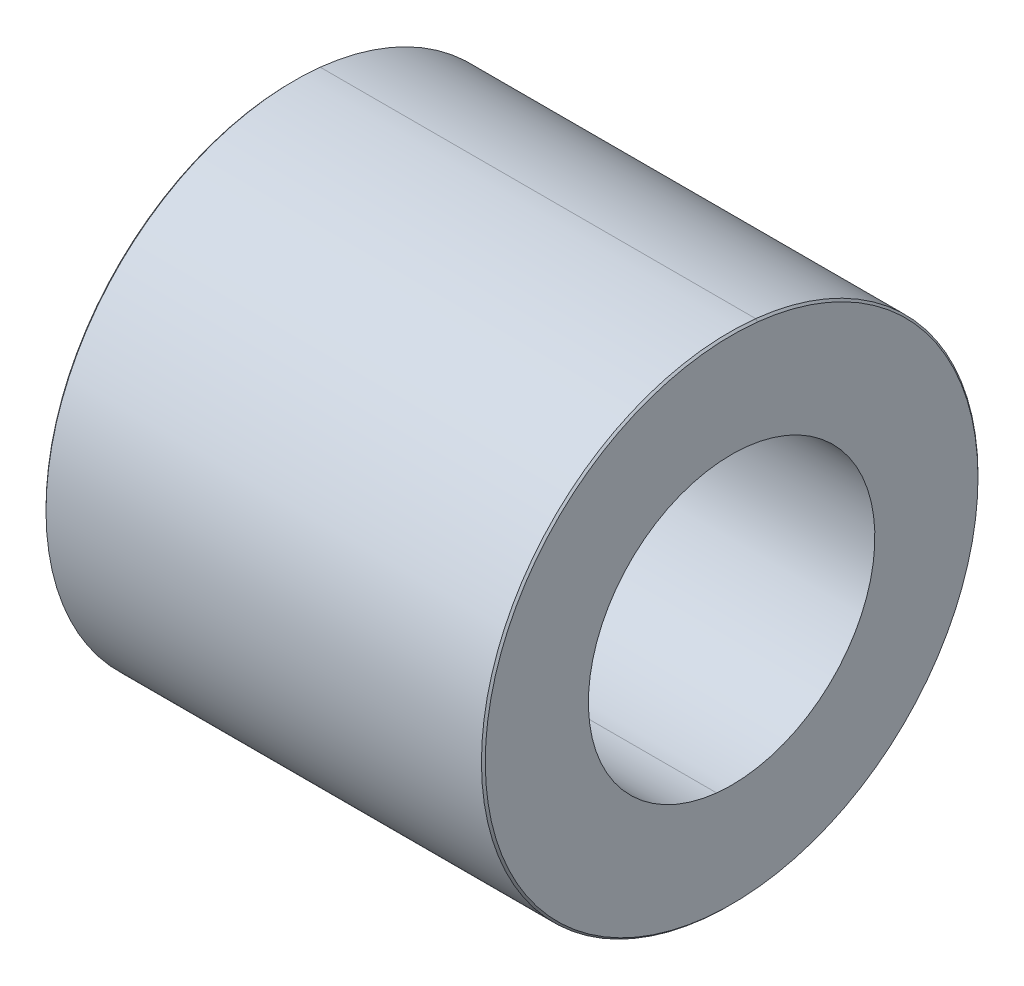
ISO-10303-21;
HEADER;
FILE_DESCRIPTION(('STEP AP214'),'2;1');
FILE_NAME('part.step','',(''),(''),'','','');
FILE_SCHEMA(('AUTOMOTIVE_DESIGN { 1 0 10303 214 1 1 1 1 }'));
ENDSEC;
DATA;
#1=APPLICATION_CONTEXT('core data for automotive mechanical design processes');
#2=APPLICATION_PROTOCOL_DEFINITION('international standard','automotive_design',2000,#1);
#3=PRODUCT_CONTEXT('',#1,'mechanical');
#4=PRODUCT('Part','Part','',(#3));
#5=PRODUCT_RELATED_PRODUCT_CATEGORY('part','',(#4));
#6=PRODUCT_DEFINITION_FORMATION('','',#4);
#7=PRODUCT_DEFINITION_CONTEXT('part definition',#1,'design');
#8=PRODUCT_DEFINITION('design','',#6,#7);
#9=PRODUCT_DEFINITION_SHAPE('','',#8);
#10=(LENGTH_UNIT() NAMED_UNIT(*) SI_UNIT(.MILLI.,.METRE.));
#11=(NAMED_UNIT(*) PLANE_ANGLE_UNIT() SI_UNIT($,.RADIAN.));
#12=(NAMED_UNIT(*) SI_UNIT($,.STERADIAN.) SOLID_ANGLE_UNIT());
#13=UNCERTAINTY_MEASURE_WITH_UNIT(LENGTH_MEASURE(1.E-05),#10,'distance_accuracy_value','');
#14=(GEOMETRIC_REPRESENTATION_CONTEXT(3) GLOBAL_UNCERTAINTY_ASSIGNED_CONTEXT((#13)) GLOBAL_UNIT_ASSIGNED_CONTEXT((#10,
#11,#12)) REPRESENTATION_CONTEXT('',''));
#15=CARTESIAN_POINT('',(0.,0.,0.));
#16=DIRECTION('',(0.,0.,1.));
#17=DIRECTION('',(1.,0.,0.));
#18=AXIS2_PLACEMENT_3D('',#15,#16,#17);
#19=CARTESIAN_POINT('',(8.45,0.,0.));
#20=DIRECTION('',(-1.,0.,0.));
#21=DIRECTION('',(0.,-0.994521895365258,0.104528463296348));
#22=AXIS2_PLACEMENT_3D('',#19,#20,#21);
#23=CYLINDRICAL_SURFACE('',#22,7.5);
#24=DIRECTION('',(-1.,0.,0.));
#25=VECTOR('',#24,1.);
#26=CARTESIAN_POINT('',(8.45,-7.45891421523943,0.783963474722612));
#27=LINE('',#26,#25);
#28=CARTESIAN_POINT('',(19.95,-7.45891421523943,0.783963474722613));
#29=VERTEX_POINT('',#28);
#30=CARTESIAN_POINT('',(-3.05,-7.45891421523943,0.783963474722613));
#31=VERTEX_POINT('',#30);
#32=EDGE_CURVE('E1335',#29,#31,#27,.T.);
#33=ORIENTED_EDGE('',*,*,#32,.F.);
#34=CARTESIAN_POINT('',(19.95,0.,0.));
#35=DIRECTION('',(-1.,0.,0.));
#36=DIRECTION('',(0.,-0.994521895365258,0.104528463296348));
#37=AXIS2_PLACEMENT_3D('',#34,#35,#36);
#38=CIRCLE('',#37,7.5);
#39=CARTESIAN_POINT('',(19.95,7.45891421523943,-0.783963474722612));
#40=VERTEX_POINT('',#39);
#41=EDGE_CURVE('E40',#40,#29,#38,.T.);
#42=ORIENTED_EDGE('',*,*,#41,.F.);
#43=DIRECTION('',(1.,0.,0.));
#44=VECTOR('',#43,1.);
#45=CARTESIAN_POINT('',(8.45,7.45891421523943,-0.783963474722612));
#46=LINE('',#45,#44);
#47=CARTESIAN_POINT('',(-3.05,7.45891421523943,-0.783963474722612));
#48=VERTEX_POINT('',#47);
#49=EDGE_CURVE('E882',#48,#40,#46,.T.);
#50=ORIENTED_EDGE('',*,*,#49,.F.);
#51=CARTESIAN_POINT('',(-3.05,0.,0.));
#52=DIRECTION('',(-1.,0.,0.));
#53=DIRECTION('',(0.,-0.994521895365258,0.104528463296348));
#54=AXIS2_PLACEMENT_3D('',#51,#52,#53);
#55=CIRCLE('',#54,7.5);
#56=EDGE_CURVE('E11',#48,#31,#55,.T.);
#57=ORIENTED_EDGE('',*,*,#56,.T.);
#58=EDGE_LOOP('',(#33,#42,#50,#57));
#59=FACE_BOUND('',#58,.T.);
#60=ADVANCED_FACE('F16',(#59),#23,.F.);
#61=CARTESIAN_POINT('',(8.45,0.,0.));
#62=DIRECTION('',(-1.,0.,0.));
#63=DIRECTION('',(0.,-0.994521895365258,0.104528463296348));
#64=AXIS2_PLACEMENT_3D('',#61,#62,#63);
#65=CYLINDRICAL_SURFACE('',#64,13.);
#66=DIRECTION('',(-1.,0.,0.));
#67=VECTOR('',#66,1.);
#68=CARTESIAN_POINT('',(8.45,-12.9287846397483,1.35887002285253));
#69=LINE('',#68,#67);
#70=CARTESIAN_POINT('',(19.85,-12.9287846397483,1.35887002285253));
#71=VERTEX_POINT('',#70);
#72=CARTESIAN_POINT('',(-2.95,-12.9287846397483,1.35887002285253));
#73=VERTEX_POINT('',#72);
#74=EDGE_CURVE('E849',#71,#73,#69,.T.);
#75=ORIENTED_EDGE('',*,*,#74,.F.);
#76=CARTESIAN_POINT('',(19.85,0.,0.));
#77=DIRECTION('',(-1.,0.,0.));
#78=DIRECTION('',(0.,-0.994521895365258,0.104528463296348));
#79=AXIS2_PLACEMENT_3D('',#76,#77,#78);
#80=CIRCLE('',#79,13.);
#81=CARTESIAN_POINT('',(19.85,12.9287846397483,-1.35887002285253));
#82=VERTEX_POINT('',#81);
#83=EDGE_CURVE('E27',#71,#82,#80,.T.);
#84=ORIENTED_EDGE('',*,*,#83,.T.);
#85=DIRECTION('',(1.,0.,0.));
#86=VECTOR('',#85,1.);
#87=CARTESIAN_POINT('',(8.45,12.9287846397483,-1.35887002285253));
#88=LINE('',#87,#86);
#89=CARTESIAN_POINT('',(-2.95,12.9287846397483,-1.35887002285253));
#90=VERTEX_POINT('',#89);
#91=EDGE_CURVE('E850',#90,#82,#88,.T.);
#92=ORIENTED_EDGE('',*,*,#91,.F.);
#93=CARTESIAN_POINT('',(-2.95,0.,0.));
#94=DIRECTION('',(1.,0.,0.));
#95=DIRECTION('',(0.,-0.994521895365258,0.104528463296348));
#96=AXIS2_PLACEMENT_3D('',#93,#94,#95);
#97=CIRCLE('',#96,13.);
#98=EDGE_CURVE('E685',#90,#73,#97,.T.);
#99=ORIENTED_EDGE('',*,*,#98,.T.);
#100=EDGE_LOOP('',(#75,#84,#92,#99));
#101=FACE_BOUND('',#100,.T.);
#102=ADVANCED_FACE('F1783',(#101),#65,.T.);
#103=CARTESIAN_POINT('',(-3.,0.,0.));
#104=DIRECTION('',(1.,0.,0.));
#105=DIRECTION('',(0.,-0.994521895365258,0.104528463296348));
#106=AXIS2_PLACEMENT_3D('',#103,#104,#105);
#107=CONICAL_SURFACE('',#106,12.95,0.785398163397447);
#108=DIRECTION('',(-0.707106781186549,0.70323317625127,-0.0739127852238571));
#109=VECTOR('',#108,1.);
#110=CARTESIAN_POINT('',(-3.,-12.8790585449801,1.35364359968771));
#111=LINE('',#110,#109);
#112=CARTESIAN_POINT('',(-3.05,-12.8293324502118,1.34841717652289));
#113=VERTEX_POINT('',#112);
#114=EDGE_CURVE('E1197',#73,#113,#111,.T.);
#115=ORIENTED_EDGE('',*,*,#114,.F.);
#116=ORIENTED_EDGE('',*,*,#98,.F.);
#117=DIRECTION('',(0.707106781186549,0.70323317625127,-0.0739127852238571));
#118=VECTOR('',#117,1.);
#119=CARTESIAN_POINT('',(-3.,12.8790585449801,-1.35364359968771));
#120=LINE('',#119,#118);
#121=CARTESIAN_POINT('',(-3.05,12.8293324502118,-1.3484171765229));
#122=VERTEX_POINT('',#121);
#123=EDGE_CURVE('E1201',#122,#90,#120,.T.);
#124=ORIENTED_EDGE('',*,*,#123,.F.);
#125=CARTESIAN_POINT('',(-3.05,0.,0.));
#126=DIRECTION('',(-1.,0.,0.));
#127=DIRECTION('',(0.,-0.994521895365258,0.104528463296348));
#128=AXIS2_PLACEMENT_3D('',#125,#126,#127);
#129=CIRCLE('',#128,12.9);
#130=EDGE_CURVE('E671',#113,#122,#129,.T.);
#131=ORIENTED_EDGE('',*,*,#130,.F.);
#132=EDGE_LOOP('',(#115,#116,#124,#131));
#133=FACE_BOUND('',#132,.T.);
#134=ADVANCED_FACE('F1790',(#133),#107,.T.);
#135=CARTESIAN_POINT('',(19.9,0.,0.));
#136=DIRECTION('',(-1.,0.,0.));
#137=DIRECTION('',(0.,-0.994521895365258,0.104528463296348));
#138=AXIS2_PLACEMENT_3D('',#135,#136,#137);
#139=CONICAL_SURFACE('',#138,12.95,0.785398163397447);
#140=DIRECTION('',(0.707106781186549,0.70323317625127,-0.0739127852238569));
#141=VECTOR('',#140,1.);
#142=CARTESIAN_POINT('',(19.9,-12.8790585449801,1.35364359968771));
#143=LINE('',#142,#141);
#144=CARTESIAN_POINT('',(19.95,-12.8293324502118,1.34841717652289));
#145=VERTEX_POINT('',#144);
#146=EDGE_CURVE('E1451',#71,#145,#143,.T.);
#147=ORIENTED_EDGE('',*,*,#146,.F.);
#148=CARTESIAN_POINT('',(19.85,0.,0.));
#149=DIRECTION('',(-1.,0.,0.));
#150=DIRECTION('',(0.,-0.994521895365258,0.104528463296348));
#151=AXIS2_PLACEMENT_3D('',#148,#149,#150);
#152=CIRCLE('',#151,13.);
#153=EDGE_CURVE('E1340',#82,#71,#152,.T.);
#154=ORIENTED_EDGE('',*,*,#153,.F.);
#155=DIRECTION('',(-0.707106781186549,0.70323317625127,-0.0739127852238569));
#156=VECTOR('',#155,1.);
#157=CARTESIAN_POINT('',(19.9,12.8790585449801,-1.35364359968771));
#158=LINE('',#157,#156);
#159=CARTESIAN_POINT('',(19.95,12.8293324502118,-1.34841717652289));
#160=VERTEX_POINT('',#159);
#161=EDGE_CURVE('E1200',#160,#82,#158,.T.);
#162=ORIENTED_EDGE('',*,*,#161,.F.);
#163=CARTESIAN_POINT('',(19.95,0.,0.));
#164=DIRECTION('',(1.,0.,0.));
#165=DIRECTION('',(0.,-0.994521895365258,0.104528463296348));
#166=AXIS2_PLACEMENT_3D('',#163,#164,#165);
#167=CIRCLE('',#166,12.9);
#168=EDGE_CURVE('E879',#145,#160,#167,.T.);
#169=ORIENTED_EDGE('',*,*,#168,.F.);
#170=EDGE_LOOP('',(#147,#154,#162,#169));
#171=FACE_BOUND('',#170,.T.);
#172=ADVANCED_FACE('F1890',(#171),#139,.T.);
#173=CARTESIAN_POINT('',(-0.89978484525,-8.7881711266,4.7715876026));
#174=DIRECTION('',(-1.,0.,0.));
#175=DIRECTION('',(0.,-0.878817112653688,0.477158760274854));
#176=AXIS2_PLACEMENT_3D('',#173,#174,#175);
#177=CONICAL_SURFACE('',#176,0.25,1.0297442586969);
#178=DIRECTION('',(0.515038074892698,-0.75329329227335,0.40900488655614));
#179=VECTOR('',#178,1.);
#180=CARTESIAN_POINT('',(-0.89978484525,-8.56846684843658,4.65229791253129));
#181=LINE('',#180,#179);
#182=CARTESIAN_POINT('',(-1.05,-8.34876257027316,4.53300822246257));
#183=VERTEX_POINT('',#182);
#184=CARTESIAN_POINT('',(-0.7495696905,-8.7881711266,4.7715876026));
#185=VERTEX_POINT('',#184);
#186=EDGE_CURVE('E661',#183,#185,#181,.T.);
#187=ORIENTED_EDGE('',*,*,#186,.T.);
#188=DIRECTION('',(-0.515038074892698,-0.75329329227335,0.40900488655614));
#189=VECTOR('',#188,1.);
#190=CARTESIAN_POINT('',(-0.89978484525,-9.00787540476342,4.89087729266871));
#191=LINE('',#190,#189);
#192=CARTESIAN_POINT('',(-1.05,-9.22757968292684,5.01016698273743));
#193=VERTEX_POINT('',#192);
#194=EDGE_CURVE('E663',#185,#193,#191,.T.);
#195=ORIENTED_EDGE('',*,*,#194,.T.);
#196=CARTESIAN_POINT('',(-1.05,-8.7881711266,4.7715876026));
#197=DIRECTION('',(1.,0.,0.));
#198=DIRECTION('',(0.,-0.878817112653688,0.477158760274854));
#199=AXIS2_PLACEMENT_3D('',#196,#197,#198);
#200=CIRCLE('',#199,0.5);
#201=EDGE_CURVE('E657',#183,#193,#200,.T.);
#202=ORIENTED_EDGE('',*,*,#201,.F.);
#203=EDGE_LOOP('',(#187,#195,#202));
#204=FACE_BOUND('',#203,.T.);
#205=ADVANCED_FACE('F659',(#204),#177,.F.);
#206=CARTESIAN_POINT('',(-2.05,-8.7881711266,4.7715876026));
#207=DIRECTION('',(1.,0.,0.));
#208=DIRECTION('',(0.,-0.878817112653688,0.477158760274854));
#209=AXIS2_PLACEMENT_3D('',#206,#207,#208);
#210=CYLINDRICAL_SURFACE('',#209,0.5);
#211=DIRECTION('',(-1.,0.,0.));
#212=VECTOR('',#211,1.);
#213=CARTESIAN_POINT('',(-2.05,-9.22757968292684,5.01016698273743));
#214=LINE('',#213,#212);
#215=CARTESIAN_POINT('',(-3.05,-9.22757968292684,5.01016698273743));
#216=VERTEX_POINT('',#215);
#217=EDGE_CURVE('E678',#193,#216,#214,.T.);
#218=ORIENTED_EDGE('',*,*,#217,.F.);
#219=CARTESIAN_POINT('',(-1.05,-8.7881711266,4.7715876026));
#220=DIRECTION('',(1.,0.,0.));
#221=DIRECTION('',(0.,-0.878817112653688,0.477158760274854));
#222=AXIS2_PLACEMENT_3D('',#219,#220,#221);
#223=CIRCLE('',#222,0.5);
#224=EDGE_CURVE('E675',#193,#183,#223,.T.);
#225=ORIENTED_EDGE('',*,*,#224,.T.);
#226=DIRECTION('',(1.,0.,0.));
#227=VECTOR('',#226,1.);
#228=CARTESIAN_POINT('',(-2.05,-8.34876257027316,4.53300822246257));
#229=LINE('',#228,#227);
#230=CARTESIAN_POINT('',(-3.05,-8.34876257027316,4.53300822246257));
#231=VERTEX_POINT('',#230);
#232=EDGE_CURVE('E670',#231,#183,#229,.T.);
#233=ORIENTED_EDGE('',*,*,#232,.F.);
#234=CARTESIAN_POINT('',(-3.05,-8.7881711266,4.7715876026));
#235=DIRECTION('',(1.,0.,0.));
#236=DIRECTION('',(0.,-0.878817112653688,0.477158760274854));
#237=AXIS2_PLACEMENT_3D('',#234,#235,#236);
#238=CIRCLE('',#237,0.5);
#239=EDGE_CURVE('E1083',#216,#231,#238,.T.);
#240=ORIENTED_EDGE('',*,*,#239,.F.);
#241=EDGE_LOOP('',(#218,#225,#233,#240));
#242=FACE_BOUND('',#241,.T.);
#243=ADVANCED_FACE('F676',(#242),#210,.F.);
#244=CARTESIAN_POINT('',(-2.675,9.9452189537,-1.0452846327));
#245=DIRECTION('',(1.,0.,0.));
#246=DIRECTION('',(0.,0.994521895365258,-0.104528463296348));
#247=AXIS2_PLACEMENT_3D('',#244,#245,#246);
#248=CONICAL_SURFACE('',#247,1.2835,1.04718484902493);
#249=DIRECTION('',(-0.500011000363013,-0.861274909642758,0.0905236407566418));
#250=VECTOR('',#249,1.);
#251=CARTESIAN_POINT('',(-2.675,11.2216878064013,-1.17944691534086));
#252=LINE('',#251,#250);
#253=CARTESIAN_POINT('',(-2.55,11.4370017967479,-1.20207732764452));
#254=VERTEX_POINT('',#253);
#255=CARTESIAN_POINT('',(-2.8,11.0063738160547,-1.1568165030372));
#256=VERTEX_POINT('',#255);
#257=EDGE_CURVE('E795',#254,#256,#252,.T.);
#258=ORIENTED_EDGE('',*,*,#257,.F.);
#259=CARTESIAN_POINT('',(-2.55,9.9452189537,-1.0452846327));
#260=DIRECTION('',(1.,0.,0.));
#261=DIRECTION('',(0.,0.994521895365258,-0.104528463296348));
#262=AXIS2_PLACEMENT_3D('',#259,#260,#261);
#263=CIRCLE('',#262,1.5);
#264=CARTESIAN_POINT('',(-2.55,8.45343611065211,-0.888491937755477));
#265=VERTEX_POINT('',#264);
#266=EDGE_CURVE('E681',#254,#265,#263,.T.);
#267=ORIENTED_EDGE('',*,*,#266,.T.);
#268=DIRECTION('',(0.500011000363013,-0.861274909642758,0.0905236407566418));
#269=VECTOR('',#268,1.);
#270=CARTESIAN_POINT('',(-2.675,8.66875010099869,-0.911122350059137));
#271=LINE('',#270,#269);
#272=CARTESIAN_POINT('',(-2.8,8.88406409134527,-0.933752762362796));
#273=VERTEX_POINT('',#272);
#274=EDGE_CURVE('E792',#273,#265,#271,.T.);
#275=ORIENTED_EDGE('',*,*,#274,.F.);
#276=CARTESIAN_POINT('',(-2.8,9.9452189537,-1.0452846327));
#277=DIRECTION('',(1.,0.,0.));
#278=DIRECTION('',(0.,0.994521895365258,-0.104528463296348));
#279=AXIS2_PLACEMENT_3D('',#276,#277,#278);
#280=CIRCLE('',#279,1.067);
#281=EDGE_CURVE('E730',#256,#273,#280,.T.);
#282=ORIENTED_EDGE('',*,*,#281,.F.);
#283=EDGE_LOOP('',(#258,#267,#275,#282));
#284=FACE_BOUND('',#283,.T.);
#285=ADVANCED_FACE('F1962',(#284),#248,.F.);
#286=CARTESIAN_POINT('',(-2.925,9.9452189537,-1.0452846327));
#287=DIRECTION('',(-1.,0.,0.));
#288=DIRECTION('',(0.,0.994521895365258,-0.104528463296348));
#289=AXIS2_PLACEMENT_3D('',#286,#287,#288);
#290=CONICAL_SURFACE('',#289,1.2835,1.04718484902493);
#291=DIRECTION('',(-0.500011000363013,0.861274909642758,-0.0905236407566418));
#292=VECTOR('',#291,1.);
#293=CARTESIAN_POINT('',(-2.925,11.2216878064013,-1.17944691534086));
#294=LINE('',#293,#292);
#295=CARTESIAN_POINT('',(-3.05,11.4370017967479,-1.20207732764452));
#296=VERTEX_POINT('',#295);
#297=EDGE_CURVE('E891',#256,#296,#294,.T.);
#298=ORIENTED_EDGE('',*,*,#297,.F.);
#299=ORIENTED_EDGE('',*,*,#281,.T.);
#300=DIRECTION('',(0.500011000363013,0.861274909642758,-0.0905236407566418));
#301=VECTOR('',#300,1.);
#302=CARTESIAN_POINT('',(-2.925,8.66875010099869,-0.911122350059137));
#303=LINE('',#302,#301);
#304=CARTESIAN_POINT('',(-3.05,8.45343611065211,-0.888491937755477));
#305=VERTEX_POINT('',#304);
#306=EDGE_CURVE('E895',#305,#273,#303,.T.);
#307=ORIENTED_EDGE('',*,*,#306,.F.);
#308=CARTESIAN_POINT('',(-3.05,9.9452189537,-1.0452846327));
#309=DIRECTION('',(1.,0.,0.));
#310=DIRECTION('',(0.,0.994521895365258,-0.104528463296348));
#311=AXIS2_PLACEMENT_3D('',#308,#309,#310);
#312=CIRCLE('',#311,1.5);
#313=EDGE_CURVE('E1213',#296,#305,#312,.T.);
#314=ORIENTED_EDGE('',*,*,#313,.F.);
#315=EDGE_LOOP('',(#298,#299,#307,#314));
#316=FACE_BOUND('',#315,.T.);
#317=ADVANCED_FACE('F1958',(#316),#290,.F.);
#318=CARTESIAN_POINT('',(-2.175,9.9452189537,-1.0452846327));
#319=DIRECTION('',(1.,0.,0.));
#320=DIRECTION('',(0.,0.994521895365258,-0.104528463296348));
#321=AXIS2_PLACEMENT_3D('',#318,#319,#320);
#322=CONICAL_SURFACE('',#321,1.2835,1.04718484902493);
#323=DIRECTION('',(-0.500011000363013,-0.861274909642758,0.0905236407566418));
#324=VECTOR('',#323,1.);
#325=CARTESIAN_POINT('',(-2.175,11.2216878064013,-1.17944691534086));
#326=LINE('',#325,#324);
#327=CARTESIAN_POINT('',(-2.05,11.4370017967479,-1.20207732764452));
#328=VERTEX_POINT('',#327);
#329=CARTESIAN_POINT('',(-2.3,11.0063738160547,-1.1568165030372));
#330=VERTEX_POINT('',#329);
#331=EDGE_CURVE('E815',#328,#330,#326,.T.);
#332=ORIENTED_EDGE('',*,*,#331,.F.);
#333=CARTESIAN_POINT('',(-2.05,9.9452189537,-1.0452846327));
#334=DIRECTION('',(1.,0.,0.));
#335=DIRECTION('',(0.,0.994521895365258,-0.104528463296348));
#336=AXIS2_PLACEMENT_3D('',#333,#334,#335);
#337=CIRCLE('',#336,1.5);
#338=CARTESIAN_POINT('',(-2.05,8.45343611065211,-0.888491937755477));
#339=VERTEX_POINT('',#338);
#340=EDGE_CURVE('E734',#328,#339,#337,.T.);
#341=ORIENTED_EDGE('',*,*,#340,.T.);
#342=DIRECTION('',(0.500011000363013,-0.861274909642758,0.0905236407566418));
#343=VECTOR('',#342,1.);
#344=CARTESIAN_POINT('',(-2.175,8.66875010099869,-0.911122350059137));
#345=LINE('',#344,#343);
#346=CARTESIAN_POINT('',(-2.3,8.88406409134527,-0.933752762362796));
#347=VERTEX_POINT('',#346);
#348=EDGE_CURVE('E812',#347,#339,#345,.T.);
#349=ORIENTED_EDGE('',*,*,#348,.F.);
#350=CARTESIAN_POINT('',(-2.3,9.9452189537,-1.0452846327));
#351=DIRECTION('',(1.,0.,0.));
#352=DIRECTION('',(0.,0.994521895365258,-0.104528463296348));
#353=AXIS2_PLACEMENT_3D('',#350,#351,#352);
#354=CIRCLE('',#353,1.067);
#355=EDGE_CURVE('E936',#330,#347,#354,.T.);
#356=ORIENTED_EDGE('',*,*,#355,.F.);
#357=EDGE_LOOP('',(#332,#341,#349,#356));
#358=FACE_BOUND('',#357,.T.);
#359=ADVANCED_FACE('F1961',(#358),#322,.F.);
#360=CARTESIAN_POINT('',(-2.425,9.9452189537,-1.0452846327));
#361=DIRECTION('',(-1.,0.,0.));
#362=DIRECTION('',(0.,0.994521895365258,-0.104528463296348));
#363=AXIS2_PLACEMENT_3D('',#360,#361,#362);
#364=CONICAL_SURFACE('',#363,1.2835,1.04718484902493);
#365=DIRECTION('',(-0.500011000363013,0.861274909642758,-0.0905236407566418));
#366=VECTOR('',#365,1.);
#367=CARTESIAN_POINT('',(-2.425,11.2216878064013,-1.17944691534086));
#368=LINE('',#367,#366);
#369=EDGE_CURVE('E871',#330,#254,#368,.T.);
#370=ORIENTED_EDGE('',*,*,#369,.F.);
#371=ORIENTED_EDGE('',*,*,#355,.T.);
#372=DIRECTION('',(0.500011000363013,0.861274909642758,-0.0905236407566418));
#373=VECTOR('',#372,1.);
#374=CARTESIAN_POINT('',(-2.425,8.66875010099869,-0.911122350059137));
#375=LINE('',#374,#373);
#376=EDGE_CURVE('E867',#265,#347,#375,.T.);
#377=ORIENTED_EDGE('',*,*,#376,.F.);
#378=ORIENTED_EDGE('',*,*,#266,.F.);
#379=EDGE_LOOP('',(#370,#371,#377,#378));
#380=FACE_BOUND('',#379,.T.);
#381=ADVANCED_FACE('F2054',(#380),#364,.F.);
#382=CARTESIAN_POINT('',(-1.675,9.9452189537,-1.0452846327));
#383=DIRECTION('',(1.,0.,0.));
#384=DIRECTION('',(0.,0.994521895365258,-0.104528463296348));
#385=AXIS2_PLACEMENT_3D('',#382,#383,#384);
#386=CONICAL_SURFACE('',#385,1.2835,1.04718484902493);
#387=DIRECTION('',(-0.500011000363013,-0.861274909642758,0.0905236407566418));
#388=VECTOR('',#387,1.);
#389=CARTESIAN_POINT('',(-1.675,11.2216878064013,-1.17944691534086));
#390=LINE('',#389,#388);
#391=CARTESIAN_POINT('',(-1.55,11.4370017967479,-1.20207732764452));
#392=VERTEX_POINT('',#391);
#393=CARTESIAN_POINT('',(-1.8,11.0063738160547,-1.1568165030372));
#394=VERTEX_POINT('',#393);
#395=EDGE_CURVE('E1000',#392,#394,#390,.T.);
#396=ORIENTED_EDGE('',*,*,#395,.F.);
#397=CARTESIAN_POINT('',(-1.55,9.9452189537,-1.0452846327));
#398=DIRECTION('',(1.,0.,0.));
#399=DIRECTION('',(0.,0.994521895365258,-0.104528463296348));
#400=AXIS2_PLACEMENT_3D('',#397,#398,#399);
#401=CIRCLE('',#400,1.5);
#402=CARTESIAN_POINT('',(-1.55,8.45343611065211,-0.888491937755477));
#403=VERTEX_POINT('',#402);
#404=EDGE_CURVE('E940',#392,#403,#401,.T.);
#405=ORIENTED_EDGE('',*,*,#404,.T.);
#406=DIRECTION('',(0.500011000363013,-0.861274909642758,0.0905236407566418));
#407=VECTOR('',#406,1.);
#408=CARTESIAN_POINT('',(-1.675,8.66875010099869,-0.911122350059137));
#409=LINE('',#408,#407);
#410=CARTESIAN_POINT('',(-1.8,8.88406409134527,-0.933752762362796));
#411=VERTEX_POINT('',#410);
#412=EDGE_CURVE('E1191',#411,#403,#409,.T.);
#413=ORIENTED_EDGE('',*,*,#412,.F.);
#414=CARTESIAN_POINT('',(-1.8,9.9452189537,-1.0452846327));
#415=DIRECTION('',(1.,0.,0.));
#416=DIRECTION('',(0.,0.994521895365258,-0.104528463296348));
#417=AXIS2_PLACEMENT_3D('',#414,#415,#416);
#418=CIRCLE('',#417,1.067);
#419=EDGE_CURVE('E1475',#394,#411,#418,.T.);
#420=ORIENTED_EDGE('',*,*,#419,.F.);
#421=EDGE_LOOP('',(#396,#405,#413,#420));
#422=FACE_BOUND('',#421,.T.);
#423=ADVANCED_FACE('F1974',(#422),#386,.F.);
#424=CARTESIAN_POINT('',(-1.925,9.9452189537,-1.0452846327));
#425=DIRECTION('',(-1.,0.,0.));
#426=DIRECTION('',(0.,0.994521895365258,-0.104528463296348));
#427=AXIS2_PLACEMENT_3D('',#424,#425,#426);
#428=CONICAL_SURFACE('',#427,1.2835,1.04718484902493);
#429=DIRECTION('',(-0.500011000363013,0.861274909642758,-0.0905236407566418));
#430=VECTOR('',#429,1.);
#431=CARTESIAN_POINT('',(-1.925,11.2216878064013,-1.17944691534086));
#432=LINE('',#431,#430);
#433=EDGE_CURVE('E1192',#394,#328,#432,.T.);
#434=ORIENTED_EDGE('',*,*,#433,.F.);
#435=ORIENTED_EDGE('',*,*,#419,.T.);
#436=DIRECTION('',(0.500011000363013,0.861274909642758,-0.0905236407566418));
#437=VECTOR('',#436,1.);
#438=CARTESIAN_POINT('',(-1.925,8.66875010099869,-0.911122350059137));
#439=LINE('',#438,#437);
#440=EDGE_CURVE('E999',#339,#411,#439,.T.);
#441=ORIENTED_EDGE('',*,*,#440,.F.);
#442=ORIENTED_EDGE('',*,*,#340,.F.);
#443=EDGE_LOOP('',(#434,#435,#441,#442));
#444=FACE_BOUND('',#443,.T.);
#445=ADVANCED_FACE('F1970',(#444),#428,.F.);
#446=CARTESIAN_POINT('',(-1.175,9.9452189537,-1.0452846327));
#447=DIRECTION('',(1.,0.,0.));
#448=DIRECTION('',(0.,0.994521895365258,-0.104528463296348));
#449=AXIS2_PLACEMENT_3D('',#446,#447,#448);
#450=CONICAL_SURFACE('',#449,1.2835,1.04718484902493);
#451=DIRECTION('',(-0.500011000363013,-0.861274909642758,0.0905236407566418));
#452=VECTOR('',#451,1.);
#453=CARTESIAN_POINT('',(-1.175,11.2216878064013,-1.17944691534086));
#454=LINE('',#453,#452);
#455=CARTESIAN_POINT('',(-1.05,11.4370017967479,-1.20207732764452));
#456=VERTEX_POINT('',#455);
#457=CARTESIAN_POINT('',(-1.3,11.0063738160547,-1.1568165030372));
#458=VERTEX_POINT('',#457);
#459=EDGE_CURVE('E1102',#456,#458,#454,.T.);
#460=ORIENTED_EDGE('',*,*,#459,.F.);
#461=CARTESIAN_POINT('',(-1.05,9.9452189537,-1.0452846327));
#462=DIRECTION('',(1.,0.,0.));
#463=DIRECTION('',(0.,0.994521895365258,-0.104528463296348));
#464=AXIS2_PLACEMENT_3D('',#461,#462,#463);
#465=CIRCLE('',#464,1.5);
#466=CARTESIAN_POINT('',(-1.05,8.45343611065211,-0.888491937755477));
#467=VERTEX_POINT('',#466);
#468=EDGE_CURVE('E1550',#456,#467,#465,.T.);
#469=ORIENTED_EDGE('',*,*,#468,.T.);
#470=DIRECTION('',(0.500011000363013,-0.861274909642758,0.0905236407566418));
#471=VECTOR('',#470,1.);
#472=CARTESIAN_POINT('',(-1.175,8.66875010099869,-0.911122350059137));
#473=LINE('',#472,#471);
#474=CARTESIAN_POINT('',(-1.3,8.88406409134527,-0.933752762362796));
#475=VERTEX_POINT('',#474);
#476=EDGE_CURVE('E1106',#475,#467,#473,.T.);
#477=ORIENTED_EDGE('',*,*,#476,.F.);
#478=CARTESIAN_POINT('',(-1.3,9.9452189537,-1.0452846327));
#479=DIRECTION('',(1.,0.,0.));
#480=DIRECTION('',(0.,0.994521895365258,-0.104528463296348));
#481=AXIS2_PLACEMENT_3D('',#478,#479,#480);
#482=CIRCLE('',#481,1.067);
#483=EDGE_CURVE('E1040',#458,#475,#482,.T.);
#484=ORIENTED_EDGE('',*,*,#483,.F.);
#485=EDGE_LOOP('',(#460,#469,#477,#484));
#486=FACE_BOUND('',#485,.T.);
#487=ADVANCED_FACE('F1973',(#486),#450,.F.);
#488=CARTESIAN_POINT('',(-1.425,9.9452189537,-1.0452846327));
#489=DIRECTION('',(-1.,0.,0.));
#490=DIRECTION('',(0.,0.994521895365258,-0.104528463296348));
#491=AXIS2_PLACEMENT_3D('',#488,#489,#490);
#492=CONICAL_SURFACE('',#491,1.2835,1.04718484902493);
#493=DIRECTION('',(-0.500011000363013,0.861274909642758,-0.0905236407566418));
#494=VECTOR('',#493,1.);
#495=CARTESIAN_POINT('',(-1.425,11.2216878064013,-1.17944691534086));
#496=LINE('',#495,#494);
#497=EDGE_CURVE('E930',#458,#392,#496,.T.);
#498=ORIENTED_EDGE('',*,*,#497,.F.);
#499=ORIENTED_EDGE('',*,*,#483,.T.);
#500=DIRECTION('',(0.500011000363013,0.861274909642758,-0.0905236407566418));
#501=VECTOR('',#500,1.);
#502=CARTESIAN_POINT('',(-1.425,8.66875010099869,-0.911122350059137));
#503=LINE('',#502,#501);
#504=EDGE_CURVE('E935',#403,#475,#503,.T.);
#505=ORIENTED_EDGE('',*,*,#504,.F.);
#506=ORIENTED_EDGE('',*,*,#404,.F.);
#507=EDGE_LOOP('',(#498,#499,#505,#506));
#508=FACE_BOUND('',#507,.T.);
#509=ADVANCED_FACE('F2035',(#508),#492,.F.);
#510=CARTESIAN_POINT('',(-0.675,9.9452189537,-1.0452846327));
#511=DIRECTION('',(1.,0.,0.));
#512=DIRECTION('',(0.,0.994521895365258,-0.104528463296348));
#513=AXIS2_PLACEMENT_3D('',#510,#511,#512);
#514=CONICAL_SURFACE('',#513,1.2835,1.04718484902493);
#515=DIRECTION('',(-0.500011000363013,-0.861274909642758,0.0905236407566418));
#516=VECTOR('',#515,1.);
#517=CARTESIAN_POINT('',(-0.675,11.2216878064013,-1.17944691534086));
#518=LINE('',#517,#516);
#519=CARTESIAN_POINT('',(-0.55,11.4370017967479,-1.20207732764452));
#520=VERTEX_POINT('',#519);
#521=CARTESIAN_POINT('',(-0.8,11.0063738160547,-1.1568165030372));
#522=VERTEX_POINT('',#521);
#523=EDGE_CURVE('E817',#520,#522,#518,.T.);
#524=ORIENTED_EDGE('',*,*,#523,.F.);
#525=CARTESIAN_POINT('',(-0.55,9.9452189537,-1.0452846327));
#526=DIRECTION('',(1.,0.,0.));
#527=DIRECTION('',(0.,0.994521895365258,-0.104528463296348));
#528=AXIS2_PLACEMENT_3D('',#525,#526,#527);
#529=CIRCLE('',#528,1.5);
#530=CARTESIAN_POINT('',(-0.55,8.45343611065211,-0.888491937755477));
#531=VERTEX_POINT('',#530);
#532=EDGE_CURVE('E1036',#520,#531,#529,.T.);
#533=ORIENTED_EDGE('',*,*,#532,.T.);
#534=DIRECTION('',(0.500011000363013,-0.861274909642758,0.0905236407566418));
#535=VECTOR('',#534,1.);
#536=CARTESIAN_POINT('',(-0.675,8.66875010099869,-0.911122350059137));
#537=LINE('',#536,#535);
#538=CARTESIAN_POINT('',(-0.8,8.88406409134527,-0.933752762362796));
#539=VERTEX_POINT('',#538);
#540=EDGE_CURVE('E821',#539,#531,#537,.T.);
#541=ORIENTED_EDGE('',*,*,#540,.F.);
#542=CARTESIAN_POINT('',(-0.8,9.9452189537,-1.0452846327));
#543=DIRECTION('',(1.,0.,0.));
#544=DIRECTION('',(0.,0.994521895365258,-0.104528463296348));
#545=AXIS2_PLACEMENT_3D('',#542,#543,#544);
#546=CIRCLE('',#545,1.067);
#547=EDGE_CURVE('E1041',#522,#539,#546,.T.);
#548=ORIENTED_EDGE('',*,*,#547,.F.);
#549=EDGE_LOOP('',(#524,#533,#541,#548));
#550=FACE_BOUND('',#549,.T.);
#551=ADVANCED_FACE('F1993',(#550),#514,.F.);
#552=CARTESIAN_POINT('',(-0.925,9.9452189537,-1.0452846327));
#553=DIRECTION('',(-1.,0.,0.));
#554=DIRECTION('',(0.,0.994521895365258,-0.104528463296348));
#555=AXIS2_PLACEMENT_3D('',#552,#553,#554);
#556=CONICAL_SURFACE('',#555,1.2835,1.04718484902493);
#557=DIRECTION('',(-0.500011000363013,0.861274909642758,-0.0905236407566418));
#558=VECTOR('',#557,1.);
#559=CARTESIAN_POINT('',(-0.925,11.2216878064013,-1.17944691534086));
#560=LINE('',#559,#558);
#561=EDGE_CURVE('E713',#522,#456,#560,.T.);
#562=ORIENTED_EDGE('',*,*,#561,.F.);
#563=ORIENTED_EDGE('',*,*,#547,.T.);
#564=DIRECTION('',(0.500011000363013,0.861274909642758,-0.0905236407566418));
#565=VECTOR('',#564,1.);
#566=CARTESIAN_POINT('',(-0.925,8.66875010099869,-0.911122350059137));
#567=LINE('',#566,#565);
#568=EDGE_CURVE('E1312',#467,#539,#567,.T.);
#569=ORIENTED_EDGE('',*,*,#568,.F.);
#570=ORIENTED_EDGE('',*,*,#468,.F.);
#571=EDGE_LOOP('',(#562,#563,#569,#570));
#572=FACE_BOUND('',#571,.T.);
#573=ADVANCED_FACE('F1989',(#572),#556,.F.);
#574=CARTESIAN_POINT('',(-0.175,9.9452189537,-1.0452846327));
#575=DIRECTION('',(1.,0.,0.));
#576=DIRECTION('',(0.,0.994521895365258,-0.104528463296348));
#577=AXIS2_PLACEMENT_3D('',#574,#575,#576);
#578=CONICAL_SURFACE('',#577,1.2835,1.04718484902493);
#579=DIRECTION('',(-0.500011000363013,-0.861274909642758,0.0905236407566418));
#580=VECTOR('',#579,1.);
#581=CARTESIAN_POINT('',(-0.175,11.2216878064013,-1.17944691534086));
#582=LINE('',#581,#580);
#583=CARTESIAN_POINT('',(-0.05,11.4370017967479,-1.20207732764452));
#584=VERTEX_POINT('',#583);
#585=CARTESIAN_POINT('',(-0.3,11.0063738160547,-1.1568165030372));
#586=VERTEX_POINT('',#585);
#587=EDGE_CURVE('E707',#584,#586,#582,.T.);
#588=ORIENTED_EDGE('',*,*,#587,.F.);
#589=CARTESIAN_POINT('',(-0.05,9.9452189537,-1.0452846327));
#590=DIRECTION('',(1.,0.,0.));
#591=DIRECTION('',(0.,0.994521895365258,-0.104528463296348));
#592=AXIS2_PLACEMENT_3D('',#589,#590,#591);
#593=CIRCLE('',#592,1.5);
#594=CARTESIAN_POINT('',(-0.05,8.45343611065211,-0.888491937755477));
#595=VERTEX_POINT('',#594);
#596=EDGE_CURVE('E1159',#584,#595,#593,.T.);
#597=ORIENTED_EDGE('',*,*,#596,.T.);
#598=DIRECTION('',(0.500011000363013,-0.861274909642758,0.0905236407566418));
#599=VECTOR('',#598,1.);
#600=CARTESIAN_POINT('',(-0.175,8.66875010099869,-0.911122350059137));
#601=LINE('',#600,#599);
#602=CARTESIAN_POINT('',(-0.3,8.88406409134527,-0.933752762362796));
#603=VERTEX_POINT('',#602);
#604=EDGE_CURVE('E712',#603,#595,#601,.T.);
#605=ORIENTED_EDGE('',*,*,#604,.F.);
#606=CARTESIAN_POINT('',(-0.3,9.9452189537,-1.0452846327));
#607=DIRECTION('',(1.,0.,0.));
#608=DIRECTION('',(0.,0.994521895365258,-0.104528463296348));
#609=AXIS2_PLACEMENT_3D('',#606,#607,#608);
#610=CIRCLE('',#609,1.067);
#611=EDGE_CURVE('E738',#586,#603,#610,.T.);
#612=ORIENTED_EDGE('',*,*,#611,.F.);
#613=EDGE_LOOP('',(#588,#597,#605,#612));
#614=FACE_BOUND('',#613,.T.);
#615=ADVANCED_FACE('F1992',(#614),#578,.F.);
#616=CARTESIAN_POINT('',(-0.425,9.9452189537,-1.0452846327));
#617=DIRECTION('',(-1.,0.,0.));
#618=DIRECTION('',(0.,0.994521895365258,-0.104528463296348));
#619=AXIS2_PLACEMENT_3D('',#616,#617,#618);
#620=CONICAL_SURFACE('',#619,1.2835,1.04718484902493);
#621=DIRECTION('',(-0.500011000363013,0.861274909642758,-0.0905236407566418));
#622=VECTOR('',#621,1.);
#623=CARTESIAN_POINT('',(-0.425,11.2216878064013,-1.17944691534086));
#624=LINE('',#623,#622);
#625=EDGE_CURVE('E1062',#586,#520,#624,.T.);
#626=ORIENTED_EDGE('',*,*,#625,.F.);
#627=ORIENTED_EDGE('',*,*,#611,.T.);
#628=DIRECTION('',(0.500011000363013,0.861274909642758,-0.0905236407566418));
#629=VECTOR('',#628,1.);
#630=CARTESIAN_POINT('',(-0.425,8.66875010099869,-0.911122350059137));
#631=LINE('',#630,#629);
#632=EDGE_CURVE('E706',#531,#603,#631,.T.);
#633=ORIENTED_EDGE('',*,*,#632,.F.);
#634=ORIENTED_EDGE('',*,*,#532,.F.);
#635=EDGE_LOOP('',(#626,#627,#633,#634));
#636=FACE_BOUND('',#635,.T.);
#637=ADVANCED_FACE('F2015',(#636),#620,.F.);
#638=CARTESIAN_POINT('',(0.325,9.9452189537,-1.0452846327));
#639=DIRECTION('',(1.,0.,0.));
#640=DIRECTION('',(0.,0.994521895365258,-0.104528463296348));
#641=AXIS2_PLACEMENT_3D('',#638,#639,#640);
#642=CONICAL_SURFACE('',#641,1.2835,1.04718484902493);
#643=DIRECTION('',(-0.500011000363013,-0.861274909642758,0.0905236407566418));
#644=VECTOR('',#643,1.);
#645=CARTESIAN_POINT('',(0.325,11.2216878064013,-1.17944691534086));
#646=LINE('',#645,#644);
#647=CARTESIAN_POINT('',(0.45,11.4370017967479,-1.20207732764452));
#648=VERTEX_POINT('',#647);
#649=CARTESIAN_POINT('',(0.2,11.0063738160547,-1.1568165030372));
#650=VERTEX_POINT('',#649);
#651=EDGE_CURVE('E1401',#648,#650,#646,.T.);
#652=ORIENTED_EDGE('',*,*,#651,.F.);
#653=CARTESIAN_POINT('',(0.45,9.9452189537,-1.0452846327));
#654=DIRECTION('',(1.,0.,0.));
#655=DIRECTION('',(0.,0.994521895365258,-0.104528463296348));
#656=AXIS2_PLACEMENT_3D('',#653,#654,#655);
#657=CIRCLE('',#656,1.5);
#658=CARTESIAN_POINT('',(0.45,8.45343611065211,-0.888491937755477));
#659=VERTEX_POINT('',#658);
#660=EDGE_CURVE('E735',#648,#659,#657,.T.);
#661=ORIENTED_EDGE('',*,*,#660,.T.);
#662=DIRECTION('',(0.500011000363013,-0.861274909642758,0.0905236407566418));
#663=VECTOR('',#662,1.);
#664=CARTESIAN_POINT('',(0.325,8.66875010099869,-0.911122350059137));
#665=LINE('',#664,#663);
#666=CARTESIAN_POINT('',(0.2,8.88406409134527,-0.933752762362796));
#667=VERTEX_POINT('',#666);
#668=EDGE_CURVE('E1061',#667,#659,#665,.T.);
#669=ORIENTED_EDGE('',*,*,#668,.F.);
#670=CARTESIAN_POINT('',(0.2,9.9452189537,-1.0452846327));
#671=DIRECTION('',(1.,0.,0.));
#672=DIRECTION('',(0.,0.994521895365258,-0.104528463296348));
#673=AXIS2_PLACEMENT_3D('',#670,#671,#672);
#674=CIRCLE('',#673,1.067);
#675=EDGE_CURVE('E739',#650,#667,#674,.T.);
#676=ORIENTED_EDGE('',*,*,#675,.F.);
#677=EDGE_LOOP('',(#652,#661,#669,#676));
#678=FACE_BOUND('',#677,.T.);
#679=ADVANCED_FACE('F3740',(#678),#642,.F.);
#680=CARTESIAN_POINT('',(0.075,9.9452189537,-1.0452846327));
#681=DIRECTION('',(-1.,0.,0.));
#682=DIRECTION('',(0.,0.994521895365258,-0.104528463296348));
#683=AXIS2_PLACEMENT_3D('',#680,#681,#682);
#684=CONICAL_SURFACE('',#683,1.2835,1.04718484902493);
#685=DIRECTION('',(-0.500011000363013,0.861274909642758,-0.0905236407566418));
#686=VECTOR('',#685,1.);
#687=CARTESIAN_POINT('',(0.075,11.2216878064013,-1.17944691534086));
#688=LINE('',#687,#686);
#689=EDGE_CURVE('E827',#650,#584,#688,.T.);
#690=ORIENTED_EDGE('',*,*,#689,.F.);
#691=ORIENTED_EDGE('',*,*,#675,.T.);
#692=DIRECTION('',(0.500011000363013,0.861274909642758,-0.0905236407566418));
#693=VECTOR('',#692,1.);
#694=CARTESIAN_POINT('',(0.075,8.66875010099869,-0.911122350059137));
#695=LINE('',#694,#693);
#696=EDGE_CURVE('E832',#595,#667,#695,.T.);
#697=ORIENTED_EDGE('',*,*,#696,.F.);
#698=ORIENTED_EDGE('',*,*,#596,.F.);
#699=EDGE_LOOP('',(#690,#691,#697,#698));
#700=FACE_BOUND('',#699,.T.);
#701=ADVANCED_FACE('F3735',(#700),#684,.F.);
#702=CARTESIAN_POINT('',(0.825,9.9452189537,-1.0452846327));
#703=DIRECTION('',(1.,0.,0.));
#704=DIRECTION('',(0.,0.994521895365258,-0.104528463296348));
#705=AXIS2_PLACEMENT_3D('',#702,#703,#704);
#706=CONICAL_SURFACE('',#705,1.2835,1.04718484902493);
#707=DIRECTION('',(-0.500011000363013,-0.861274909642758,0.0905236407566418));
#708=VECTOR('',#707,1.);
#709=CARTESIAN_POINT('',(0.825,11.2216878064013,-1.17944691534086));
#710=LINE('',#709,#708);
#711=CARTESIAN_POINT('',(0.95,11.4370017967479,-1.20207732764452));
#712=VERTEX_POINT('',#711);
#713=CARTESIAN_POINT('',(0.7,11.0063738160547,-1.1568165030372));
#714=VERTEX_POINT('',#713);
#715=EDGE_CURVE('E1260',#712,#714,#710,.T.);
#716=ORIENTED_EDGE('',*,*,#715,.F.);
#717=CARTESIAN_POINT('',(0.95,9.9452189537,-1.0452846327));
#718=DIRECTION('',(1.,0.,0.));
#719=DIRECTION('',(0.,0.994521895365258,-0.104528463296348));
#720=AXIS2_PLACEMENT_3D('',#717,#718,#719);
#721=CIRCLE('',#720,1.5);
#722=CARTESIAN_POINT('',(0.95,8.45343611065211,-0.888491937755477));
#723=VERTEX_POINT('',#722);
#724=EDGE_CURVE('E884',#712,#723,#721,.T.);
#725=ORIENTED_EDGE('',*,*,#724,.T.);
#726=DIRECTION('',(0.500011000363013,-0.861274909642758,0.0905236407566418));
#727=VECTOR('',#726,1.);
#728=CARTESIAN_POINT('',(0.825,8.66875010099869,-0.911122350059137));
#729=LINE('',#728,#727);
#730=CARTESIAN_POINT('',(0.7,8.88406409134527,-0.933752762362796));
#731=VERTEX_POINT('',#730);
#732=EDGE_CURVE('E1277',#731,#723,#729,.T.);
#733=ORIENTED_EDGE('',*,*,#732,.F.);
#734=CARTESIAN_POINT('',(0.7,9.9452189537,-1.0452846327));
#735=DIRECTION('',(1.,0.,0.));
#736=DIRECTION('',(0.,0.994521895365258,-0.104528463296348));
#737=AXIS2_PLACEMENT_3D('',#734,#735,#736);
#738=CIRCLE('',#737,1.067);
#739=EDGE_CURVE('E860',#714,#731,#738,.T.);
#740=ORIENTED_EDGE('',*,*,#739,.F.);
#741=EDGE_LOOP('',(#716,#725,#733,#740));
#742=FACE_BOUND('',#741,.T.);
#743=ADVANCED_FACE('F3739',(#742),#706,.F.);
#744=CARTESIAN_POINT('',(0.575,9.9452189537,-1.0452846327));
#745=DIRECTION('',(-1.,0.,0.));
#746=DIRECTION('',(0.,0.994521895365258,-0.104528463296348));
#747=AXIS2_PLACEMENT_3D('',#744,#745,#746);
#748=CONICAL_SURFACE('',#747,1.2835,1.04718484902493);
#749=DIRECTION('',(-0.500011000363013,0.861274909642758,-0.0905236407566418));
#750=VECTOR('',#749,1.);
#751=CARTESIAN_POINT('',(0.575,11.2216878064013,-1.17944691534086));
#752=LINE('',#751,#750);
#753=EDGE_CURVE('E1008',#714,#648,#752,.T.);
#754=ORIENTED_EDGE('',*,*,#753,.F.);
#755=ORIENTED_EDGE('',*,*,#739,.T.);
#756=DIRECTION('',(0.500011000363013,0.861274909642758,-0.0905236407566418));
#757=VECTOR('',#756,1.);
#758=CARTESIAN_POINT('',(0.575,8.66875010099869,-0.911122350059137));
#759=LINE('',#758,#757);
#760=EDGE_CURVE('E1004',#659,#731,#759,.T.);
#761=ORIENTED_EDGE('',*,*,#760,.F.);
#762=ORIENTED_EDGE('',*,*,#660,.F.);
#763=EDGE_LOOP('',(#754,#755,#761,#762));
#764=FACE_BOUND('',#763,.T.);
#765=ADVANCED_FACE('F3524',(#764),#748,.F.);
#766=CARTESIAN_POINT('',(-2.675,-9.9452189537,1.0452846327));
#767=DIRECTION('',(1.,0.,0.));
#768=DIRECTION('',(0.,-0.994521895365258,0.104528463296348));
#769=AXIS2_PLACEMENT_3D('',#766,#767,#768);
#770=CONICAL_SURFACE('',#769,1.2835,1.04718484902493);
#771=DIRECTION('',(-0.500011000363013,0.861274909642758,-0.0905236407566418));
#772=VECTOR('',#771,1.);
#773=CARTESIAN_POINT('',(-2.675,-11.2216878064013,1.17944691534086));
#774=LINE('',#773,#772);
#775=CARTESIAN_POINT('',(-2.55,-11.4370017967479,1.20207732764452));
#776=VERTEX_POINT('',#775);
#777=CARTESIAN_POINT('',(-2.8,-11.0063738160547,1.1568165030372));
#778=VERTEX_POINT('',#777);
#779=EDGE_CURVE('E576',#776,#778,#774,.T.);
#780=ORIENTED_EDGE('',*,*,#779,.F.);
#781=CARTESIAN_POINT('',(-2.55,-9.9452189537,1.0452846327));
#782=DIRECTION('',(1.,0.,0.));
#783=DIRECTION('',(0.,-0.994521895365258,0.104528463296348));
#784=AXIS2_PLACEMENT_3D('',#781,#782,#783);
#785=CIRCLE('',#784,1.5);
#786=CARTESIAN_POINT('',(-2.55,-8.45343611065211,0.888491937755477));
#787=VERTEX_POINT('',#786);
#788=EDGE_CURVE('E857',#776,#787,#785,.T.);
#789=ORIENTED_EDGE('',*,*,#788,.T.);
#790=DIRECTION('',(0.500011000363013,0.861274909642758,-0.0905236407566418));
#791=VECTOR('',#790,1.);
#792=CARTESIAN_POINT('',(-2.675,-8.66875010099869,0.911122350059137));
#793=LINE('',#792,#791);
#794=CARTESIAN_POINT('',(-2.8,-8.88406409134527,0.933752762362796));
#795=VERTEX_POINT('',#794);
#796=EDGE_CURVE('E585',#795,#787,#793,.T.);
#797=ORIENTED_EDGE('',*,*,#796,.F.);
#798=CARTESIAN_POINT('',(-2.8,-9.9452189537,1.0452846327));
#799=DIRECTION('',(1.,0.,0.));
#800=DIRECTION('',(0.,-0.994521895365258,0.104528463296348));
#801=AXIS2_PLACEMENT_3D('',#798,#799,#800);
#802=CIRCLE('',#801,1.067);
#803=EDGE_CURVE('E861',#778,#795,#802,.T.);
#804=ORIENTED_EDGE('',*,*,#803,.F.);
#805=EDGE_LOOP('',(#780,#789,#797,#804));
#806=FACE_BOUND('',#805,.T.);
#807=ADVANCED_FACE('F3520',(#806),#770,.F.);
#808=CARTESIAN_POINT('',(-2.925,-9.9452189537,1.0452846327));
#809=DIRECTION('',(-1.,0.,0.));
#810=DIRECTION('',(0.,-0.994521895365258,0.104528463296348));
#811=AXIS2_PLACEMENT_3D('',#808,#809,#810);
#812=CONICAL_SURFACE('',#811,1.2835,1.04718484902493);
#813=DIRECTION('',(-0.500011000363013,-0.861274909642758,0.0905236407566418));
#814=VECTOR('',#813,1.);
#815=CARTESIAN_POINT('',(-2.925,-11.2216878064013,1.17944691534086));
#816=LINE('',#815,#814);
#817=CARTESIAN_POINT('',(-3.05,-11.4370017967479,1.20207732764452));
#818=VERTEX_POINT('',#817);
#819=EDGE_CURVE('E1052',#778,#818,#816,.T.);
#820=ORIENTED_EDGE('',*,*,#819,.F.);
#821=ORIENTED_EDGE('',*,*,#803,.T.);
#822=DIRECTION('',(0.500011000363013,-0.861274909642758,0.0905236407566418));
#823=VECTOR('',#822,1.);
#824=CARTESIAN_POINT('',(-2.925,-8.66875010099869,0.911122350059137));
#825=LINE('',#824,#823);
#826=CARTESIAN_POINT('',(-3.05,-8.45343611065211,0.888491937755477));
#827=VERTEX_POINT('',#826);
#828=EDGE_CURVE('E923',#827,#795,#825,.T.);
#829=ORIENTED_EDGE('',*,*,#828,.F.);
#830=CARTESIAN_POINT('',(-3.05,-9.9452189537,1.0452846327));
#831=DIRECTION('',(1.,0.,0.));
#832=DIRECTION('',(0.,-0.994521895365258,0.104528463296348));
#833=AXIS2_PLACEMENT_3D('',#830,#831,#832);
#834=CIRCLE('',#833,1.5);
#835=EDGE_CURVE('E1212',#818,#827,#834,.T.);
#836=ORIENTED_EDGE('',*,*,#835,.F.);
#837=EDGE_LOOP('',(#820,#821,#829,#836));
#838=FACE_BOUND('',#837,.T.);
#839=ADVANCED_FACE('F3367',(#838),#812,.F.);
#840=CARTESIAN_POINT('',(-2.175,-9.9452189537,1.0452846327));
#841=DIRECTION('',(1.,0.,0.));
#842=DIRECTION('',(0.,-0.994521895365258,0.104528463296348));
#843=AXIS2_PLACEMENT_3D('',#840,#841,#842);
#844=CONICAL_SURFACE('',#843,1.2835,1.04718484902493);
#845=DIRECTION('',(-0.500011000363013,0.861274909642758,-0.0905236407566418));
#846=VECTOR('',#845,1.);
#847=CARTESIAN_POINT('',(-2.175,-11.2216878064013,1.17944691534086));
#848=LINE('',#847,#846);
#849=CARTESIAN_POINT('',(-2.05,-11.4370017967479,1.20207732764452));
#850=VERTEX_POINT('',#849);
#851=CARTESIAN_POINT('',(-2.3,-11.0063738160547,1.1568165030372));
#852=VERTEX_POINT('',#851);
#853=EDGE_CURVE('E1313',#850,#852,#848,.T.);
#854=ORIENTED_EDGE('',*,*,#853,.F.);
#855=CARTESIAN_POINT('',(-2.05,-9.9452189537,1.0452846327));
#856=DIRECTION('',(1.,0.,0.));
#857=DIRECTION('',(0.,-0.994521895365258,0.104528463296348));
#858=AXIS2_PLACEMENT_3D('',#855,#856,#857);
#859=CIRCLE('',#858,1.5);
#860=CARTESIAN_POINT('',(-2.05,-8.45343611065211,0.888491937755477));
#861=VERTEX_POINT('',#860);
#862=EDGE_CURVE('E948',#850,#861,#859,.T.);
#863=ORIENTED_EDGE('',*,*,#862,.T.);
#864=DIRECTION('',(0.500011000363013,0.861274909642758,-0.0905236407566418));
#865=VECTOR('',#864,1.);
#866=CARTESIAN_POINT('',(-2.175,-8.66875010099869,0.911122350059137));
#867=LINE('',#866,#865);
#868=CARTESIAN_POINT('',(-2.3,-8.88406409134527,0.933752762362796));
#869=VERTEX_POINT('',#868);
#870=EDGE_CURVE('E1205',#869,#861,#867,.T.);
#871=ORIENTED_EDGE('',*,*,#870,.F.);
#872=CARTESIAN_POINT('',(-2.3,-9.9452189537,1.0452846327));
#873=DIRECTION('',(1.,0.,0.));
#874=DIRECTION('',(0.,-0.994521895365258,0.104528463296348));
#875=AXIS2_PLACEMENT_3D('',#872,#873,#874);
#876=CIRCLE('',#875,1.067);
#877=EDGE_CURVE('E945',#852,#869,#876,.T.);
#878=ORIENTED_EDGE('',*,*,#877,.F.);
#879=EDGE_LOOP('',(#854,#863,#871,#878));
#880=FACE_BOUND('',#879,.T.);
#881=ADVANCED_FACE('F3231',(#880),#844,.F.);
#882=CARTESIAN_POINT('',(-2.425,-9.9452189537,1.0452846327));
#883=DIRECTION('',(-1.,0.,0.));
#884=DIRECTION('',(0.,-0.994521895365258,0.104528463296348));
#885=AXIS2_PLACEMENT_3D('',#882,#883,#884);
#886=CONICAL_SURFACE('',#885,1.2835,1.04718484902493);
#887=DIRECTION('',(-0.500011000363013,-0.861274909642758,0.0905236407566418));
#888=VECTOR('',#887,1.);
#889=CARTESIAN_POINT('',(-2.425,-11.2216878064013,1.17944691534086));
#890=LINE('',#889,#888);
#891=EDGE_CURVE('E1045',#852,#776,#890,.T.);
#892=ORIENTED_EDGE('',*,*,#891,.F.);
#893=ORIENTED_EDGE('',*,*,#877,.T.);
#894=DIRECTION('',(0.500011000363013,-0.861274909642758,0.0905236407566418));
#895=VECTOR('',#894,1.);
#896=CARTESIAN_POINT('',(-2.425,-8.66875010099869,0.911122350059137));
#897=LINE('',#896,#895);
#898=EDGE_CURVE('E1479',#787,#869,#897,.T.);
#899=ORIENTED_EDGE('',*,*,#898,.F.);
#900=ORIENTED_EDGE('',*,*,#788,.F.);
#901=EDGE_LOOP('',(#892,#893,#899,#900));
#902=FACE_BOUND('',#901,.T.);
#903=ADVANCED_FACE('F3227',(#902),#886,.F.);
#904=CARTESIAN_POINT('',(-1.675,-9.9452189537,1.0452846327));
#905=DIRECTION('',(1.,0.,0.));
#906=DIRECTION('',(0.,-0.994521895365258,0.104528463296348));
#907=AXIS2_PLACEMENT_3D('',#904,#905,#906);
#908=CONICAL_SURFACE('',#907,1.2835,1.04718484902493);
#909=DIRECTION('',(-0.500011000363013,0.861274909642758,-0.0905236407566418));
#910=VECTOR('',#909,1.);
#911=CARTESIAN_POINT('',(-1.675,-11.2216878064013,1.17944691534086));
#912=LINE('',#911,#910);
#913=CARTESIAN_POINT('',(-1.55,-11.4370017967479,1.20207732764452));
#914=VERTEX_POINT('',#913);
#915=CARTESIAN_POINT('',(-1.8,-11.0063738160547,1.1568165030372));
#916=VERTEX_POINT('',#915);
#917=EDGE_CURVE('E799',#914,#916,#912,.T.);
#918=ORIENTED_EDGE('',*,*,#917,.F.);
#919=CARTESIAN_POINT('',(-1.55,-9.9452189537,1.0452846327));
#920=DIRECTION('',(1.,0.,0.));
#921=DIRECTION('',(0.,-0.994521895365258,0.104528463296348));
#922=AXIS2_PLACEMENT_3D('',#919,#920,#921);
#923=CIRCLE('',#922,1.5);
#924=CARTESIAN_POINT('',(-1.55,-8.45343611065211,0.888491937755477));
#925=VERTEX_POINT('',#924);
#926=EDGE_CURVE('E949',#914,#925,#923,.T.);
#927=ORIENTED_EDGE('',*,*,#926,.T.);
#928=DIRECTION('',(0.500011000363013,0.861274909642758,-0.0905236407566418));
#929=VECTOR('',#928,1.);
#930=CARTESIAN_POINT('',(-1.675,-8.66875010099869,0.911122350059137));
#931=LINE('',#930,#929);
#932=CARTESIAN_POINT('',(-1.8,-8.88406409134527,0.933752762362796));
#933=VERTEX_POINT('',#932);
#934=EDGE_CURVE('E796',#933,#925,#931,.T.);
#935=ORIENTED_EDGE('',*,*,#934,.F.);
#936=CARTESIAN_POINT('',(-1.8,-9.9452189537,1.0452846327));
#937=DIRECTION('',(1.,0.,0.));
#938=DIRECTION('',(0.,-0.994521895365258,0.104528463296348));
#939=AXIS2_PLACEMENT_3D('',#936,#937,#938);
#940=CIRCLE('',#939,1.067);
#941=EDGE_CURVE('E978',#916,#933,#940,.T.);
#942=ORIENTED_EDGE('',*,*,#941,.F.);
#943=EDGE_LOOP('',(#918,#927,#935,#942));
#944=FACE_BOUND('',#943,.T.);
#945=ADVANCED_FACE('F2905',(#944),#908,.F.);
#946=CARTESIAN_POINT('',(-1.925,-9.9452189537,1.0452846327));
#947=DIRECTION('',(-1.,0.,0.));
#948=DIRECTION('',(0.,-0.994521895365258,0.104528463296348));
#949=AXIS2_PLACEMENT_3D('',#946,#947,#948);
#950=CONICAL_SURFACE('',#949,1.2835,1.04718484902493);
#951=DIRECTION('',(-0.500011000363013,-0.861274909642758,0.0905236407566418));
#952=VECTOR('',#951,1.);
#953=CARTESIAN_POINT('',(-1.925,-11.2216878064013,1.17944691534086));
#954=LINE('',#953,#952);
#955=EDGE_CURVE('E1271',#916,#850,#954,.T.);
#956=ORIENTED_EDGE('',*,*,#955,.F.);
#957=ORIENTED_EDGE('',*,*,#941,.T.);
#958=DIRECTION('',(0.500011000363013,-0.861274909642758,0.0905236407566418));
#959=VECTOR('',#958,1.);
#960=CARTESIAN_POINT('',(-1.925,-8.66875010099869,0.911122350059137));
#961=LINE('',#960,#959);
#962=EDGE_CURVE('E1267',#861,#933,#961,.T.);
#963=ORIENTED_EDGE('',*,*,#962,.F.);
#964=ORIENTED_EDGE('',*,*,#862,.F.);
#965=EDGE_LOOP('',(#956,#957,#963,#964));
#966=FACE_BOUND('',#965,.T.);
#967=ADVANCED_FACE('F2912',(#966),#950,.F.);
#968=CARTESIAN_POINT('',(-1.175,-9.9452189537,1.0452846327));
#969=DIRECTION('',(1.,0.,0.));
#970=DIRECTION('',(0.,-0.994521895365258,0.104528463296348));
#971=AXIS2_PLACEMENT_3D('',#968,#969,#970);
#972=CONICAL_SURFACE('',#971,1.2835,1.04718484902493);
#973=DIRECTION('',(-0.500011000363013,0.861274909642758,-0.0905236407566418));
#974=VECTOR('',#973,1.);
#975=CARTESIAN_POINT('',(-1.175,-11.2216878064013,1.17944691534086));
#976=LINE('',#975,#974);
#977=CARTESIAN_POINT('',(-1.05,-11.4370017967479,1.20207732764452));
#978=VERTEX_POINT('',#977);
#979=CARTESIAN_POINT('',(-1.3,-11.0063738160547,1.1568165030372));
#980=VERTEX_POINT('',#979);
#981=EDGE_CURVE('E1029',#978,#980,#976,.T.);
#982=ORIENTED_EDGE('',*,*,#981,.F.);
#983=CARTESIAN_POINT('',(-1.05,-9.9452189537,1.0452846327));
#984=DIRECTION('',(1.,0.,0.));
#985=DIRECTION('',(0.,-0.994521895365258,0.104528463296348));
#986=AXIS2_PLACEMENT_3D('',#983,#984,#985);
#987=CIRCLE('',#986,1.5);
#988=CARTESIAN_POINT('',(-1.05,-8.45343611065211,0.888491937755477));
#989=VERTEX_POINT('',#988);
#990=EDGE_CURVE('E974',#978,#989,#987,.T.);
#991=ORIENTED_EDGE('',*,*,#990,.T.);
#992=DIRECTION('',(0.500011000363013,0.861274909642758,-0.0905236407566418));
#993=VECTOR('',#992,1.);
#994=CARTESIAN_POINT('',(-1.175,-8.66875010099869,0.911122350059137));
#995=LINE('',#994,#993);
#996=CARTESIAN_POINT('',(-1.3,-8.88406409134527,0.933752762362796));
#997=VERTEX_POINT('',#996);
#998=EDGE_CURVE('E1287',#997,#989,#995,.T.);
#999=ORIENTED_EDGE('',*,*,#998,.F.);
#1000=CARTESIAN_POINT('',(-1.3,-9.9452189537,1.0452846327));
#1001=DIRECTION('',(1.,0.,0.));
#1002=DIRECTION('',(0.,-0.994521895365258,0.104528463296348));
#1003=AXIS2_PLACEMENT_3D('',#1000,#1001,#1002);
#1004=CIRCLE('',#1003,1.067);
#1005=EDGE_CURVE('E979',#980,#997,#1004,.T.);
#1006=ORIENTED_EDGE('',*,*,#1005,.F.);
#1007=EDGE_LOOP('',(#982,#991,#999,#1006));
#1008=FACE_BOUND('',#1007,.T.);
#1009=ADVANCED_FACE('F1795',(#1008),#972,.F.);
#1010=CARTESIAN_POINT('',(-1.425,-9.9452189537,1.0452846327));
#1011=DIRECTION('',(-1.,0.,0.));
#1012=DIRECTION('',(0.,-0.994521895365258,0.104528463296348));
#1013=AXIS2_PLACEMENT_3D('',#1010,#1011,#1012);
#1014=CONICAL_SURFACE('',#1013,1.2835,1.04718484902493);
#1015=DIRECTION('',(-0.500011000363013,-0.861274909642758,0.0905236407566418));
#1016=VECTOR('',#1015,1.);
#1017=CARTESIAN_POINT('',(-1.425,-11.2216878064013,1.17944691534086));
#1018=LINE('',#1017,#1016);
#1019=EDGE_CURVE('E1284',#980,#914,#1018,.T.);
#1020=ORIENTED_EDGE('',*,*,#1019,.F.);
#1021=ORIENTED_EDGE('',*,*,#1005,.T.);
#1022=DIRECTION('',(0.500011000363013,-0.861274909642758,0.0905236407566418));
#1023=VECTOR('',#1022,1.);
#1024=CARTESIAN_POINT('',(-1.425,-8.66875010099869,0.911122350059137));
#1025=LINE('',#1024,#1023);
#1026=EDGE_CURVE('E1028',#925,#997,#1025,.T.);
#1027=ORIENTED_EDGE('',*,*,#1026,.F.);
#1028=ORIENTED_EDGE('',*,*,#926,.F.);
#1029=EDGE_LOOP('',(#1020,#1021,#1027,#1028));
#1030=FACE_BOUND('',#1029,.T.);
#1031=ADVANCED_FACE('F1987',(#1030),#1014,.F.);
#1032=CARTESIAN_POINT('',(-0.675,-9.9452189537,1.0452846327));
#1033=DIRECTION('',(1.,0.,0.));
#1034=DIRECTION('',(0.,-0.994521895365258,0.104528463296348));
#1035=AXIS2_PLACEMENT_3D('',#1032,#1033,#1034);
#1036=CONICAL_SURFACE('',#1035,1.2835,1.04718484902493);
#1037=DIRECTION('',(-0.500011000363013,0.861274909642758,-0.0905236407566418));
#1038=VECTOR('',#1037,1.);
#1039=CARTESIAN_POINT('',(-0.675,-11.2216878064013,1.17944691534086));
#1040=LINE('',#1039,#1038);
#1041=CARTESIAN_POINT('',(-0.55,-11.4370017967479,1.20207732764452));
#1042=VERTEX_POINT('',#1041);
#1043=CARTESIAN_POINT('',(-0.8,-11.0063738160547,1.1568165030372));
#1044=VERTEX_POINT('',#1043);
#1045=EDGE_CURVE('E806',#1042,#1044,#1040,.T.);
#1046=ORIENTED_EDGE('',*,*,#1045,.F.);
#1047=CARTESIAN_POINT('',(-0.55,-9.9452189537,1.0452846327));
#1048=DIRECTION('',(1.,0.,0.));
#1049=DIRECTION('',(0.,-0.994521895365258,0.104528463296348));
#1050=AXIS2_PLACEMENT_3D('',#1047,#1048,#1049);
#1051=CIRCLE('',#1050,1.5);
#1052=CARTESIAN_POINT('',(-0.55,-8.45343611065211,0.888491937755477));
#1053=VERTEX_POINT('',#1052);
#1054=EDGE_CURVE('E1413',#1042,#1053,#1051,.T.);
#1055=ORIENTED_EDGE('',*,*,#1054,.T.);
#1056=DIRECTION('',(0.500011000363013,0.861274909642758,-0.0905236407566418));
#1057=VECTOR('',#1056,1.);
#1058=CARTESIAN_POINT('',(-0.675,-8.66875010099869,0.911122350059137));
#1059=LINE('',#1058,#1057);
#1060=CARTESIAN_POINT('',(-0.8,-8.88406409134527,0.933752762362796));
#1061=VERTEX_POINT('',#1060);
#1062=EDGE_CURVE('E1443',#1061,#1053,#1059,.T.);
#1063=ORIENTED_EDGE('',*,*,#1062,.F.);
#1064=CARTESIAN_POINT('',(-0.8,-9.9452189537,1.0452846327));
#1065=DIRECTION('',(1.,0.,0.));
#1066=DIRECTION('',(0.,-0.994521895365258,0.104528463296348));
#1067=AXIS2_PLACEMENT_3D('',#1064,#1065,#1066);
#1068=CIRCLE('',#1067,1.067);
#1069=EDGE_CURVE('E1409',#1044,#1061,#1068,.T.);
#1070=ORIENTED_EDGE('',*,*,#1069,.F.);
#1071=EDGE_LOOP('',(#1046,#1055,#1063,#1070));
#1072=FACE_BOUND('',#1071,.T.);
#1073=ADVANCED_FACE('F1983',(#1072),#1036,.F.);
#1074=CARTESIAN_POINT('',(-0.925,-9.9452189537,1.0452846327));
#1075=DIRECTION('',(-1.,0.,0.));
#1076=DIRECTION('',(0.,-0.994521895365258,0.104528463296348));
#1077=AXIS2_PLACEMENT_3D('',#1074,#1075,#1076);
#1078=CONICAL_SURFACE('',#1077,1.2835,1.04718484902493);
#1079=DIRECTION('',(-0.500011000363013,-0.861274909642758,0.0905236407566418));
#1080=VECTOR('',#1079,1.);
#1081=CARTESIAN_POINT('',(-0.925,-11.2216878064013,1.17944691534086));
#1082=LINE('',#1081,#1080);
#1083=EDGE_CURVE('E807',#1044,#978,#1082,.T.);
#1084=ORIENTED_EDGE('',*,*,#1083,.F.);
#1085=ORIENTED_EDGE('',*,*,#1069,.T.);
#1086=DIRECTION('',(0.500011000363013,-0.861274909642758,0.0905236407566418));
#1087=VECTOR('',#1086,1.);
#1088=CARTESIAN_POINT('',(-0.925,-8.66875010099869,0.911122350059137));
#1089=LINE('',#1088,#1087);
#1090=EDGE_CURVE('E805',#989,#1061,#1089,.T.);
#1091=ORIENTED_EDGE('',*,*,#1090,.F.);
#1092=ORIENTED_EDGE('',*,*,#990,.F.);
#1093=EDGE_LOOP('',(#1084,#1085,#1091,#1092));
#1094=FACE_BOUND('',#1093,.T.);
#1095=ADVANCED_FACE('F1986',(#1094),#1078,.F.);
#1096=CARTESIAN_POINT('',(-0.175,-9.9452189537,1.0452846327));
#1097=DIRECTION('',(1.,0.,0.));
#1098=DIRECTION('',(0.,-0.994521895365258,0.104528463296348));
#1099=AXIS2_PLACEMENT_3D('',#1096,#1097,#1098);
#1100=CONICAL_SURFACE('',#1099,1.2835,1.04718484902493);
#1101=DIRECTION('',(-0.500011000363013,0.861274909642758,-0.0905236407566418));
#1102=VECTOR('',#1101,1.);
#1103=CARTESIAN_POINT('',(-0.175,-11.2216878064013,1.17944691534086));
#1104=LINE('',#1103,#1102);
#1105=CARTESIAN_POINT('',(-0.05,-11.4370017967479,1.20207732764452));
#1106=VERTEX_POINT('',#1105);
#1107=CARTESIAN_POINT('',(-0.3,-11.0063738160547,1.1568165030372));
#1108=VERTEX_POINT('',#1107);
#1109=EDGE_CURVE('E1231',#1106,#1108,#1104,.T.);
#1110=ORIENTED_EDGE('',*,*,#1109,.F.);
#1111=CARTESIAN_POINT('',(-0.05,-9.9452189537,1.0452846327));
#1112=DIRECTION('',(1.,0.,0.));
#1113=DIRECTION('',(0.,-0.994521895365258,0.104528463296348));
#1114=AXIS2_PLACEMENT_3D('',#1111,#1112,#1113);
#1115=CIRCLE('',#1114,1.5);
#1116=CARTESIAN_POINT('',(-0.05,-8.45343611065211,0.888491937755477));
#1117=VERTEX_POINT('',#1116);
#1118=EDGE_CURVE('E1414',#1106,#1117,#1115,.T.);
#1119=ORIENTED_EDGE('',*,*,#1118,.T.);
#1120=DIRECTION('',(0.500011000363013,0.861274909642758,-0.0905236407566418));
#1121=VECTOR('',#1120,1.);
#1122=CARTESIAN_POINT('',(-0.175,-8.66875010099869,0.911122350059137));
#1123=LINE('',#1122,#1121);
#1124=CARTESIAN_POINT('',(-0.3,-8.88406409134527,0.933752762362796));
#1125=VERTEX_POINT('',#1124);
#1126=EDGE_CURVE('E1447',#1125,#1117,#1123,.T.);
#1127=ORIENTED_EDGE('',*,*,#1126,.F.);
#1128=CARTESIAN_POINT('',(-0.3,-9.9452189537,1.0452846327));
#1129=DIRECTION('',(1.,0.,0.));
#1130=DIRECTION('',(0.,-0.994521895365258,0.104528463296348));
#1131=AXIS2_PLACEMENT_3D('',#1128,#1129,#1130);
#1132=CIRCLE('',#1131,1.067);
#1133=EDGE_CURVE('E1375',#1108,#1125,#1132,.T.);
#1134=ORIENTED_EDGE('',*,*,#1133,.F.);
#1135=EDGE_LOOP('',(#1110,#1119,#1127,#1134));
#1136=FACE_BOUND('',#1135,.T.);
#1137=ADVANCED_FACE('F3591',(#1136),#1100,.F.);
#1138=CARTESIAN_POINT('',(-0.425,-9.9452189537,1.0452846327));
#1139=DIRECTION('',(-1.,0.,0.));
#1140=DIRECTION('',(0.,-0.994521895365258,0.104528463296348));
#1141=AXIS2_PLACEMENT_3D('',#1138,#1139,#1140);
#1142=CONICAL_SURFACE('',#1141,1.2835,1.04718484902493);
#1143=DIRECTION('',(-0.500011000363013,-0.861274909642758,0.0905236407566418));
#1144=VECTOR('',#1143,1.);
#1145=CARTESIAN_POINT('',(-0.425,-11.2216878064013,1.17944691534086));
#1146=LINE('',#1145,#1144);
#1147=EDGE_CURVE('E1140',#1108,#1042,#1146,.T.);
#1148=ORIENTED_EDGE('',*,*,#1147,.F.);
#1149=ORIENTED_EDGE('',*,*,#1133,.T.);
#1150=DIRECTION('',(0.500011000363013,-0.861274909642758,0.0905236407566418));
#1151=VECTOR('',#1150,1.);
#1152=CARTESIAN_POINT('',(-0.425,-8.66875010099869,0.911122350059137));
#1153=LINE('',#1152,#1151);
#1154=EDGE_CURVE('E1136',#1053,#1125,#1153,.T.);
#1155=ORIENTED_EDGE('',*,*,#1154,.F.);
#1156=ORIENTED_EDGE('',*,*,#1054,.F.);
#1157=EDGE_LOOP('',(#1148,#1149,#1155,#1156));
#1158=FACE_BOUND('',#1157,.T.);
#1159=ADVANCED_FACE('F2877',(#1158),#1142,.F.);
#1160=CARTESIAN_POINT('',(0.325,-9.9452189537,1.0452846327));
#1161=DIRECTION('',(1.,0.,0.));
#1162=DIRECTION('',(0.,-0.994521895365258,0.104528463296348));
#1163=AXIS2_PLACEMENT_3D('',#1160,#1161,#1162);
#1164=CONICAL_SURFACE('',#1163,1.2835,1.04718484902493);
#1165=DIRECTION('',(-0.500011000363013,0.861274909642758,-0.0905236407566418));
#1166=VECTOR('',#1165,1.);
#1167=CARTESIAN_POINT('',(0.325,-11.2216878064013,1.17944691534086));
#1168=LINE('',#1167,#1166);
#1169=CARTESIAN_POINT('',(0.45,-11.4370017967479,1.20207732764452));
#1170=VERTEX_POINT('',#1169);
#1171=CARTESIAN_POINT('',(0.2,-11.0063738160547,1.1568165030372));
#1172=VERTEX_POINT('',#1171);
#1173=EDGE_CURVE('E1017',#1170,#1172,#1168,.T.);
#1174=ORIENTED_EDGE('',*,*,#1173,.F.);
#1175=CARTESIAN_POINT('',(0.45,-9.9452189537,1.0452846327));
#1176=DIRECTION('',(1.,0.,0.));
#1177=DIRECTION('',(0.,-0.994521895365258,0.104528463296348));
#1178=AXIS2_PLACEMENT_3D('',#1175,#1176,#1177);
#1179=CIRCLE('',#1178,1.5);
#1180=CARTESIAN_POINT('',(0.45,-8.45343611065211,0.888491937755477));
#1181=VERTEX_POINT('',#1180);
#1182=EDGE_CURVE('E723',#1170,#1181,#1179,.T.);
#1183=ORIENTED_EDGE('',*,*,#1182,.T.);
#1184=DIRECTION('',(0.500011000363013,0.861274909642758,-0.0905236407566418));
#1185=VECTOR('',#1184,1.);
#1186=CARTESIAN_POINT('',(0.325,-8.66875010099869,0.911122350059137));
#1187=LINE('',#1186,#1185);
#1188=CARTESIAN_POINT('',(0.2,-8.88406409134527,0.933752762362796));
#1189=VERTEX_POINT('',#1188);
#1190=EDGE_CURVE('E1021',#1189,#1181,#1187,.T.);
#1191=ORIENTED_EDGE('',*,*,#1190,.F.);
#1192=CARTESIAN_POINT('',(0.2,-9.9452189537,1.0452846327));
#1193=DIRECTION('',(1.,0.,0.));
#1194=DIRECTION('',(0.,-0.994521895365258,0.104528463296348));
#1195=AXIS2_PLACEMENT_3D('',#1192,#1193,#1194);
#1196=CIRCLE('',#1195,1.067);
#1197=EDGE_CURVE('E719',#1172,#1189,#1196,.T.);
#1198=ORIENTED_EDGE('',*,*,#1197,.F.);
#1199=EDGE_LOOP('',(#1174,#1183,#1191,#1198));
#1200=FACE_BOUND('',#1199,.T.);
#1201=ADVANCED_FACE('F3590',(#1200),#1164,.F.);
#1202=CARTESIAN_POINT('',(0.075,-9.9452189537,1.0452846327));
#1203=DIRECTION('',(-1.,0.,0.));
#1204=DIRECTION('',(0.,-0.994521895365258,0.104528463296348));
#1205=AXIS2_PLACEMENT_3D('',#1202,#1203,#1204);
#1206=CONICAL_SURFACE('',#1205,1.2835,1.04718484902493);
#1207=DIRECTION('',(-0.500011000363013,-0.861274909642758,0.0905236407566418));
#1208=VECTOR('',#1207,1.);
#1209=CARTESIAN_POINT('',(0.075,-11.2216878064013,1.17944691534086));
#1210=LINE('',#1209,#1208);
#1211=EDGE_CURVE('E972',#1172,#1106,#1210,.T.);
#1212=ORIENTED_EDGE('',*,*,#1211,.F.);
#1213=ORIENTED_EDGE('',*,*,#1197,.T.);
#1214=DIRECTION('',(0.500011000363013,-0.861274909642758,0.0905236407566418));
#1215=VECTOR('',#1214,1.);
#1216=CARTESIAN_POINT('',(0.075,-8.66875010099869,0.911122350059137));
#1217=LINE('',#1216,#1215);
#1218=EDGE_CURVE('E1241',#1117,#1189,#1217,.T.);
#1219=ORIENTED_EDGE('',*,*,#1218,.F.);
#1220=ORIENTED_EDGE('',*,*,#1118,.F.);
#1221=EDGE_LOOP('',(#1212,#1213,#1219,#1220));
#1222=FACE_BOUND('',#1221,.T.);
#1223=ADVANCED_FACE('F3669',(#1222),#1206,.F.);
#1224=CARTESIAN_POINT('',(0.825,-9.9452189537,1.0452846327));
#1225=DIRECTION('',(1.,0.,0.));
#1226=DIRECTION('',(0.,-0.994521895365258,0.104528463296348));
#1227=AXIS2_PLACEMENT_3D('',#1224,#1225,#1226);
#1228=CONICAL_SURFACE('',#1227,1.2835,1.04718484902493);
#1229=DIRECTION('',(-0.500011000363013,0.861274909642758,-0.0905236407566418));
#1230=VECTOR('',#1229,1.);
#1231=CARTESIAN_POINT('',(0.825,-11.2216878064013,1.17944691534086));
#1232=LINE('',#1231,#1230);
#1233=CARTESIAN_POINT('',(0.95,-11.4370017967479,1.20207732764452));
#1234=VERTEX_POINT('',#1233);
#1235=CARTESIAN_POINT('',(0.7,-11.0063738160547,1.1568165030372));
#1236=VERTEX_POINT('',#1235);
#1237=EDGE_CURVE('E1256',#1234,#1236,#1232,.T.);
#1238=ORIENTED_EDGE('',*,*,#1237,.F.);
#1239=CARTESIAN_POINT('',(0.95,-9.9452189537,1.0452846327));
#1240=DIRECTION('',(1.,0.,0.));
#1241=DIRECTION('',(0.,-0.994521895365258,0.104528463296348));
#1242=AXIS2_PLACEMENT_3D('',#1239,#1240,#1241);
#1243=CIRCLE('',#1242,1.5);
#1244=CARTESIAN_POINT('',(0.95,-8.45343611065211,0.888491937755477));
#1245=VERTEX_POINT('',#1244);
#1246=EDGE_CURVE('E724',#1234,#1245,#1243,.T.);
#1247=ORIENTED_EDGE('',*,*,#1246,.T.);
#1248=DIRECTION('',(0.500011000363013,0.861274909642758,-0.0905236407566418));
#1249=VECTOR('',#1248,1.);
#1250=CARTESIAN_POINT('',(0.825,-8.66875010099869,0.911122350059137));
#1251=LINE('',#1250,#1249);
#1252=CARTESIAN_POINT('',(0.7,-8.88406409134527,0.933752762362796));
#1253=VERTEX_POINT('',#1252);
#1254=EDGE_CURVE('E1397',#1253,#1245,#1251,.T.);
#1255=ORIENTED_EDGE('',*,*,#1254,.F.);
#1256=CARTESIAN_POINT('',(0.7,-9.9452189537,1.0452846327));
#1257=DIRECTION('',(1.,0.,0.));
#1258=DIRECTION('',(0.,-0.994521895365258,0.104528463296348));
#1259=AXIS2_PLACEMENT_3D('',#1256,#1257,#1258);
#1260=CIRCLE('',#1259,1.067);
#1261=EDGE_CURVE('E725',#1236,#1253,#1260,.T.);
#1262=ORIENTED_EDGE('',*,*,#1261,.F.);
#1263=EDGE_LOOP('',(#1238,#1247,#1255,#1262));
#1264=FACE_BOUND('',#1263,.T.);
#1265=ADVANCED_FACE('F1968',(#1264),#1228,.F.);
#1266=CARTESIAN_POINT('',(0.575,-9.9452189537,1.0452846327));
#1267=DIRECTION('',(-1.,0.,0.));
#1268=DIRECTION('',(0.,-0.994521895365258,0.104528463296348));
#1269=AXIS2_PLACEMENT_3D('',#1266,#1267,#1268);
#1270=CONICAL_SURFACE('',#1269,1.2835,1.04718484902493);
#1271=DIRECTION('',(-0.500011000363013,-0.861274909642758,0.0905236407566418));
#1272=VECTOR('',#1271,1.);
#1273=CARTESIAN_POINT('',(0.575,-11.2216878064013,1.17944691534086));
#1274=LINE('',#1273,#1272);
#1275=EDGE_CURVE('E1371',#1236,#1170,#1274,.T.);
#1276=ORIENTED_EDGE('',*,*,#1275,.F.);
#1277=ORIENTED_EDGE('',*,*,#1261,.T.);
#1278=DIRECTION('',(0.500011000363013,-0.861274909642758,0.0905236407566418));
#1279=VECTOR('',#1278,1.);
#1280=CARTESIAN_POINT('',(0.575,-8.66875010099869,0.911122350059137));
#1281=LINE('',#1280,#1279);
#1282=EDGE_CURVE('E1255',#1181,#1253,#1281,.T.);
#1283=ORIENTED_EDGE('',*,*,#1282,.F.);
#1284=ORIENTED_EDGE('',*,*,#1182,.F.);
#1285=EDGE_LOOP('',(#1276,#1277,#1283,#1284));
#1286=FACE_BOUND('',#1285,.T.);
#1287=ADVANCED_FACE('F1964',(#1286),#1270,.F.);
#1288=CARTESIAN_POINT('',(-2.675,-1.0452846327,-9.9452189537));
#1289=DIRECTION('',(1.,0.,0.));
#1290=DIRECTION('',(0.,-0.104528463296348,-0.994521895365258));
#1291=AXIS2_PLACEMENT_3D('',#1288,#1289,#1290);
#1292=CONICAL_SURFACE('',#1291,1.2835,1.04718484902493);
#1293=DIRECTION('',(-0.500011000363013,0.0905236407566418,0.861274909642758));
#1294=VECTOR('',#1293,1.);
#1295=CARTESIAN_POINT('',(-2.675,-1.17944691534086,-11.2216878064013));
#1296=LINE('',#1295,#1294);
#1297=CARTESIAN_POINT('',(-2.55,-1.20207732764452,-11.4370017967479));
#1298=VERTEX_POINT('',#1297);
#1299=CARTESIAN_POINT('',(-2.8,-1.1568165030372,-11.0063738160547));
#1300=VERTEX_POINT('',#1299);
#1301=EDGE_CURVE('E1350',#1298,#1300,#1296,.T.);
#1302=ORIENTED_EDGE('',*,*,#1301,.F.);
#1303=CARTESIAN_POINT('',(-2.55,-1.0452846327,-9.9452189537));
#1304=DIRECTION('',(1.,0.,0.));
#1305=DIRECTION('',(0.,-0.104528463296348,-0.994521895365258));
#1306=AXIS2_PLACEMENT_3D('',#1303,#1304,#1305);
#1307=CIRCLE('',#1306,1.5);
#1308=CARTESIAN_POINT('',(-2.55,-0.888491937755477,-8.45343611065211));
#1309=VERTEX_POINT('',#1308);
#1310=EDGE_CURVE('E729',#1298,#1309,#1307,.T.);
#1311=ORIENTED_EDGE('',*,*,#1310,.T.);
#1312=DIRECTION('',(0.500011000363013,0.0905236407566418,0.861274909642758));
#1313=VECTOR('',#1312,1.);
#1314=CARTESIAN_POINT('',(-2.675,-0.911122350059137,-8.66875010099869));
#1315=LINE('',#1314,#1313);
#1316=CARTESIAN_POINT('',(-2.8,-0.933752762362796,-8.88406409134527));
#1317=VERTEX_POINT('',#1316);
#1318=EDGE_CURVE('E1353',#1317,#1309,#1315,.T.);
#1319=ORIENTED_EDGE('',*,*,#1318,.F.);
#1320=CARTESIAN_POINT('',(-2.8,-1.0452846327,-9.9452189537));
#1321=DIRECTION('',(1.,0.,0.));
#1322=DIRECTION('',(0.,-0.104528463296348,-0.994521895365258));
#1323=AXIS2_PLACEMENT_3D('',#1320,#1321,#1322);
#1324=CIRCLE('',#1323,1.067);
#1325=EDGE_CURVE('E1302',#1300,#1317,#1324,.T.);
#1326=ORIENTED_EDGE('',*,*,#1325,.F.);
#1327=EDGE_LOOP('',(#1302,#1311,#1319,#1326));
#1328=FACE_BOUND('',#1327,.T.);
#1329=ADVANCED_FACE('F1967',(#1328),#1292,.F.);
#1330=CARTESIAN_POINT('',(-2.925,-1.0452846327,-9.9452189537));
#1331=DIRECTION('',(-1.,0.,0.));
#1332=DIRECTION('',(0.,-0.104528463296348,-0.994521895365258));
#1333=AXIS2_PLACEMENT_3D('',#1330,#1331,#1332);
#1334=CONICAL_SURFACE('',#1333,1.2835,1.04718484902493);
#1335=DIRECTION('',(-0.500011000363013,-0.0905236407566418,-0.861274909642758));
#1336=VECTOR('',#1335,1.);
#1337=CARTESIAN_POINT('',(-2.925,-1.17944691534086,-11.2216878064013));
#1338=LINE('',#1337,#1336);
#1339=CARTESIAN_POINT('',(-3.05,-1.20207732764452,-11.4370017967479));
#1340=VERTEX_POINT('',#1339);
#1341=EDGE_CURVE('E1543',#1300,#1340,#1338,.T.);
#1342=ORIENTED_EDGE('',*,*,#1341,.F.);
#1343=ORIENTED_EDGE('',*,*,#1325,.T.);
#1344=DIRECTION('',(0.500011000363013,-0.0905236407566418,-0.861274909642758));
#1345=VECTOR('',#1344,1.);
#1346=CARTESIAN_POINT('',(-2.925,-0.911122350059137,-8.66875010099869));
#1347=LINE('',#1346,#1345);
#1348=CARTESIAN_POINT('',(-3.05,-0.888491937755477,-8.45343611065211));
#1349=VERTEX_POINT('',#1348);
#1350=EDGE_CURVE('E1363',#1349,#1317,#1347,.T.);
#1351=ORIENTED_EDGE('',*,*,#1350,.F.);
#1352=CARTESIAN_POINT('',(-3.05,-1.0452846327,-9.9452189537));
#1353=DIRECTION('',(1.,0.,0.));
#1354=DIRECTION('',(0.,-0.104528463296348,-0.994521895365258));
#1355=AXIS2_PLACEMENT_3D('',#1352,#1353,#1354);
#1356=CIRCLE('',#1355,1.5);
#1357=EDGE_CURVE('E841',#1340,#1349,#1356,.T.);
#1358=ORIENTED_EDGE('',*,*,#1357,.F.);
#1359=EDGE_LOOP('',(#1342,#1343,#1351,#1358));
#1360=FACE_BOUND('',#1359,.T.);
#1361=ADVANCED_FACE('F3451',(#1360),#1334,.F.);
#1362=CARTESIAN_POINT('',(-2.175,-1.0452846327,-9.9452189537));
#1363=DIRECTION('',(1.,0.,0.));
#1364=DIRECTION('',(0.,-0.104528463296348,-0.994521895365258));
#1365=AXIS2_PLACEMENT_3D('',#1362,#1363,#1364);
#1366=CONICAL_SURFACE('',#1365,1.2835,1.04718484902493);
#1367=DIRECTION('',(-0.500011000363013,0.0905236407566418,0.861274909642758));
#1368=VECTOR('',#1367,1.);
#1369=CARTESIAN_POINT('',(-2.175,-1.17944691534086,-11.2216878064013));
#1370=LINE('',#1369,#1368);
#1371=CARTESIAN_POINT('',(-2.05,-1.20207732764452,-11.4370017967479));
#1372=VERTEX_POINT('',#1371);
#1373=CARTESIAN_POINT('',(-2.3,-1.1568165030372,-11.0063738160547));
#1374=VERTEX_POINT('',#1373);
#1375=EDGE_CURVE('E918',#1372,#1374,#1370,.T.);
#1376=ORIENTED_EDGE('',*,*,#1375,.F.);
#1377=CARTESIAN_POINT('',(-2.05,-1.0452846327,-9.9452189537));
#1378=DIRECTION('',(1.,0.,0.));
#1379=DIRECTION('',(0.,-0.104528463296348,-0.994521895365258));
#1380=AXIS2_PLACEMENT_3D('',#1377,#1378,#1379);
#1381=CIRCLE('',#1380,1.5);
#1382=CARTESIAN_POINT('',(-2.05,-0.888491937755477,-8.45343611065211));
#1383=VERTEX_POINT('',#1382);
#1384=EDGE_CURVE('E1034',#1372,#1383,#1381,.T.);
#1385=ORIENTED_EDGE('',*,*,#1384,.T.);
#1386=DIRECTION('',(0.500011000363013,0.0905236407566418,0.861274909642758));
#1387=VECTOR('',#1386,1.);
#1388=CARTESIAN_POINT('',(-2.175,-0.911122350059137,-8.66875010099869));
#1389=LINE('',#1388,#1387);
#1390=CARTESIAN_POINT('',(-2.3,-0.933752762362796,-8.88406409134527));
#1391=VERTEX_POINT('',#1390);
#1392=EDGE_CURVE('E1156',#1391,#1383,#1389,.T.);
#1393=ORIENTED_EDGE('',*,*,#1392,.F.);
#1394=CARTESIAN_POINT('',(-2.3,-1.0452846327,-9.9452189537));
#1395=DIRECTION('',(1.,0.,0.));
#1396=DIRECTION('',(0.,-0.104528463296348,-0.994521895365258));
#1397=AXIS2_PLACEMENT_3D('',#1394,#1395,#1396);
#1398=CIRCLE('',#1397,1.067);
#1399=EDGE_CURVE('E1030',#1374,#1391,#1398,.T.);
#1400=ORIENTED_EDGE('',*,*,#1399,.F.);
#1401=EDGE_LOOP('',(#1376,#1385,#1393,#1400));
#1402=FACE_BOUND('',#1401,.T.);
#1403=ADVANCED_FACE('F1912',(#1402),#1366,.F.);
#1404=CARTESIAN_POINT('',(-2.425,-1.0452846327,-9.9452189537));
#1405=DIRECTION('',(-1.,0.,0.));
#1406=DIRECTION('',(0.,-0.104528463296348,-0.994521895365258));
#1407=AXIS2_PLACEMENT_3D('',#1404,#1405,#1406);
#1408=CONICAL_SURFACE('',#1407,1.2835,1.04718484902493);
#1409=DIRECTION('',(-0.500011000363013,-0.0905236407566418,-0.861274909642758));
#1410=VECTOR('',#1409,1.);
#1411=CARTESIAN_POINT('',(-2.425,-1.17944691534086,-11.2216878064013));
#1412=LINE('',#1411,#1410);
#1413=EDGE_CURVE('E1056',#1374,#1298,#1412,.T.);
#1414=ORIENTED_EDGE('',*,*,#1413,.F.);
#1415=ORIENTED_EDGE('',*,*,#1399,.T.);
#1416=DIRECTION('',(0.500011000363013,-0.0905236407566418,-0.861274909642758));
#1417=VECTOR('',#1416,1.);
#1418=CARTESIAN_POINT('',(-2.425,-0.911122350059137,-8.66875010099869));
#1419=LINE('',#1418,#1417);
#1420=EDGE_CURVE('E917',#1309,#1391,#1419,.T.);
#1421=ORIENTED_EDGE('',*,*,#1420,.F.);
#1422=ORIENTED_EDGE('',*,*,#1310,.F.);
#1423=EDGE_LOOP('',(#1414,#1415,#1421,#1422));
#1424=FACE_BOUND('',#1423,.T.);
#1425=ADVANCED_FACE('F1910',(#1424),#1408,.F.);
#1426=CARTESIAN_POINT('',(-1.675,-1.0452846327,-9.9452189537));
#1427=DIRECTION('',(1.,0.,0.));
#1428=DIRECTION('',(0.,-0.104528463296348,-0.994521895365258));
#1429=AXIS2_PLACEMENT_3D('',#1426,#1427,#1428);
#1430=CONICAL_SURFACE('',#1429,1.2835,1.04718484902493);
#1431=DIRECTION('',(-0.500011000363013,0.0905236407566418,0.861274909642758));
#1432=VECTOR('',#1431,1.);
#1433=CARTESIAN_POINT('',(-1.675,-1.17944691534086,-11.2216878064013));
#1434=LINE('',#1433,#1432);
#1435=CARTESIAN_POINT('',(-1.55,-1.20207732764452,-11.4370017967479));
#1436=VERTEX_POINT('',#1435);
#1437=CARTESIAN_POINT('',(-1.8,-1.1568165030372,-11.0063738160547));
#1438=VERTEX_POINT('',#1437);
#1439=EDGE_CURVE('E929',#1436,#1438,#1434,.T.);
#1440=ORIENTED_EDGE('',*,*,#1439,.F.);
#1441=CARTESIAN_POINT('',(-1.55,-1.0452846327,-9.9452189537));
#1442=DIRECTION('',(1.,0.,0.));
#1443=DIRECTION('',(0.,-0.104528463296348,-0.994521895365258));
#1444=AXIS2_PLACEMENT_3D('',#1441,#1442,#1443);
#1445=CIRCLE('',#1444,1.5);
#1446=CARTESIAN_POINT('',(-1.55,-0.888491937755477,-8.45343611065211));
#1447=VERTEX_POINT('',#1446);
#1448=EDGE_CURVE('E1035',#1436,#1447,#1445,.T.);
#1449=ORIENTED_EDGE('',*,*,#1448,.T.);
#1450=DIRECTION('',(0.500011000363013,0.0905236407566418,0.861274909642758));
#1451=VECTOR('',#1450,1.);
#1452=CARTESIAN_POINT('',(-1.675,-0.911122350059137,-8.66875010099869));
#1453=LINE('',#1452,#1451);
#1454=CARTESIAN_POINT('',(-1.8,-0.933752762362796,-8.88406409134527));
#1455=VERTEX_POINT('',#1454);
#1456=EDGE_CURVE('E1734',#1455,#1447,#1453,.T.);
#1457=ORIENTED_EDGE('',*,*,#1456,.F.);
#1458=CARTESIAN_POINT('',(-1.8,-1.0452846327,-9.9452189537));
#1459=DIRECTION('',(1.,0.,0.));
#1460=DIRECTION('',(0.,-0.104528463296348,-0.994521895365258));
#1461=AXIS2_PLACEMENT_3D('',#1458,#1459,#1460);
#1462=CIRCLE('',#1461,1.067);
#1463=EDGE_CURVE('E1171',#1438,#1455,#1462,.T.);
#1464=ORIENTED_EDGE('',*,*,#1463,.F.);
#1465=EDGE_LOOP('',(#1440,#1449,#1457,#1464));
#1466=FACE_BOUND('',#1465,.T.);
#1467=ADVANCED_FACE('F1854',(#1466),#1430,.F.);
#1468=CARTESIAN_POINT('',(-1.925,-1.0452846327,-9.9452189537));
#1469=DIRECTION('',(-1.,0.,0.));
#1470=DIRECTION('',(0.,-0.104528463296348,-0.994521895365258));
#1471=AXIS2_PLACEMENT_3D('',#1468,#1469,#1470);
#1472=CONICAL_SURFACE('',#1471,1.2835,1.04718484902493);
#1473=DIRECTION('',(-0.500011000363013,-0.0905236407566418,-0.861274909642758));
#1474=VECTOR('',#1473,1.);
#1475=CARTESIAN_POINT('',(-1.925,-1.17944691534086,-11.2216878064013));
#1476=LINE('',#1475,#1474);
#1477=EDGE_CURVE('E952',#1438,#1372,#1476,.T.);
#1478=ORIENTED_EDGE('',*,*,#1477,.F.);
#1479=ORIENTED_EDGE('',*,*,#1463,.T.);
#1480=DIRECTION('',(0.500011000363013,-0.0905236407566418,-0.861274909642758));
#1481=VECTOR('',#1480,1.);
#1482=CARTESIAN_POINT('',(-1.925,-0.911122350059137,-8.66875010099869));
#1483=LINE('',#1482,#1481);
#1484=EDGE_CURVE('E928',#1383,#1455,#1483,.T.);
#1485=ORIENTED_EDGE('',*,*,#1484,.F.);
#1486=ORIENTED_EDGE('',*,*,#1384,.F.);
#1487=EDGE_LOOP('',(#1478,#1479,#1485,#1486));
#1488=FACE_BOUND('',#1487,.T.);
#1489=ADVANCED_FACE('F1850',(#1488),#1472,.F.);
#1490=CARTESIAN_POINT('',(-1.175,-1.0452846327,-9.9452189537));
#1491=DIRECTION('',(1.,0.,0.));
#1492=DIRECTION('',(0.,-0.104528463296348,-0.994521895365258));
#1493=AXIS2_PLACEMENT_3D('',#1490,#1491,#1492);
#1494=CONICAL_SURFACE('',#1493,1.2835,1.04718484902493);
#1495=DIRECTION('',(-0.500011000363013,0.0905236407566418,0.861274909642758));
#1496=VECTOR('',#1495,1.);
#1497=CARTESIAN_POINT('',(-1.175,-1.17944691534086,-11.2216878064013));
#1498=LINE('',#1497,#1496);
#1499=CARTESIAN_POINT('',(-1.05,-1.20207732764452,-11.4370017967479));
#1500=VERTEX_POINT('',#1499);
#1501=CARTESIAN_POINT('',(-1.3,-1.1568165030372,-11.0063738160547));
#1502=VERTEX_POINT('',#1501);
#1503=EDGE_CURVE('E836',#1500,#1502,#1498,.T.);
#1504=ORIENTED_EDGE('',*,*,#1503,.F.);
#1505=CARTESIAN_POINT('',(-1.05,-1.0452846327,-9.9452189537));
#1506=DIRECTION('',(1.,0.,0.));
#1507=DIRECTION('',(0.,-0.104528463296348,-0.994521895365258));
#1508=AXIS2_PLACEMENT_3D('',#1505,#1506,#1507);
#1509=CIRCLE('',#1508,1.5);
#1510=CARTESIAN_POINT('',(-1.05,-0.888491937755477,-8.45343611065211));
#1511=VERTEX_POINT('',#1510);
#1512=EDGE_CURVE('E1167',#1500,#1511,#1509,.T.);
#1513=ORIENTED_EDGE('',*,*,#1512,.T.);
#1514=DIRECTION('',(0.500011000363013,0.0905236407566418,0.861274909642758));
#1515=VECTOR('',#1514,1.);
#1516=CARTESIAN_POINT('',(-1.175,-0.911122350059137,-8.66875010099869));
#1517=LINE('',#1516,#1515);
#1518=CARTESIAN_POINT('',(-1.3,-0.933752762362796,-8.88406409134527));
#1519=VERTEX_POINT('',#1518);
#1520=EDGE_CURVE('E840',#1519,#1511,#1517,.T.);
#1521=ORIENTED_EDGE('',*,*,#1520,.F.);
#1522=CARTESIAN_POINT('',(-1.3,-1.0452846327,-9.9452189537));
#1523=DIRECTION('',(1.,0.,0.));
#1524=DIRECTION('',(0.,-0.104528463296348,-0.994521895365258));
#1525=AXIS2_PLACEMENT_3D('',#1522,#1523,#1524);
#1526=CIRCLE('',#1525,1.067);
#1527=EDGE_CURVE('E1172',#1502,#1519,#1526,.T.);
#1528=ORIENTED_EDGE('',*,*,#1527,.F.);
#1529=EDGE_LOOP('',(#1504,#1513,#1521,#1528));
#1530=FACE_BOUND('',#1529,.T.);
#1531=ADVANCED_FACE('F1853',(#1530),#1494,.F.);
#1532=CARTESIAN_POINT('',(-1.425,-1.0452846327,-9.9452189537));
#1533=DIRECTION('',(-1.,0.,0.));
#1534=DIRECTION('',(0.,-0.104528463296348,-0.994521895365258));
#1535=AXIS2_PLACEMENT_3D('',#1532,#1533,#1534);
#1536=CONICAL_SURFACE('',#1535,1.2835,1.04718484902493);
#1537=DIRECTION('',(-0.500011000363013,-0.0905236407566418,-0.861274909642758));
#1538=VECTOR('',#1537,1.);
#1539=CARTESIAN_POINT('',(-1.425,-1.17944691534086,-11.2216878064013));
#1540=LINE('',#1539,#1538);
#1541=EDGE_CURVE('E1107',#1502,#1436,#1540,.T.);
#1542=ORIENTED_EDGE('',*,*,#1541,.F.);
#1543=ORIENTED_EDGE('',*,*,#1527,.T.);
#1544=DIRECTION('',(0.500011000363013,-0.0905236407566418,-0.861274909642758));
#1545=VECTOR('',#1544,1.);
#1546=CARTESIAN_POINT('',(-1.425,-0.911122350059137,-8.66875010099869));
#1547=LINE('',#1546,#1545);
#1548=EDGE_CURVE('E1112',#1447,#1519,#1547,.T.);
#1549=ORIENTED_EDGE('',*,*,#1548,.F.);
#1550=ORIENTED_EDGE('',*,*,#1448,.F.);
#1551=EDGE_LOOP('',(#1542,#1543,#1549,#1550));
#1552=FACE_BOUND('',#1551,.T.);
#1553=ADVANCED_FACE('F1939',(#1552),#1536,.F.);
#1554=CARTESIAN_POINT('',(-0.675,-1.0452846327,-9.9452189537));
#1555=DIRECTION('',(1.,0.,0.));
#1556=DIRECTION('',(0.,-0.104528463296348,-0.994521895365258));
#1557=AXIS2_PLACEMENT_3D('',#1554,#1555,#1556);
#1558=CONICAL_SURFACE('',#1557,1.2835,1.04718484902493);
#1559=DIRECTION('',(-0.500011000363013,0.0905236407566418,0.861274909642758));
#1560=VECTOR('',#1559,1.);
#1561=CARTESIAN_POINT('',(-0.675,-1.17944691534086,-11.2216878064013));
#1562=LINE('',#1561,#1560);
#1563=CARTESIAN_POINT('',(-0.55,-1.20207732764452,-11.4370017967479));
#1564=VERTEX_POINT('',#1563);
#1565=CARTESIAN_POINT('',(-0.8,-1.1568165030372,-11.0063738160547));
#1566=VERTEX_POINT('',#1565);
#1567=EDGE_CURVE('E1217',#1564,#1566,#1562,.T.);
#1568=ORIENTED_EDGE('',*,*,#1567,.F.);
#1569=CARTESIAN_POINT('',(-0.55,-1.0452846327,-9.9452189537));
#1570=DIRECTION('',(1.,0.,0.));
#1571=DIRECTION('',(0.,-0.104528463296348,-0.994521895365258));
#1572=AXIS2_PLACEMENT_3D('',#1569,#1570,#1571);
#1573=CIRCLE('',#1572,1.5);
#1574=CARTESIAN_POINT('',(-0.55,-0.888491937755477,-8.45343611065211));
#1575=VERTEX_POINT('',#1574);
#1576=EDGE_CURVE('E1383',#1564,#1575,#1573,.T.);
#1577=ORIENTED_EDGE('',*,*,#1576,.T.);
#1578=DIRECTION('',(0.500011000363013,0.0905236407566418,0.861274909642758));
#1579=VECTOR('',#1578,1.);
#1580=CARTESIAN_POINT('',(-0.675,-0.911122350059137,-8.66875010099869));
#1581=LINE('',#1580,#1579);
#1582=CARTESIAN_POINT('',(-0.8,-0.933752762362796,-8.88406409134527));
#1583=VERTEX_POINT('',#1582);
#1584=EDGE_CURVE('E1221',#1583,#1575,#1581,.T.);
#1585=ORIENTED_EDGE('',*,*,#1584,.F.);
#1586=CARTESIAN_POINT('',(-0.8,-1.0452846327,-9.9452189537));
#1587=DIRECTION('',(1.,0.,0.));
#1588=DIRECTION('',(0.,-0.104528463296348,-0.994521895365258));
#1589=AXIS2_PLACEMENT_3D('',#1586,#1587,#1588);
#1590=CIRCLE('',#1589,1.067);
#1591=EDGE_CURVE('E1096',#1566,#1583,#1590,.T.);
#1592=ORIENTED_EDGE('',*,*,#1591,.F.);
#1593=EDGE_LOOP('',(#1568,#1577,#1585,#1592));
#1594=FACE_BOUND('',#1593,.T.);
#1595=ADVANCED_FACE('F1881',(#1594),#1558,.F.);
#1596=CARTESIAN_POINT('',(-0.925,-1.0452846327,-9.9452189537));
#1597=DIRECTION('',(-1.,0.,0.));
#1598=DIRECTION('',(0.,-0.104528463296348,-0.994521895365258));
#1599=AXIS2_PLACEMENT_3D('',#1596,#1597,#1598);
#1600=CONICAL_SURFACE('',#1599,1.2835,1.04718484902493);
#1601=DIRECTION('',(-0.500011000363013,-0.0905236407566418,-0.861274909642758));
#1602=VECTOR('',#1601,1.);
#1603=CARTESIAN_POINT('',(-0.925,-1.17944691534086,-11.2216878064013));
#1604=LINE('',#1603,#1602);
#1605=EDGE_CURVE('E873',#1566,#1500,#1604,.T.);
#1606=ORIENTED_EDGE('',*,*,#1605,.F.);
#1607=ORIENTED_EDGE('',*,*,#1591,.T.);
#1608=DIRECTION('',(0.500011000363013,-0.0905236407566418,-0.861274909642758));
#1609=VECTOR('',#1608,1.);
#1610=CARTESIAN_POINT('',(-0.925,-0.911122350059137,-8.66875010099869));
#1611=LINE('',#1610,#1609);
#1612=EDGE_CURVE('E878',#1511,#1583,#1611,.T.);
#1613=ORIENTED_EDGE('',*,*,#1612,.F.);
#1614=ORIENTED_EDGE('',*,*,#1512,.F.);
#1615=EDGE_LOOP('',(#1606,#1607,#1613,#1614));
#1616=FACE_BOUND('',#1615,.T.);
#1617=ADVANCED_FACE('F1878',(#1616),#1600,.F.);
#1618=CARTESIAN_POINT('',(-0.175,-1.0452846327,-9.9452189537));
#1619=DIRECTION('',(1.,0.,0.));
#1620=DIRECTION('',(0.,-0.104528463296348,-0.994521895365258));
#1621=AXIS2_PLACEMENT_3D('',#1618,#1619,#1620);
#1622=CONICAL_SURFACE('',#1621,1.2835,1.04718484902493);
#1623=DIRECTION('',(-0.500011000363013,0.0905236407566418,0.861274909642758));
#1624=VECTOR('',#1623,1.);
#1625=CARTESIAN_POINT('',(-0.175,-1.17944691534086,-11.2216878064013));
#1626=LINE('',#1625,#1624);
#1627=CARTESIAN_POINT('',(-0.05,-1.20207732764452,-11.4370017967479));
#1628=VERTEX_POINT('',#1627);
#1629=CARTESIAN_POINT('',(-0.3,-1.1568165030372,-11.0063738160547));
#1630=VERTEX_POINT('',#1629);
#1631=EDGE_CURVE('E1235',#1628,#1630,#1626,.T.);
#1632=ORIENTED_EDGE('',*,*,#1631,.F.);
#1633=CARTESIAN_POINT('',(-0.05,-1.0452846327,-9.9452189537));
#1634=DIRECTION('',(1.,0.,0.));
#1635=DIRECTION('',(0.,-0.104528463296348,-0.994521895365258));
#1636=AXIS2_PLACEMENT_3D('',#1633,#1634,#1635);
#1637=CIRCLE('',#1636,1.5);
#1638=CARTESIAN_POINT('',(-0.05,-0.888491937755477,-8.45343611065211));
#1639=VERTEX_POINT('',#1638);
#1640=EDGE_CURVE('E1092',#1628,#1639,#1637,.T.);
#1641=ORIENTED_EDGE('',*,*,#1640,.T.);
#1642=DIRECTION('',(0.500011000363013,0.0905236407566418,0.861274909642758));
#1643=VECTOR('',#1642,1.);
#1644=CARTESIAN_POINT('',(-0.175,-0.911122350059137,-8.66875010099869));
#1645=LINE('',#1644,#1643);
#1646=CARTESIAN_POINT('',(-0.3,-0.933752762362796,-8.88406409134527));
#1647=VERTEX_POINT('',#1646);
#1648=EDGE_CURVE('E1101',#1647,#1639,#1645,.T.);
#1649=ORIENTED_EDGE('',*,*,#1648,.F.);
#1650=CARTESIAN_POINT('',(-0.3,-1.0452846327,-9.9452189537));
#1651=DIRECTION('',(1.,0.,0.));
#1652=DIRECTION('',(0.,-0.104528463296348,-0.994521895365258));
#1653=AXIS2_PLACEMENT_3D('',#1650,#1651,#1652);
#1654=CIRCLE('',#1653,1.067);
#1655=EDGE_CURVE('E1097',#1630,#1647,#1654,.T.);
#1656=ORIENTED_EDGE('',*,*,#1655,.F.);
#1657=EDGE_LOOP('',(#1632,#1641,#1649,#1656));
#1658=FACE_BOUND('',#1657,.T.);
#1659=ADVANCED_FACE('F1843',(#1658),#1622,.F.);
#1660=CARTESIAN_POINT('',(-0.425,-1.0452846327,-9.9452189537));
#1661=DIRECTION('',(-1.,0.,0.));
#1662=DIRECTION('',(0.,-0.104528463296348,-0.994521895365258));
#1663=AXIS2_PLACEMENT_3D('',#1660,#1661,#1662);
#1664=CONICAL_SURFACE('',#1663,1.2835,1.04718484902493);
#1665=DIRECTION('',(-0.500011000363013,-0.0905236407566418,-0.861274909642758));
#1666=VECTOR('',#1665,1.);
#1667=CARTESIAN_POINT('',(-0.425,-1.17944691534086,-11.2216878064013));
#1668=LINE('',#1667,#1666);
#1669=EDGE_CURVE('E984',#1630,#1564,#1668,.T.);
#1670=ORIENTED_EDGE('',*,*,#1669,.F.);
#1671=ORIENTED_EDGE('',*,*,#1655,.T.);
#1672=DIRECTION('',(0.500011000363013,-0.0905236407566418,-0.861274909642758));
#1673=VECTOR('',#1672,1.);
#1674=CARTESIAN_POINT('',(-0.425,-0.911122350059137,-8.66875010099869));
#1675=LINE('',#1674,#1673);
#1676=EDGE_CURVE('E980',#1575,#1647,#1675,.T.);
#1677=ORIENTED_EDGE('',*,*,#1676,.F.);
#1678=ORIENTED_EDGE('',*,*,#1576,.F.);
#1679=EDGE_LOOP('',(#1670,#1671,#1677,#1678));
#1680=FACE_BOUND('',#1679,.T.);
#1681=ADVANCED_FACE('F1571',(#1680),#1664,.F.);
#1682=CARTESIAN_POINT('',(0.325,-1.0452846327,-9.9452189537));
#1683=DIRECTION('',(1.,0.,0.));
#1684=DIRECTION('',(0.,-0.104528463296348,-0.994521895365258));
#1685=AXIS2_PLACEMENT_3D('',#1682,#1683,#1684);
#1686=CONICAL_SURFACE('',#1685,1.2835,1.04718484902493);
#1687=DIRECTION('',(-0.500011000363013,0.0905236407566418,0.861274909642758));
#1688=VECTOR('',#1687,1.);
#1689=CARTESIAN_POINT('',(0.325,-1.17944691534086,-11.2216878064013));
#1690=LINE('',#1689,#1688);
#1691=CARTESIAN_POINT('',(0.45,-1.20207732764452,-11.4370017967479));
#1692=VERTEX_POINT('',#1691);
#1693=CARTESIAN_POINT('',(0.2,-1.1568165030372,-11.0063738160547));
#1694=VERTEX_POINT('',#1693);
#1695=EDGE_CURVE('E785',#1692,#1694,#1690,.T.);
#1696=ORIENTED_EDGE('',*,*,#1695,.F.);
#1697=CARTESIAN_POINT('',(0.45,-1.0452846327,-9.9452189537));
#1698=DIRECTION('',(1.,0.,0.));
#1699=DIRECTION('',(0.,-0.104528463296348,-0.994521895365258));
#1700=AXIS2_PLACEMENT_3D('',#1697,#1698,#1699);
#1701=CIRCLE('',#1700,1.5);
#1702=CARTESIAN_POINT('',(0.45,-0.888491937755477,-8.45343611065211));
#1703=VERTEX_POINT('',#1702);
#1704=EDGE_CURVE('E1674',#1692,#1703,#1701,.T.);
#1705=ORIENTED_EDGE('',*,*,#1704,.T.);
#1706=DIRECTION('',(0.500011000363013,0.0905236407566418,0.861274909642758));
#1707=VECTOR('',#1706,1.);
#1708=CARTESIAN_POINT('',(0.325,-0.911122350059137,-8.66875010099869));
#1709=LINE('',#1708,#1707);
#1710=CARTESIAN_POINT('',(0.2,-0.933752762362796,-8.88406409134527));
#1711=VERTEX_POINT('',#1710);
#1712=EDGE_CURVE('E890',#1711,#1703,#1709,.T.);
#1713=ORIENTED_EDGE('',*,*,#1712,.F.);
#1714=CARTESIAN_POINT('',(0.2,-1.0452846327,-9.9452189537));
#1715=DIRECTION('',(1.,0.,0.));
#1716=DIRECTION('',(0.,-0.104528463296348,-0.994521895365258));
#1717=AXIS2_PLACEMENT_3D('',#1714,#1715,#1716);
#1718=CIRCLE('',#1717,1.067);
#1719=EDGE_CURVE('E1688',#1694,#1711,#1718,.T.);
#1720=ORIENTED_EDGE('',*,*,#1719,.F.);
#1721=EDGE_LOOP('',(#1696,#1705,#1713,#1720));
#1722=FACE_BOUND('',#1721,.T.);
#1723=ADVANCED_FACE('F1842',(#1722),#1686,.F.);
#1724=CARTESIAN_POINT('',(0.075,-1.0452846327,-9.9452189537));
#1725=DIRECTION('',(-1.,0.,0.));
#1726=DIRECTION('',(0.,-0.104528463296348,-0.994521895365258));
#1727=AXIS2_PLACEMENT_3D('',#1724,#1725,#1726);
#1728=CONICAL_SURFACE('',#1727,1.2835,1.04718484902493);
#1729=DIRECTION('',(-0.500011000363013,-0.0905236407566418,-0.861274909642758));
#1730=VECTOR('',#1729,1.);
#1731=CARTESIAN_POINT('',(0.075,-1.17944691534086,-11.2216878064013));
#1732=LINE('',#1731,#1730);
#1733=EDGE_CURVE('E866',#1694,#1628,#1732,.T.);
#1734=ORIENTED_EDGE('',*,*,#1733,.F.);
#1735=ORIENTED_EDGE('',*,*,#1719,.T.);
#1736=DIRECTION('',(0.500011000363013,-0.0905236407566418,-0.861274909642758));
#1737=VECTOR('',#1736,1.);
#1738=CARTESIAN_POINT('',(0.075,-0.911122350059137,-8.66875010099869));
#1739=LINE('',#1738,#1737);
#1740=EDGE_CURVE('E784',#1639,#1711,#1739,.T.);
#1741=ORIENTED_EDGE('',*,*,#1740,.F.);
#1742=ORIENTED_EDGE('',*,*,#1640,.F.);
#1743=EDGE_LOOP('',(#1734,#1735,#1741,#1742));
#1744=FACE_BOUND('',#1743,.T.);
#1745=ADVANCED_FACE('F1883',(#1744),#1728,.F.);
#1746=CARTESIAN_POINT('',(0.825,-1.0452846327,-9.9452189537));
#1747=DIRECTION('',(1.,0.,0.));
#1748=DIRECTION('',(0.,-0.104528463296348,-0.994521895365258));
#1749=AXIS2_PLACEMENT_3D('',#1746,#1747,#1748);
#1750=CONICAL_SURFACE('',#1749,1.2835,1.04718484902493);
#1751=DIRECTION('',(-0.500011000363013,0.0905236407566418,0.861274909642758));
#1752=VECTOR('',#1751,1.);
#1753=CARTESIAN_POINT('',(0.825,-1.17944691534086,-11.2216878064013));
#1754=LINE('',#1753,#1752);
#1755=CARTESIAN_POINT('',(0.95,-1.20207732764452,-11.4370017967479));
#1756=VERTEX_POINT('',#1755);
#1757=CARTESIAN_POINT('',(0.7,-1.1568165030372,-11.0063738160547));
#1758=VERTEX_POINT('',#1757);
#1759=EDGE_CURVE('E822',#1756,#1758,#1754,.T.);
#1760=ORIENTED_EDGE('',*,*,#1759,.F.);
#1761=CARTESIAN_POINT('',(0.95,-1.0452846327,-9.9452189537));
#1762=DIRECTION('',(1.,0.,0.));
#1763=DIRECTION('',(0.,-0.104528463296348,-0.994521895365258));
#1764=AXIS2_PLACEMENT_3D('',#1761,#1762,#1763);
#1765=CIRCLE('',#1764,1.5);
#1766=CARTESIAN_POINT('',(0.95,-0.888491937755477,-8.45343611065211));
#1767=VERTEX_POINT('',#1766);
#1768=EDGE_CURVE('E1327',#1756,#1767,#1765,.T.);
#1769=ORIENTED_EDGE('',*,*,#1768,.T.);
#1770=DIRECTION('',(0.500011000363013,0.0905236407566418,0.861274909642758));
#1771=VECTOR('',#1770,1.);
#1772=CARTESIAN_POINT('',(0.825,-0.911122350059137,-8.66875010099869));
#1773=LINE('',#1772,#1771);
#1774=CARTESIAN_POINT('',(0.7,-0.933752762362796,-8.88406409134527));
#1775=VERTEX_POINT('',#1774);
#1776=EDGE_CURVE('E826',#1775,#1767,#1773,.T.);
#1777=ORIENTED_EDGE('',*,*,#1776,.F.);
#1778=CARTESIAN_POINT('',(0.7,-1.0452846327,-9.9452189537));
#1779=DIRECTION('',(1.,0.,0.));
#1780=DIRECTION('',(0.,-0.104528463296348,-0.994521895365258));
#1781=AXIS2_PLACEMENT_3D('',#1778,#1779,#1780);
#1782=CIRCLE('',#1781,1.067);
#1783=EDGE_CURVE('E1323',#1758,#1775,#1782,.T.);
#1784=ORIENTED_EDGE('',*,*,#1783,.F.);
#1785=EDGE_LOOP('',(#1760,#1769,#1777,#1784));
#1786=FACE_BOUND('',#1785,.T.);
#1787=ADVANCED_FACE('F1886',(#1786),#1750,.F.);
#1788=CARTESIAN_POINT('',(0.575,-1.0452846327,-9.9452189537));
#1789=DIRECTION('',(-1.,0.,0.));
#1790=DIRECTION('',(0.,-0.104528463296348,-0.994521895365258));
#1791=AXIS2_PLACEMENT_3D('',#1788,#1789,#1790);
#1792=CONICAL_SURFACE('',#1791,1.2835,1.04718484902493);
#1793=DIRECTION('',(-0.500011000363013,-0.0905236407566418,-0.861274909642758));
#1794=VECTOR('',#1793,1.);
#1795=CARTESIAN_POINT('',(0.575,-1.17944691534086,-11.2216878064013));
#1796=LINE('',#1795,#1794);
#1797=EDGE_CURVE('E774',#1758,#1692,#1796,.T.);
#1798=ORIENTED_EDGE('',*,*,#1797,.F.);
#1799=ORIENTED_EDGE('',*,*,#1783,.T.);
#1800=DIRECTION('',(0.500011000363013,-0.0905236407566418,-0.861274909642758));
#1801=VECTOR('',#1800,1.);
#1802=CARTESIAN_POINT('',(0.575,-0.911122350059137,-8.66875010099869));
#1803=LINE('',#1802,#1801);
#1804=EDGE_CURVE('E779',#1703,#1775,#1803,.T.);
#1805=ORIENTED_EDGE('',*,*,#1804,.F.);
#1806=ORIENTED_EDGE('',*,*,#1704,.F.);
#1807=EDGE_LOOP('',(#1798,#1799,#1805,#1806));
#1808=FACE_BOUND('',#1807,.T.);
#1809=ADVANCED_FACE('F1946',(#1808),#1792,.F.);
#1810=CARTESIAN_POINT('',(-2.675,1.0452846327,9.9452189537));
#1811=DIRECTION('',(1.,0.,0.));
#1812=DIRECTION('',(0.,0.104528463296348,0.994521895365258));
#1813=AXIS2_PLACEMENT_3D('',#1810,#1811,#1812);
#1814=CONICAL_SURFACE('',#1813,1.2835,1.04718484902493);
#1815=DIRECTION('',(-0.500011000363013,-0.0905236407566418,-0.861274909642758));
#1816=VECTOR('',#1815,1.);
#1817=CARTESIAN_POINT('',(-2.675,1.17944691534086,11.2216878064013));
#1818=LINE('',#1817,#1816);
#1819=CARTESIAN_POINT('',(-2.55,1.20207732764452,11.4370017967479));
#1820=VERTEX_POINT('',#1819);
#1821=CARTESIAN_POINT('',(-2.8,1.1568165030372,11.0063738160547));
#1822=VERTEX_POINT('',#1821);
#1823=EDGE_CURVE('E912',#1820,#1822,#1818,.T.);
#1824=ORIENTED_EDGE('',*,*,#1823,.F.);
#1825=CARTESIAN_POINT('',(-2.55,1.0452846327,9.9452189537));
#1826=DIRECTION('',(1.,0.,0.));
#1827=DIRECTION('',(0.,0.104528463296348,0.994521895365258));
#1828=AXIS2_PLACEMENT_3D('',#1825,#1826,#1827);
#1829=CIRCLE('',#1828,1.5);
#1830=CARTESIAN_POINT('',(-2.55,0.888491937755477,8.45343611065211));
#1831=VERTEX_POINT('',#1830);
#1832=EDGE_CURVE('E1074',#1820,#1831,#1829,.T.);
#1833=ORIENTED_EDGE('',*,*,#1832,.T.);
#1834=DIRECTION('',(0.500011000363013,-0.0905236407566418,-0.861274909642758));
#1835=VECTOR('',#1834,1.);
#1836=CARTESIAN_POINT('',(-2.675,0.911122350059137,8.66875010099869));
#1837=LINE('',#1836,#1835);
#1838=CARTESIAN_POINT('',(-2.8,0.933752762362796,8.88406409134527));
#1839=VERTEX_POINT('',#1838);
#1840=EDGE_CURVE('E1048',#1839,#1831,#1837,.T.);
#1841=ORIENTED_EDGE('',*,*,#1840,.F.);
#1842=CARTESIAN_POINT('',(-2.8,1.0452846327,9.9452189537));
#1843=DIRECTION('',(1.,0.,0.));
#1844=DIRECTION('',(0.,0.104528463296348,0.994521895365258));
#1845=AXIS2_PLACEMENT_3D('',#1842,#1843,#1844);
#1846=CIRCLE('',#1845,1.067);
#1847=EDGE_CURVE('E1070',#1822,#1839,#1846,.T.);
#1848=ORIENTED_EDGE('',*,*,#1847,.F.);
#1849=EDGE_LOOP('',(#1824,#1833,#1841,#1848));
#1850=FACE_BOUND('',#1849,.T.);
#1851=ADVANCED_FACE('F1848',(#1850),#1814,.F.);
#1852=CARTESIAN_POINT('',(-2.925,1.0452846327,9.9452189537));
#1853=DIRECTION('',(-1.,0.,0.));
#1854=DIRECTION('',(0.,0.104528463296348,0.994521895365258));
#1855=AXIS2_PLACEMENT_3D('',#1852,#1853,#1854);
#1856=CONICAL_SURFACE('',#1855,1.2835,1.04718484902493);
#1857=DIRECTION('',(-0.500011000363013,0.0905236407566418,0.861274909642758));
#1858=VECTOR('',#1857,1.);
#1859=CARTESIAN_POINT('',(-2.925,1.17944691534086,11.2216878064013));
#1860=LINE('',#1859,#1858);
#1861=CARTESIAN_POINT('',(-3.05,1.20207732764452,11.4370017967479));
#1862=VERTEX_POINT('',#1861);
#1863=EDGE_CURVE('E1131',#1822,#1862,#1860,.T.);
#1864=ORIENTED_EDGE('',*,*,#1863,.F.);
#1865=ORIENTED_EDGE('',*,*,#1847,.T.);
#1866=DIRECTION('',(0.500011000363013,0.0905236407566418,0.861274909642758));
#1867=VECTOR('',#1866,1.);
#1868=CARTESIAN_POINT('',(-2.925,0.911122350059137,8.66875010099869));
#1869=LINE('',#1868,#1867);
#1870=CARTESIAN_POINT('',(-3.05,0.888491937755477,8.45343611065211));
#1871=VERTEX_POINT('',#1870);
#1872=EDGE_CURVE('E911',#1871,#1839,#1869,.T.);
#1873=ORIENTED_EDGE('',*,*,#1872,.F.);
#1874=CARTESIAN_POINT('',(-3.05,1.0452846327,9.9452189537));
#1875=DIRECTION('',(1.,0.,0.));
#1876=DIRECTION('',(0.,0.104528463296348,0.994521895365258));
#1877=AXIS2_PLACEMENT_3D('',#1874,#1875,#1876);
#1878=CIRCLE('',#1877,1.5);
#1879=EDGE_CURVE('E718',#1862,#1871,#1878,.T.);
#1880=ORIENTED_EDGE('',*,*,#1879,.F.);
#1881=EDGE_LOOP('',(#1864,#1865,#1873,#1880));
#1882=FACE_BOUND('',#1881,.T.);
#1883=ADVANCED_FACE('F1844',(#1882),#1856,.F.);
#1884=CARTESIAN_POINT('',(-2.175,1.0452846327,9.9452189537));
#1885=DIRECTION('',(1.,0.,0.));
#1886=DIRECTION('',(0.,0.104528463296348,0.994521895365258));
#1887=AXIS2_PLACEMENT_3D('',#1884,#1885,#1886);
#1888=CONICAL_SURFACE('',#1887,1.2835,1.04718484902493);
#1889=DIRECTION('',(-0.500011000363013,-0.0905236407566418,-0.861274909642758));
#1890=VECTOR('',#1889,1.);
#1891=CARTESIAN_POINT('',(-2.175,1.17944691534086,11.2216878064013));
#1892=LINE('',#1891,#1890);
#1893=CARTESIAN_POINT('',(-2.05,1.20207732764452,11.4370017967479));
#1894=VERTEX_POINT('',#1893);
#1895=CARTESIAN_POINT('',(-2.3,1.1568165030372,11.0063738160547));
#1896=VERTEX_POINT('',#1895);
#1897=EDGE_CURVE('E1497',#1894,#1896,#1892,.T.);
#1898=ORIENTED_EDGE('',*,*,#1897,.F.);
#1899=CARTESIAN_POINT('',(-2.05,1.0452846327,9.9452189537));
#1900=DIRECTION('',(1.,0.,0.));
#1901=DIRECTION('',(0.,0.104528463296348,0.994521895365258));
#1902=AXIS2_PLACEMENT_3D('',#1899,#1900,#1901);
#1903=CIRCLE('',#1902,1.5);
#1904=CARTESIAN_POINT('',(-2.05,0.888491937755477,8.45343611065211));
#1905=VERTEX_POINT('',#1904);
#1906=EDGE_CURVE('E1075',#1894,#1905,#1903,.T.);
#1907=ORIENTED_EDGE('',*,*,#1906,.T.);
#1908=DIRECTION('',(0.500011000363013,-0.0905236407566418,-0.861274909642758));
#1909=VECTOR('',#1908,1.);
#1910=CARTESIAN_POINT('',(-2.175,0.911122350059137,8.66875010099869));
#1911=LINE('',#1910,#1909);
#1912=CARTESIAN_POINT('',(-2.3,0.933752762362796,8.88406409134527));
#1913=VERTEX_POINT('',#1912);
#1914=EDGE_CURVE('E1494',#1913,#1905,#1911,.T.);
#1915=ORIENTED_EDGE('',*,*,#1914,.F.);
#1916=CARTESIAN_POINT('',(-2.3,1.0452846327,9.9452189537));
#1917=DIRECTION('',(1.,0.,0.));
#1918=DIRECTION('',(0.,0.104528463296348,0.994521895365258));
#1919=AXIS2_PLACEMENT_3D('',#1916,#1917,#1918);
#1920=CIRCLE('',#1919,1.067);
#1921=EDGE_CURVE('E1135',#1896,#1913,#1920,.T.);
#1922=ORIENTED_EDGE('',*,*,#1921,.F.);
#1923=EDGE_LOOP('',(#1898,#1907,#1915,#1922));
#1924=FACE_BOUND('',#1923,.T.);
#1925=ADVANCED_FACE('F1847',(#1924),#1888,.F.);
#1926=CARTESIAN_POINT('',(-2.425,1.0452846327,9.9452189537));
#1927=DIRECTION('',(-1.,0.,0.));
#1928=DIRECTION('',(0.,0.104528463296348,0.994521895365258));
#1929=AXIS2_PLACEMENT_3D('',#1926,#1927,#1928);
#1930=CONICAL_SURFACE('',#1929,1.2835,1.04718484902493);
#1931=DIRECTION('',(-0.500011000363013,0.0905236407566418,0.861274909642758));
#1932=VECTOR('',#1931,1.);
#1933=CARTESIAN_POINT('',(-2.425,1.17944691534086,11.2216878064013));
#1934=LINE('',#1933,#1932);
#1935=EDGE_CURVE('E772',#1896,#1820,#1934,.T.);
#1936=ORIENTED_EDGE('',*,*,#1935,.F.);
#1937=ORIENTED_EDGE('',*,*,#1921,.T.);
#1938=DIRECTION('',(0.500011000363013,0.0905236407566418,0.861274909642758));
#1939=VECTOR('',#1938,1.);
#1940=CARTESIAN_POINT('',(-2.425,0.911122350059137,8.66875010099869));
#1941=LINE('',#1940,#1939);
#1942=EDGE_CURVE('E1681',#1831,#1913,#1941,.T.);
#1943=ORIENTED_EDGE('',*,*,#1942,.F.);
#1944=ORIENTED_EDGE('',*,*,#1832,.F.);
#1945=EDGE_LOOP('',(#1936,#1937,#1943,#1944));
#1946=FACE_BOUND('',#1945,.T.);
#1947=ADVANCED_FACE('F3796',(#1946),#1930,.F.);
#1948=CARTESIAN_POINT('',(-1.675,1.0452846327,9.9452189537));
#1949=DIRECTION('',(1.,0.,0.));
#1950=DIRECTION('',(0.,0.104528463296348,0.994521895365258));
#1951=AXIS2_PLACEMENT_3D('',#1948,#1949,#1950);
#1952=CONICAL_SURFACE('',#1951,1.2835,1.04718484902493);
#1953=DIRECTION('',(-0.500011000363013,-0.0905236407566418,-0.861274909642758));
#1954=VECTOR('',#1953,1.);
#1955=CARTESIAN_POINT('',(-1.675,1.17944691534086,11.2216878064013));
#1956=LINE('',#1955,#1954);
#1957=CARTESIAN_POINT('',(-1.55,1.20207732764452,11.4370017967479));
#1958=VERTEX_POINT('',#1957);
#1959=CARTESIAN_POINT('',(-1.8,1.1568165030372,11.0063738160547));
#1960=VERTEX_POINT('',#1959);
#1961=EDGE_CURVE('E991',#1958,#1960,#1956,.T.);
#1962=ORIENTED_EDGE('',*,*,#1961,.F.);
#1963=CARTESIAN_POINT('',(-1.55,1.0452846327,9.9452189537));
#1964=DIRECTION('',(1.,0.,0.));
#1965=DIRECTION('',(0.,0.104528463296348,0.994521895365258));
#1966=AXIS2_PLACEMENT_3D('',#1963,#1964,#1965);
#1967=CIRCLE('',#1966,1.5);
#1968=CARTESIAN_POINT('',(-1.55,0.888491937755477,8.45343611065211));
#1969=VERTEX_POINT('',#1968);
#1970=EDGE_CURVE('E754',#1958,#1969,#1967,.T.);
#1971=ORIENTED_EDGE('',*,*,#1970,.T.);
#1972=DIRECTION('',(0.500011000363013,-0.0905236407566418,-0.861274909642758));
#1973=VECTOR('',#1972,1.);
#1974=CARTESIAN_POINT('',(-1.675,0.911122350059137,8.66875010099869));
#1975=LINE('',#1974,#1973);
#1976=CARTESIAN_POINT('',(-1.8,0.933752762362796,8.88406409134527));
#1977=VERTEX_POINT('',#1976);
#1978=EDGE_CURVE('E1234',#1977,#1969,#1975,.T.);
#1979=ORIENTED_EDGE('',*,*,#1978,.F.);
#1980=CARTESIAN_POINT('',(-1.8,1.0452846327,9.9452189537));
#1981=DIRECTION('',(1.,0.,0.));
#1982=DIRECTION('',(0.,0.104528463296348,0.994521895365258));
#1983=AXIS2_PLACEMENT_3D('',#1980,#1981,#1982);
#1984=CIRCLE('',#1983,1.067);
#1985=EDGE_CURVE('E743',#1960,#1977,#1984,.T.);
#1986=ORIENTED_EDGE('',*,*,#1985,.F.);
#1987=EDGE_LOOP('',(#1962,#1971,#1979,#1986));
#1988=FACE_BOUND('',#1987,.T.);
#1989=ADVANCED_FACE('F1756',(#1988),#1952,.F.);
#1990=CARTESIAN_POINT('',(-1.925,1.0452846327,9.9452189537));
#1991=DIRECTION('',(-1.,0.,0.));
#1992=DIRECTION('',(0.,0.104528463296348,0.994521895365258));
#1993=AXIS2_PLACEMENT_3D('',#1990,#1991,#1992);
#1994=CONICAL_SURFACE('',#1993,1.2835,1.04718484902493);
#1995=DIRECTION('',(-0.500011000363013,0.0905236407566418,0.861274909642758));
#1996=VECTOR('',#1995,1.);
#1997=CARTESIAN_POINT('',(-1.925,1.17944691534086,11.2216878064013));
#1998=LINE('',#1997,#1996);
#1999=EDGE_CURVE('E906',#1960,#1894,#1998,.T.);
#2000=ORIENTED_EDGE('',*,*,#1999,.F.);
#2001=ORIENTED_EDGE('',*,*,#1985,.T.);
#2002=DIRECTION('',(0.500011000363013,0.0905236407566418,0.861274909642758));
#2003=VECTOR('',#2002,1.);
#2004=CARTESIAN_POINT('',(-1.925,0.911122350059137,8.66875010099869));
#2005=LINE('',#2004,#2003);
#2006=EDGE_CURVE('E990',#1905,#1977,#2005,.T.);
#2007=ORIENTED_EDGE('',*,*,#2006,.F.);
#2008=ORIENTED_EDGE('',*,*,#1906,.F.);
#2009=EDGE_LOOP('',(#2000,#2001,#2007,#2008));
#2010=FACE_BOUND('',#2009,.T.);
#2011=ADVANCED_FACE('F1778',(#2010),#1994,.F.);
#2012=CARTESIAN_POINT('',(-1.175,1.0452846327,9.9452189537));
#2013=DIRECTION('',(1.,0.,0.));
#2014=DIRECTION('',(0.,0.104528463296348,0.994521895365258));
#2015=AXIS2_PLACEMENT_3D('',#2012,#2013,#2014);
#2016=CONICAL_SURFACE('',#2015,1.2835,1.04718484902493);
#2017=DIRECTION('',(-0.500011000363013,-0.0905236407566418,-0.861274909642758));
#2018=VECTOR('',#2017,1.);
#2019=CARTESIAN_POINT('',(-1.175,1.17944691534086,11.2216878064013));
#2020=LINE('',#2019,#2018);
#2021=CARTESIAN_POINT('',(-1.05,1.20207732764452,11.4370017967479));
#2022=VERTEX_POINT('',#2021);
#2023=CARTESIAN_POINT('',(-1.3,1.1568165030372,11.0063738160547));
#2024=VERTEX_POINT('',#2023);
#2025=EDGE_CURVE('E1418',#2022,#2024,#2020,.T.);
#2026=ORIENTED_EDGE('',*,*,#2025,.F.);
#2027=CARTESIAN_POINT('',(-1.05,1.0452846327,9.9452189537));
#2028=DIRECTION('',(1.,0.,0.));
#2029=DIRECTION('',(0.,0.104528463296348,0.994521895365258));
#2030=AXIS2_PLACEMENT_3D('',#2027,#2028,#2029);
#2031=CIRCLE('',#2030,1.5);
#2032=CARTESIAN_POINT('',(-1.05,0.888491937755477,8.45343611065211));
#2033=VERTEX_POINT('',#2032);
#2034=EDGE_CURVE('E740',#2022,#2033,#2031,.T.);
#2035=ORIENTED_EDGE('',*,*,#2034,.T.);
#2036=DIRECTION('',(0.500011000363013,-0.0905236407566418,-0.861274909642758));
#2037=VECTOR('',#2036,1.);
#2038=CARTESIAN_POINT('',(-1.175,0.911122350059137,8.66875010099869));
#2039=LINE('',#2038,#2037);
#2040=CARTESIAN_POINT('',(-1.3,0.933752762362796,8.88406409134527));
#2041=VERTEX_POINT('',#2040);
#2042=EDGE_CURVE('E905',#2041,#2033,#2039,.T.);
#2043=ORIENTED_EDGE('',*,*,#2042,.F.);
#2044=CARTESIAN_POINT('',(-1.3,1.0452846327,9.9452189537));
#2045=DIRECTION('',(1.,0.,0.));
#2046=DIRECTION('',(0.,0.104528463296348,0.994521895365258));
#2047=AXIS2_PLACEMENT_3D('',#2044,#2045,#2046);
#2048=CIRCLE('',#2047,1.067);
#2049=EDGE_CURVE('E744',#2024,#2041,#2048,.T.);
#2050=ORIENTED_EDGE('',*,*,#2049,.F.);
#2051=EDGE_LOOP('',(#2026,#2035,#2043,#2050));
#2052=FACE_BOUND('',#2051,.T.);
#2053=ADVANCED_FACE('F1767',(#2052),#2016,.F.);
#2054=CARTESIAN_POINT('',(-1.425,1.0452846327,9.9452189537));
#2055=DIRECTION('',(-1.,0.,0.));
#2056=DIRECTION('',(0.,0.104528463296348,0.994521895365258));
#2057=AXIS2_PLACEMENT_3D('',#2054,#2055,#2056);
#2058=CONICAL_SURFACE('',#2057,1.2835,1.04718484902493);
#2059=DIRECTION('',(-0.500011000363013,0.0905236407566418,0.861274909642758));
#2060=VECTOR('',#2059,1.);
#2061=CARTESIAN_POINT('',(-1.425,1.17944691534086,11.2216878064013));
#2062=LINE('',#2061,#2060);
#2063=EDGE_CURVE('E1127',#2024,#1958,#2062,.T.);
#2064=ORIENTED_EDGE('',*,*,#2063,.F.);
#2065=ORIENTED_EDGE('',*,*,#2049,.T.);
#2066=DIRECTION('',(0.500011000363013,0.0905236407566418,0.861274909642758));
#2067=VECTOR('',#2066,1.);
#2068=CARTESIAN_POINT('',(-1.425,0.911122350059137,8.66875010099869));
#2069=LINE('',#2068,#2067);
#2070=EDGE_CURVE('E1173',#1969,#2041,#2069,.T.);
#2071=ORIENTED_EDGE('',*,*,#2070,.F.);
#2072=ORIENTED_EDGE('',*,*,#1970,.F.);
#2073=EDGE_LOOP('',(#2064,#2065,#2071,#2072));
#2074=FACE_BOUND('',#2073,.T.);
#2075=ADVANCED_FACE('F1764',(#2074),#2058,.F.);
#2076=CARTESIAN_POINT('',(-0.675,1.0452846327,9.9452189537));
#2077=DIRECTION('',(1.,0.,0.));
#2078=DIRECTION('',(0.,0.104528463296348,0.994521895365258));
#2079=AXIS2_PLACEMENT_3D('',#2076,#2077,#2078);
#2080=CONICAL_SURFACE('',#2079,1.2835,1.04718484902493);
#2081=DIRECTION('',(-0.500011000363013,-0.0905236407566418,-0.861274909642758));
#2082=VECTOR('',#2081,1.);
#2083=CARTESIAN_POINT('',(-0.675,1.17944691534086,11.2216878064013));
#2084=LINE('',#2083,#2082);
#2085=CARTESIAN_POINT('',(-0.55,1.20207732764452,11.4370017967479));
#2086=VERTEX_POINT('',#2085);
#2087=CARTESIAN_POINT('',(-0.8,1.1568165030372,11.0063738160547));
#2088=VERTEX_POINT('',#2087);
#2089=EDGE_CURVE('E1087',#2086,#2088,#2084,.T.);
#2090=ORIENTED_EDGE('',*,*,#2089,.F.);
#2091=CARTESIAN_POINT('',(-0.55,1.0452846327,9.9452189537));
#2092=DIRECTION('',(1.,0.,0.));
#2093=DIRECTION('',(0.,0.104528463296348,0.994521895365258));
#2094=AXIS2_PLACEMENT_3D('',#2091,#2092,#2093);
#2095=CIRCLE('',#2094,1.5);
#2096=CARTESIAN_POINT('',(-0.55,0.888491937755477,8.45343611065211));
#2097=VERTEX_POINT('',#2096);
#2098=EDGE_CURVE('E757',#2086,#2097,#2095,.T.);
#2099=ORIENTED_EDGE('',*,*,#2098,.T.);
#2100=DIRECTION('',(0.500011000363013,-0.0905236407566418,-0.861274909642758));
#2101=VECTOR('',#2100,1.);
#2102=CARTESIAN_POINT('',(-0.675,0.911122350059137,8.66875010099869));
#2103=LINE('',#2102,#2101);
#2104=CARTESIAN_POINT('',(-0.8,0.933752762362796,8.88406409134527));
#2105=VERTEX_POINT('',#2104);
#2106=EDGE_CURVE('E1091',#2105,#2097,#2103,.T.);
#2107=ORIENTED_EDGE('',*,*,#2106,.F.);
#2108=CARTESIAN_POINT('',(-0.8,1.0452846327,9.9452189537));
#2109=DIRECTION('',(1.,0.,0.));
#2110=DIRECTION('',(0.,0.104528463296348,0.994521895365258));
#2111=AXIS2_PLACEMENT_3D('',#2108,#2109,#2110);
#2112=CIRCLE('',#2111,1.067);
#2113=EDGE_CURVE('E768',#2088,#2105,#2112,.T.);
#2114=ORIENTED_EDGE('',*,*,#2113,.F.);
#2115=EDGE_LOOP('',(#2090,#2099,#2107,#2114));
#2116=FACE_BOUND('',#2115,.T.);
#2117=ADVANCED_FACE('F1766',(#2116),#2080,.F.);
#2118=CARTESIAN_POINT('',(-0.925,1.0452846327,9.9452189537));
#2119=DIRECTION('',(-1.,0.,0.));
#2120=DIRECTION('',(0.,0.104528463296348,0.994521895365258));
#2121=AXIS2_PLACEMENT_3D('',#2118,#2119,#2120);
#2122=CONICAL_SURFACE('',#2121,1.2835,1.04718484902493);
#2123=DIRECTION('',(-0.500011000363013,0.0905236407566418,0.861274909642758));
#2124=VECTOR('',#2123,1.);
#2125=CARTESIAN_POINT('',(-0.925,1.17944691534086,11.2216878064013));
#2126=LINE('',#2125,#2124);
#2127=EDGE_CURVE('E1066',#2088,#2022,#2126,.T.);
#2128=ORIENTED_EDGE('',*,*,#2127,.F.);
#2129=ORIENTED_EDGE('',*,*,#2113,.T.);
#2130=DIRECTION('',(0.500011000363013,0.0905236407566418,0.861274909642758));
#2131=VECTOR('',#2130,1.);
#2132=CARTESIAN_POINT('',(-0.925,0.911122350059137,8.66875010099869));
#2133=LINE('',#2132,#2131);
#2134=EDGE_CURVE('E700',#2033,#2105,#2133,.T.);
#2135=ORIENTED_EDGE('',*,*,#2134,.F.);
#2136=ORIENTED_EDGE('',*,*,#2034,.F.);
#2137=EDGE_LOOP('',(#2128,#2129,#2135,#2136));
#2138=FACE_BOUND('',#2137,.T.);
#2139=ADVANCED_FACE('F1775',(#2138),#2122,.F.);
#2140=CARTESIAN_POINT('',(-0.175,1.0452846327,9.9452189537));
#2141=DIRECTION('',(1.,0.,0.));
#2142=DIRECTION('',(0.,0.104528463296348,0.994521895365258));
#2143=AXIS2_PLACEMENT_3D('',#2140,#2141,#2142);
#2144=CONICAL_SURFACE('',#2143,1.2835,1.04718484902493);
#2145=DIRECTION('',(-0.500011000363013,-0.0905236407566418,-0.861274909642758));
#2146=VECTOR('',#2145,1.);
#2147=CARTESIAN_POINT('',(-0.175,1.17944691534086,11.2216878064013));
#2148=LINE('',#2147,#2146);
#2149=CARTESIAN_POINT('',(-0.05,1.20207732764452,11.4370017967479));
#2150=VERTEX_POINT('',#2149);
#2151=CARTESIAN_POINT('',(-0.3,1.1568165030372,11.0063738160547));
#2152=VERTEX_POINT('',#2151);
#2153=EDGE_CURVE('E899',#2150,#2152,#2148,.T.);
#2154=ORIENTED_EDGE('',*,*,#2153,.F.);
#2155=CARTESIAN_POINT('',(-0.05,1.0452846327,9.9452189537));
#2156=DIRECTION('',(1.,0.,0.));
#2157=DIRECTION('',(0.,0.104528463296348,0.994521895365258));
#2158=AXIS2_PLACEMENT_3D('',#2155,#2156,#2157);
#2159=CIRCLE('',#2158,1.5);
#2160=CARTESIAN_POINT('',(-0.05,0.888491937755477,8.45343611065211));
#2161=VERTEX_POINT('',#2160);
#2162=EDGE_CURVE('E1116',#2150,#2161,#2159,.T.);
#2163=ORIENTED_EDGE('',*,*,#2162,.T.);
#2164=DIRECTION('',(0.500011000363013,-0.0905236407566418,-0.861274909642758));
#2165=VECTOR('',#2164,1.);
#2166=CARTESIAN_POINT('',(-0.175,0.911122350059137,8.66875010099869));
#2167=LINE('',#2166,#2165);
#2168=CARTESIAN_POINT('',(-0.3,0.933752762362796,8.88406409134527));
#2169=VERTEX_POINT('',#2168);
#2170=EDGE_CURVE('E896',#2169,#2161,#2167,.T.);
#2171=ORIENTED_EDGE('',*,*,#2170,.F.);
#2172=CARTESIAN_POINT('',(-0.3,1.0452846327,9.9452189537));
#2173=DIRECTION('',(1.,0.,0.));
#2174=DIRECTION('',(0.,0.104528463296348,0.994521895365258));
#2175=AXIS2_PLACEMENT_3D('',#2172,#2173,#2174);
#2176=CIRCLE('',#2175,1.067);
#2177=EDGE_CURVE('E1016',#2152,#2169,#2176,.T.);
#2178=ORIENTED_EDGE('',*,*,#2177,.F.);
#2179=EDGE_LOOP('',(#2154,#2163,#2171,#2178));
#2180=FACE_BOUND('',#2179,.T.);
#2181=ADVANCED_FACE('F1925',(#2180),#2144,.F.);
#2182=CARTESIAN_POINT('',(-0.425,1.0452846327,9.9452189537));
#2183=DIRECTION('',(-1.,0.,0.));
#2184=DIRECTION('',(0.,0.104528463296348,0.994521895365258));
#2185=AXIS2_PLACEMENT_3D('',#2182,#2183,#2184);
#2186=CONICAL_SURFACE('',#2185,1.2835,1.04718484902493);
#2187=DIRECTION('',(-0.500011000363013,0.0905236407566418,0.861274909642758));
#2188=VECTOR('',#2187,1.);
#2189=CARTESIAN_POINT('',(-0.425,1.17944691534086,11.2216878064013));
#2190=LINE('',#2189,#2188);
#2191=EDGE_CURVE('E1348',#2152,#2086,#2190,.T.);
#2192=ORIENTED_EDGE('',*,*,#2191,.F.);
#2193=ORIENTED_EDGE('',*,*,#2177,.T.);
#2194=DIRECTION('',(0.500011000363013,0.0905236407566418,0.861274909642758));
#2195=VECTOR('',#2194,1.);
#2196=CARTESIAN_POINT('',(-0.425,0.911122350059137,8.66875010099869));
#2197=LINE('',#2196,#2195);
#2198=EDGE_CURVE('E1344',#2097,#2169,#2197,.T.);
#2199=ORIENTED_EDGE('',*,*,#2198,.F.);
#2200=ORIENTED_EDGE('',*,*,#2098,.F.);
#2201=EDGE_LOOP('',(#2192,#2193,#2199,#2200));
#2202=FACE_BOUND('',#2201,.T.);
#2203=ADVANCED_FACE('F3577',(#2202),#2186,.F.);
#2204=CARTESIAN_POINT('',(0.325,1.0452846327,9.9452189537));
#2205=DIRECTION('',(1.,0.,0.));
#2206=DIRECTION('',(0.,0.104528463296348,0.994521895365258));
#2207=AXIS2_PLACEMENT_3D('',#2204,#2205,#2206);
#2208=CONICAL_SURFACE('',#2207,1.2835,1.04718484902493);
#2209=DIRECTION('',(-0.500011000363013,-0.0905236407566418,-0.861274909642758));
#2210=VECTOR('',#2209,1.);
#2211=CARTESIAN_POINT('',(0.325,1.17944691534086,11.2216878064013));
#2212=LINE('',#2211,#2210);
#2213=CARTESIAN_POINT('',(0.45,1.20207732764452,11.4370017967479));
#2214=VERTEX_POINT('',#2213);
#2215=CARTESIAN_POINT('',(0.2,1.1568165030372,11.0063738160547));
#2216=VERTEX_POINT('',#2215);
#2217=EDGE_CURVE('E1145',#2214,#2216,#2212,.T.);
#2218=ORIENTED_EDGE('',*,*,#2217,.F.);
#2219=CARTESIAN_POINT('',(0.45,1.0452846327,9.9452189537));
#2220=DIRECTION('',(1.,0.,0.));
#2221=DIRECTION('',(0.,0.104528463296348,0.994521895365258));
#2222=AXIS2_PLACEMENT_3D('',#2219,#2220,#2221);
#2223=CIRCLE('',#2222,1.5);
#2224=CARTESIAN_POINT('',(0.45,0.888491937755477,8.45343611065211));
#2225=VERTEX_POINT('',#2224);
#2226=EDGE_CURVE('E1012',#2214,#2225,#2223,.T.);
#2227=ORIENTED_EDGE('',*,*,#2226,.T.);
#2228=DIRECTION('',(0.500011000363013,-0.0905236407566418,-0.861274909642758));
#2229=VECTOR('',#2228,1.);
#2230=CARTESIAN_POINT('',(0.325,0.911122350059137,8.66875010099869));
#2231=LINE('',#2230,#2229);
#2232=CARTESIAN_POINT('',(0.2,0.933752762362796,8.88406409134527));
#2233=VERTEX_POINT('',#2232);
#2234=EDGE_CURVE('E1149',#2233,#2225,#2231,.T.);
#2235=ORIENTED_EDGE('',*,*,#2234,.F.);
#2236=CARTESIAN_POINT('',(0.2,1.0452846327,9.9452189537));
#2237=DIRECTION('',(1.,0.,0.));
#2238=DIRECTION('',(0.,0.104528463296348,0.994521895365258));
#2239=AXIS2_PLACEMENT_3D('',#2236,#2237,#2238);
#2240=CIRCLE('',#2239,1.067);
#2241=EDGE_CURVE('E790',#2216,#2233,#2240,.T.);
#2242=ORIENTED_EDGE('',*,*,#2241,.F.);
#2243=EDGE_LOOP('',(#2218,#2227,#2235,#2242));
#2244=FACE_BOUND('',#2243,.T.);
#2245=ADVANCED_FACE('F3460',(#2244),#2208,.F.);
#2246=CARTESIAN_POINT('',(0.075,1.0452846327,9.9452189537));
#2247=DIRECTION('',(-1.,0.,0.));
#2248=DIRECTION('',(0.,0.104528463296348,0.994521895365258));
#2249=AXIS2_PLACEMENT_3D('',#2246,#2247,#2248);
#2250=CONICAL_SURFACE('',#2249,1.2835,1.04718484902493);
#2251=DIRECTION('',(-0.500011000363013,0.0905236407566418,0.861274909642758));
#2252=VECTOR('',#2251,1.);
#2253=CARTESIAN_POINT('',(0.075,1.17944691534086,11.2216878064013));
#2254=LINE('',#2253,#2252);
#2255=EDGE_CURVE('E1117',#2216,#2150,#2254,.T.);
#2256=ORIENTED_EDGE('',*,*,#2255,.F.);
#2257=ORIENTED_EDGE('',*,*,#2241,.T.);
#2258=DIRECTION('',(0.500011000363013,0.0905236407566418,0.861274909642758));
#2259=VECTOR('',#2258,1.);
#2260=CARTESIAN_POINT('',(0.075,0.911122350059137,8.66875010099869));
#2261=LINE('',#2260,#2259);
#2262=EDGE_CURVE('E1122',#2161,#2233,#2261,.T.);
#2263=ORIENTED_EDGE('',*,*,#2262,.F.);
#2264=ORIENTED_EDGE('',*,*,#2162,.F.);
#2265=EDGE_LOOP('',(#2256,#2257,#2263,#2264));
#2266=FACE_BOUND('',#2265,.T.);
#2267=ADVANCED_FACE('F1902',(#2266),#2250,.F.);
#2268=CARTESIAN_POINT('',(0.825,1.0452846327,9.9452189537));
#2269=DIRECTION('',(1.,0.,0.));
#2270=DIRECTION('',(0.,0.104528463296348,0.994521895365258));
#2271=AXIS2_PLACEMENT_3D('',#2268,#2269,#2270);
#2272=CONICAL_SURFACE('',#2271,1.2835,1.04718484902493);
#2273=DIRECTION('',(-0.500011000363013,-0.0905236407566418,-0.861274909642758));
#2274=VECTOR('',#2273,1.);
#2275=CARTESIAN_POINT('',(0.825,1.17944691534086,11.2216878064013));
#2276=LINE('',#2275,#2274);
#2277=CARTESIAN_POINT('',(0.95,1.20207732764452,11.4370017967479));
#2278=VERTEX_POINT('',#2277);
#2279=CARTESIAN_POINT('',(0.7,1.1568165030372,11.0063738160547));
#2280=VERTEX_POINT('',#2279);
#2281=EDGE_CURVE('E1589',#2278,#2280,#2276,.T.);
#2282=ORIENTED_EDGE('',*,*,#2281,.F.);
#2283=CARTESIAN_POINT('',(0.95,1.0452846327,9.9452189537));
#2284=DIRECTION('',(1.,0.,0.));
#2285=DIRECTION('',(0.,0.104528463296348,0.994521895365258));
#2286=AXIS2_PLACEMENT_3D('',#2283,#2284,#2285);
#2287=CIRCLE('',#2286,1.5);
#2288=CARTESIAN_POINT('',(0.95,0.888491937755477,8.45343611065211));
#2289=VERTEX_POINT('',#2288);
#2290=EDGE_CURVE('E786',#2278,#2289,#2287,.T.);
#2291=ORIENTED_EDGE('',*,*,#2290,.T.);
#2292=DIRECTION('',(0.500011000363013,-0.0905236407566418,-0.861274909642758));
#2293=VECTOR('',#2292,1.);
#2294=CARTESIAN_POINT('',(0.825,0.911122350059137,8.66875010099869));
#2295=LINE('',#2294,#2293);
#2296=CARTESIAN_POINT('',(0.7,0.933752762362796,8.88406409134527));
#2297=VERTEX_POINT('',#2296);
#2298=EDGE_CURVE('E1593',#2297,#2289,#2295,.T.);
#2299=ORIENTED_EDGE('',*,*,#2298,.F.);
#2300=CARTESIAN_POINT('',(0.7,1.0452846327,9.9452189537));
#2301=DIRECTION('',(1.,0.,0.));
#2302=DIRECTION('',(0.,0.104528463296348,0.994521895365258));
#2303=AXIS2_PLACEMENT_3D('',#2300,#2301,#2302);
#2304=CIRCLE('',#2303,1.067);
#2305=EDGE_CURVE('E791',#2280,#2297,#2304,.T.);
#2306=ORIENTED_EDGE('',*,*,#2305,.F.);
#2307=EDGE_LOOP('',(#2282,#2291,#2299,#2306));
#2308=FACE_BOUND('',#2307,.T.);
#2309=ADVANCED_FACE('F1898',(#2308),#2272,.F.);
#2310=CARTESIAN_POINT('',(0.575,1.0452846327,9.9452189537));
#2311=DIRECTION('',(-1.,0.,0.));
#2312=DIRECTION('',(0.,0.104528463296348,0.994521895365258));
#2313=AXIS2_PLACEMENT_3D('',#2310,#2311,#2312);
#2314=CONICAL_SURFACE('',#2313,1.2835,1.04718484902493);
#2315=DIRECTION('',(-0.500011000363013,0.0905236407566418,0.861274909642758));
#2316=VECTOR('',#2315,1.);
#2317=CARTESIAN_POINT('',(0.575,1.17944691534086,11.2216878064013));
#2318=LINE('',#2317,#2316);
#2319=EDGE_CURVE('E1076',#2280,#2214,#2318,.T.);
#2320=ORIENTED_EDGE('',*,*,#2319,.F.);
#2321=ORIENTED_EDGE('',*,*,#2305,.T.);
#2322=DIRECTION('',(0.500011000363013,0.0905236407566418,0.861274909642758));
#2323=VECTOR('',#2322,1.);
#2324=CARTESIAN_POINT('',(0.575,0.911122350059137,8.66875010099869));
#2325=LINE('',#2324,#2323);
#2326=EDGE_CURVE('E1080',#2225,#2297,#2325,.T.);
#2327=ORIENTED_EDGE('',*,*,#2326,.F.);
#2328=ORIENTED_EDGE('',*,*,#2226,.F.);
#2329=EDGE_LOOP('',(#2320,#2321,#2327,#2328));
#2330=FACE_BOUND('',#2329,.T.);
#2331=ADVANCED_FACE('F1901',(#2330),#2314,.F.);
#2332=CARTESIAN_POINT('',(0.575,1.0452846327,9.9452189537));
#2333=DIRECTION('',(-1.,0.,0.));
#2334=DIRECTION('',(0.,0.104528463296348,0.994521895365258));
#2335=AXIS2_PLACEMENT_3D('',#2332,#2333,#2334);
#2336=CONICAL_SURFACE('',#2335,1.2835,1.04718484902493);
#2337=ORIENTED_EDGE('',*,*,#2319,.T.);
#2338=CARTESIAN_POINT('',(0.45,1.0452846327,9.9452189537));
#2339=DIRECTION('',(1.,0.,0.));
#2340=DIRECTION('',(0.,0.104528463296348,0.994521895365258));
#2341=AXIS2_PLACEMENT_3D('',#2338,#2339,#2340);
#2342=CIRCLE('',#2341,1.5);
#2343=EDGE_CURVE('E1319',#2225,#2214,#2342,.T.);
#2344=ORIENTED_EDGE('',*,*,#2343,.F.);
#2345=ORIENTED_EDGE('',*,*,#2326,.T.);
#2346=CARTESIAN_POINT('',(0.7,1.0452846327,9.9452189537));
#2347=DIRECTION('',(1.,0.,0.));
#2348=DIRECTION('',(0.,0.104528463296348,0.994521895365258));
#2349=AXIS2_PLACEMENT_3D('',#2346,#2347,#2348);
#2350=CIRCLE('',#2349,1.067);
#2351=EDGE_CURVE('E1592',#2297,#2280,#2350,.T.);
#2352=ORIENTED_EDGE('',*,*,#2351,.T.);
#2353=EDGE_LOOP('',(#2337,#2344,#2345,#2352));
#2354=FACE_BOUND('',#2353,.T.);
#2355=ADVANCED_FACE('F3751',(#2354),#2336,.F.);
#2356=CARTESIAN_POINT('',(0.825,1.0452846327,9.9452189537));
#2357=DIRECTION('',(1.,0.,0.));
#2358=DIRECTION('',(0.,0.104528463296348,0.994521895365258));
#2359=AXIS2_PLACEMENT_3D('',#2356,#2357,#2358);
#2360=CONICAL_SURFACE('',#2359,1.2835,1.04718484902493);
#2361=ORIENTED_EDGE('',*,*,#2281,.T.);
#2362=ORIENTED_EDGE('',*,*,#2351,.F.);
#2363=ORIENTED_EDGE('',*,*,#2298,.T.);
#2364=CARTESIAN_POINT('',(0.95,1.0452846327,9.9452189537));
#2365=DIRECTION('',(1.,0.,0.));
#2366=DIRECTION('',(0.,0.104528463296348,0.994521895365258));
#2367=AXIS2_PLACEMENT_3D('',#2364,#2365,#2366);
#2368=CIRCLE('',#2367,1.5);
#2369=EDGE_CURVE('E1121',#2289,#2278,#2368,.T.);
#2370=ORIENTED_EDGE('',*,*,#2369,.T.);
#2371=EDGE_LOOP('',(#2361,#2362,#2363,#2370));
#2372=FACE_BOUND('',#2371,.T.);
#2373=ADVANCED_FACE('F3747',(#2372),#2360,.F.);
#2374=CARTESIAN_POINT('',(0.95,1.12368098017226,10.6911103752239));
#2375=DIRECTION('',(1.,0.,0.));
#2376=DIRECTION('',(0.,1.,0.));
#2377=AXIS2_PLACEMENT_3D('',#2374,#2375,#2376);
#2378=PLANE('',#2377);
#2379=ORIENTED_EDGE('',*,*,#2290,.F.);
#2380=ORIENTED_EDGE('',*,*,#2369,.F.);
#2381=EDGE_LOOP('',(#2379,#2380));
#2382=FACE_BOUND('',#2381,.T.);
#2383=ADVANCED_FACE('F1838',(#2382),#2378,.F.);
#2384=CARTESIAN_POINT('',(0.075,1.0452846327,9.9452189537));
#2385=DIRECTION('',(-1.,0.,0.));
#2386=DIRECTION('',(0.,0.104528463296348,0.994521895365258));
#2387=AXIS2_PLACEMENT_3D('',#2384,#2385,#2386);
#2388=CONICAL_SURFACE('',#2387,1.2835,1.04718484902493);
#2389=ORIENTED_EDGE('',*,*,#2255,.T.);
#2390=CARTESIAN_POINT('',(-0.05,1.0452846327,9.9452189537));
#2391=DIRECTION('',(1.,0.,0.));
#2392=DIRECTION('',(0.,0.104528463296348,0.994521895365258));
#2393=AXIS2_PLACEMENT_3D('',#2390,#2391,#2392);
#2394=CIRCLE('',#2393,1.5);
#2395=EDGE_CURVE('E900',#2161,#2150,#2394,.T.);
#2396=ORIENTED_EDGE('',*,*,#2395,.F.);
#2397=ORIENTED_EDGE('',*,*,#2262,.T.);
#2398=CARTESIAN_POINT('',(0.2,1.0452846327,9.9452189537));
#2399=DIRECTION('',(1.,0.,0.));
#2400=DIRECTION('',(0.,0.104528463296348,0.994521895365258));
#2401=AXIS2_PLACEMENT_3D('',#2398,#2399,#2400);
#2402=CIRCLE('',#2401,1.067);
#2403=EDGE_CURVE('E1148',#2233,#2216,#2402,.T.);
#2404=ORIENTED_EDGE('',*,*,#2403,.T.);
#2405=EDGE_LOOP('',(#2389,#2396,#2397,#2404));
#2406=FACE_BOUND('',#2405,.T.);
#2407=ADVANCED_FACE('F1834',(#2406),#2388,.F.);
#2408=CARTESIAN_POINT('',(0.325,1.0452846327,9.9452189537));
#2409=DIRECTION('',(1.,0.,0.));
#2410=DIRECTION('',(0.,0.104528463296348,0.994521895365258));
#2411=AXIS2_PLACEMENT_3D('',#2408,#2409,#2410);
#2412=CONICAL_SURFACE('',#2411,1.2835,1.04718484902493);
#2413=ORIENTED_EDGE('',*,*,#2217,.T.);
#2414=ORIENTED_EDGE('',*,*,#2403,.F.);
#2415=ORIENTED_EDGE('',*,*,#2234,.T.);
#2416=ORIENTED_EDGE('',*,*,#2343,.T.);
#2417=EDGE_LOOP('',(#2413,#2414,#2415,#2416));
#2418=FACE_BOUND('',#2417,.T.);
#2419=ADVANCED_FACE('F1837',(#2418),#2412,.F.);
#2420=CARTESIAN_POINT('',(-0.425,1.0452846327,9.9452189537));
#2421=DIRECTION('',(-1.,0.,0.));
#2422=DIRECTION('',(0.,0.104528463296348,0.994521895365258));
#2423=AXIS2_PLACEMENT_3D('',#2420,#2421,#2422);
#2424=CONICAL_SURFACE('',#2423,1.2835,1.04718484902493);
#2425=ORIENTED_EDGE('',*,*,#2191,.T.);
#2426=CARTESIAN_POINT('',(-0.55,1.0452846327,9.9452189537));
#2427=DIRECTION('',(1.,0.,0.));
#2428=DIRECTION('',(0.,0.104528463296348,0.994521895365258));
#2429=AXIS2_PLACEMENT_3D('',#2426,#2427,#2428);
#2430=CIRCLE('',#2429,1.5);
#2431=EDGE_CURVE('E1123',#2097,#2086,#2430,.T.);
#2432=ORIENTED_EDGE('',*,*,#2431,.F.);
#2433=ORIENTED_EDGE('',*,*,#2198,.T.);
#2434=CARTESIAN_POINT('',(-0.3,1.0452846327,9.9452189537));
#2435=DIRECTION('',(1.,0.,0.));
#2436=DIRECTION('',(0.,0.104528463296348,0.994521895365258));
#2437=AXIS2_PLACEMENT_3D('',#2434,#2435,#2436);
#2438=CIRCLE('',#2437,1.067);
#2439=EDGE_CURVE('E994',#2169,#2152,#2438,.T.);
#2440=ORIENTED_EDGE('',*,*,#2439,.T.);
#2441=EDGE_LOOP('',(#2425,#2432,#2433,#2440));
#2442=FACE_BOUND('',#2441,.T.);
#2443=ADVANCED_FACE('F18',(#2442),#2424,.F.);
#2444=CARTESIAN_POINT('',(-0.175,1.0452846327,9.9452189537));
#2445=DIRECTION('',(1.,0.,0.));
#2446=DIRECTION('',(0.,0.104528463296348,0.994521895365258));
#2447=AXIS2_PLACEMENT_3D('',#2444,#2445,#2446);
#2448=CONICAL_SURFACE('',#2447,1.2835,1.04718484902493);
#2449=ORIENTED_EDGE('',*,*,#2153,.T.);
#2450=ORIENTED_EDGE('',*,*,#2439,.F.);
#2451=ORIENTED_EDGE('',*,*,#2170,.T.);
#2452=ORIENTED_EDGE('',*,*,#2395,.T.);
#2453=EDGE_LOOP('',(#2449,#2450,#2451,#2452));
#2454=FACE_BOUND('',#2453,.T.);
#2455=ADVANCED_FACE('F2983',(#2454),#2448,.F.);
#2456=CARTESIAN_POINT('',(-0.925,1.0452846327,9.9452189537));
#2457=DIRECTION('',(-1.,0.,0.));
#2458=DIRECTION('',(0.,0.104528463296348,0.994521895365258));
#2459=AXIS2_PLACEMENT_3D('',#2456,#2457,#2458);
#2460=CONICAL_SURFACE('',#2459,1.2835,1.04718484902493);
#2461=ORIENTED_EDGE('',*,*,#2127,.T.);
#2462=CARTESIAN_POINT('',(-1.05,1.0452846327,9.9452189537));
#2463=DIRECTION('',(1.,0.,0.));
#2464=DIRECTION('',(0.,0.104528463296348,0.994521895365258));
#2465=AXIS2_PLACEMENT_3D('',#2462,#2463,#2464);
#2466=CIRCLE('',#2465,1.5);
#2467=EDGE_CURVE('E901',#2033,#2022,#2466,.T.);
#2468=ORIENTED_EDGE('',*,*,#2467,.F.);
#2469=ORIENTED_EDGE('',*,*,#2134,.T.);
#2470=CARTESIAN_POINT('',(-0.8,1.0452846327,9.9452189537));
#2471=DIRECTION('',(1.,0.,0.));
#2472=DIRECTION('',(0.,0.104528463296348,0.994521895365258));
#2473=AXIS2_PLACEMENT_3D('',#2470,#2471,#2472);
#2474=CIRCLE('',#2473,1.067);
#2475=EDGE_CURVE('E1090',#2105,#2088,#2474,.T.);
#2476=ORIENTED_EDGE('',*,*,#2475,.T.);
#2477=EDGE_LOOP('',(#2461,#2468,#2469,#2476));
#2478=FACE_BOUND('',#2477,.T.);
#2479=ADVANCED_FACE('F3484',(#2478),#2460,.F.);
#2480=CARTESIAN_POINT('',(-0.675,1.0452846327,9.9452189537));
#2481=DIRECTION('',(1.,0.,0.));
#2482=DIRECTION('',(0.,0.104528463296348,0.994521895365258));
#2483=AXIS2_PLACEMENT_3D('',#2480,#2481,#2482);
#2484=CONICAL_SURFACE('',#2483,1.2835,1.04718484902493);
#2485=ORIENTED_EDGE('',*,*,#2089,.T.);
#2486=ORIENTED_EDGE('',*,*,#2475,.F.);
#2487=ORIENTED_EDGE('',*,*,#2106,.T.);
#2488=ORIENTED_EDGE('',*,*,#2431,.T.);
#2489=EDGE_LOOP('',(#2485,#2486,#2487,#2488));
#2490=FACE_BOUND('',#2489,.T.);
#2491=ADVANCED_FACE('F1978',(#2490),#2484,.F.);
#2492=CARTESIAN_POINT('',(-1.425,1.0452846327,9.9452189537));
#2493=DIRECTION('',(-1.,0.,0.));
#2494=DIRECTION('',(0.,0.104528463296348,0.994521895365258));
#2495=AXIS2_PLACEMENT_3D('',#2492,#2493,#2494);
#2496=CONICAL_SURFACE('',#2495,1.2835,1.04718484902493);
#2497=ORIENTED_EDGE('',*,*,#2063,.T.);
#2498=CARTESIAN_POINT('',(-1.55,1.0452846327,9.9452189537));
#2499=DIRECTION('',(1.,0.,0.));
#2500=DIRECTION('',(0.,0.104528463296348,0.994521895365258));
#2501=AXIS2_PLACEMENT_3D('',#2498,#2499,#2500);
#2502=CIRCLE('',#2501,1.5);
#2503=EDGE_CURVE('E1250',#1969,#1958,#2502,.T.);
#2504=ORIENTED_EDGE('',*,*,#2503,.F.);
#2505=ORIENTED_EDGE('',*,*,#2070,.T.);
#2506=CARTESIAN_POINT('',(-1.3,1.0452846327,9.9452189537));
#2507=DIRECTION('',(1.,0.,0.));
#2508=DIRECTION('',(0.,0.104528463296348,0.994521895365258));
#2509=AXIS2_PLACEMENT_3D('',#2506,#2507,#2508);
#2510=CIRCLE('',#2509,1.067);
#2511=EDGE_CURVE('E1177',#2041,#2024,#2510,.T.);
#2512=ORIENTED_EDGE('',*,*,#2511,.T.);
#2513=EDGE_LOOP('',(#2497,#2504,#2505,#2512));
#2514=FACE_BOUND('',#2513,.T.);
#2515=ADVANCED_FACE('F1759',(#2514),#2496,.F.);
#2516=CARTESIAN_POINT('',(-1.175,1.0452846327,9.9452189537));
#2517=DIRECTION('',(1.,0.,0.));
#2518=DIRECTION('',(0.,0.104528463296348,0.994521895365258));
#2519=AXIS2_PLACEMENT_3D('',#2516,#2517,#2518);
#2520=CONICAL_SURFACE('',#2519,1.2835,1.04718484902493);
#2521=ORIENTED_EDGE('',*,*,#2025,.T.);
#2522=ORIENTED_EDGE('',*,*,#2511,.F.);
#2523=ORIENTED_EDGE('',*,*,#2042,.T.);
#2524=ORIENTED_EDGE('',*,*,#2467,.T.);
#2525=EDGE_LOOP('',(#2521,#2522,#2523,#2524));
#2526=FACE_BOUND('',#2525,.T.);
#2527=ADVANCED_FACE('F1872',(#2526),#2520,.F.);
#2528=CARTESIAN_POINT('',(-1.925,1.0452846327,9.9452189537));
#2529=DIRECTION('',(-1.,0.,0.));
#2530=DIRECTION('',(0.,0.104528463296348,0.994521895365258));
#2531=AXIS2_PLACEMENT_3D('',#2528,#2529,#2530);
#2532=CONICAL_SURFACE('',#2531,1.2835,1.04718484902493);
#2533=ORIENTED_EDGE('',*,*,#1999,.T.);
#2534=CARTESIAN_POINT('',(-2.05,1.0452846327,9.9452189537));
#2535=DIRECTION('',(1.,0.,0.));
#2536=DIRECTION('',(0.,0.104528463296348,0.994521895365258));
#2537=AXIS2_PLACEMENT_3D('',#2534,#2535,#2536);
#2538=CIRCLE('',#2537,1.5);
#2539=EDGE_CURVE('E1153',#1905,#1894,#2538,.T.);
#2540=ORIENTED_EDGE('',*,*,#2539,.F.);
#2541=ORIENTED_EDGE('',*,*,#2006,.T.);
#2542=CARTESIAN_POINT('',(-1.8,1.0452846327,9.9452189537));
#2543=DIRECTION('',(1.,0.,0.));
#2544=DIRECTION('',(0.,0.104528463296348,0.994521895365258));
#2545=AXIS2_PLACEMENT_3D('',#2542,#2543,#2544);
#2546=CIRCLE('',#2545,1.067);
#2547=EDGE_CURVE('E986',#1977,#1960,#2546,.T.);
#2548=ORIENTED_EDGE('',*,*,#2547,.T.);
#2549=EDGE_LOOP('',(#2533,#2540,#2541,#2548));
#2550=FACE_BOUND('',#2549,.T.);
#2551=ADVANCED_FACE('F1869',(#2550),#2532,.F.);
#2552=CARTESIAN_POINT('',(-1.675,1.0452846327,9.9452189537));
#2553=DIRECTION('',(1.,0.,0.));
#2554=DIRECTION('',(0.,0.104528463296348,0.994521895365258));
#2555=AXIS2_PLACEMENT_3D('',#2552,#2553,#2554);
#2556=CONICAL_SURFACE('',#2555,1.2835,1.04718484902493);
#2557=ORIENTED_EDGE('',*,*,#1961,.T.);
#2558=ORIENTED_EDGE('',*,*,#2547,.F.);
#2559=ORIENTED_EDGE('',*,*,#1978,.T.);
#2560=ORIENTED_EDGE('',*,*,#2503,.T.);
#2561=EDGE_LOOP('',(#2557,#2558,#2559,#2560));
#2562=FACE_BOUND('',#2561,.T.);
#2563=ADVANCED_FACE('F1761',(#2562),#2556,.F.);
#2564=CARTESIAN_POINT('',(-2.425,1.0452846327,9.9452189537));
#2565=DIRECTION('',(-1.,0.,0.));
#2566=DIRECTION('',(0.,0.104528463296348,0.994521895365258));
#2567=AXIS2_PLACEMENT_3D('',#2564,#2565,#2566);
#2568=CONICAL_SURFACE('',#2567,1.2835,1.04718484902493);
#2569=ORIENTED_EDGE('',*,*,#1935,.T.);
#2570=CARTESIAN_POINT('',(-2.55,1.0452846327,9.9452189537));
#2571=DIRECTION('',(1.,0.,0.));
#2572=DIRECTION('',(0.,0.104528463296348,0.994521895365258));
#2573=AXIS2_PLACEMENT_3D('',#2570,#2571,#2572);
#2574=CIRCLE('',#2573,1.5);
#2575=EDGE_CURVE('E778',#1831,#1820,#2574,.T.);
#2576=ORIENTED_EDGE('',*,*,#2575,.F.);
#2577=ORIENTED_EDGE('',*,*,#1942,.T.);
#2578=CARTESIAN_POINT('',(-2.3,1.0452846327,9.9452189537));
#2579=DIRECTION('',(1.,0.,0.));
#2580=DIRECTION('',(0.,0.104528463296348,0.994521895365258));
#2581=AXIS2_PLACEMENT_3D('',#2578,#2579,#2580);
#2582=CIRCLE('',#2581,1.067);
#2583=EDGE_CURVE('E1523',#1913,#1896,#2582,.T.);
#2584=ORIENTED_EDGE('',*,*,#2583,.T.);
#2585=EDGE_LOOP('',(#2569,#2576,#2577,#2584));
#2586=FACE_BOUND('',#2585,.T.);
#2587=ADVANCED_FACE('F1998',(#2586),#2568,.F.);
#2588=CARTESIAN_POINT('',(-2.175,1.0452846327,9.9452189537));
#2589=DIRECTION('',(1.,0.,0.));
#2590=DIRECTION('',(0.,0.104528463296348,0.994521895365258));
#2591=AXIS2_PLACEMENT_3D('',#2588,#2589,#2590);
#2592=CONICAL_SURFACE('',#2591,1.2835,1.04718484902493);
#2593=ORIENTED_EDGE('',*,*,#1897,.T.);
#2594=ORIENTED_EDGE('',*,*,#2583,.F.);
#2595=ORIENTED_EDGE('',*,*,#1914,.T.);
#2596=ORIENTED_EDGE('',*,*,#2539,.T.);
#2597=EDGE_LOOP('',(#2593,#2594,#2595,#2596));
#2598=FACE_BOUND('',#2597,.T.);
#2599=ADVANCED_FACE('F3306',(#2598),#2592,.F.);
#2600=CARTESIAN_POINT('',(-2.925,1.0452846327,9.9452189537));
#2601=DIRECTION('',(-1.,0.,0.));
#2602=DIRECTION('',(0.,0.104528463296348,0.994521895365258));
#2603=AXIS2_PLACEMENT_3D('',#2600,#2601,#2602);
#2604=CONICAL_SURFACE('',#2603,1.2835,1.04718484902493);
#2605=ORIENTED_EDGE('',*,*,#1863,.T.);
#2606=CARTESIAN_POINT('',(-3.05,1.0452846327,9.9452189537));
#2607=DIRECTION('',(1.,0.,0.));
#2608=DIRECTION('',(0.,0.104528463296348,0.994521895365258));
#2609=AXIS2_PLACEMENT_3D('',#2606,#2607,#2608);
#2610=CIRCLE('',#2609,1.5);
#2611=EDGE_CURVE('E835',#1871,#1862,#2610,.T.);
#2612=ORIENTED_EDGE('',*,*,#2611,.F.);
#2613=ORIENTED_EDGE('',*,*,#1872,.T.);
#2614=CARTESIAN_POINT('',(-2.8,1.0452846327,9.9452189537));
#2615=DIRECTION('',(1.,0.,0.));
#2616=DIRECTION('',(0.,0.104528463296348,0.994521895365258));
#2617=AXIS2_PLACEMENT_3D('',#2614,#2615,#2616);
#2618=CIRCLE('',#2617,1.067);
#2619=EDGE_CURVE('E907',#1839,#1822,#2618,.T.);
#2620=ORIENTED_EDGE('',*,*,#2619,.T.);
#2621=EDGE_LOOP('',(#2605,#2612,#2613,#2620));
#2622=FACE_BOUND('',#2621,.T.);
#2623=ADVANCED_FACE('F3327',(#2622),#2604,.F.);
#2624=CARTESIAN_POINT('',(-2.675,1.0452846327,9.9452189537));
#2625=DIRECTION('',(1.,0.,0.));
#2626=DIRECTION('',(0.,0.104528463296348,0.994521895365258));
#2627=AXIS2_PLACEMENT_3D('',#2624,#2625,#2626);
#2628=CONICAL_SURFACE('',#2627,1.2835,1.04718484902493);
#2629=ORIENTED_EDGE('',*,*,#1823,.T.);
#2630=ORIENTED_EDGE('',*,*,#2619,.F.);
#2631=ORIENTED_EDGE('',*,*,#1840,.T.);
#2632=ORIENTED_EDGE('',*,*,#2575,.T.);
#2633=EDGE_LOOP('',(#2629,#2630,#2631,#2632));
#2634=FACE_BOUND('',#2633,.T.);
#2635=ADVANCED_FACE('F3322',(#2634),#2628,.F.);
#2636=CARTESIAN_POINT('',(0.575,-1.0452846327,-9.9452189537));
#2637=DIRECTION('',(-1.,0.,0.));
#2638=DIRECTION('',(0.,-0.104528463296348,-0.994521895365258));
#2639=AXIS2_PLACEMENT_3D('',#2636,#2637,#2638);
#2640=CONICAL_SURFACE('',#2639,1.2835,1.04718484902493);
#2641=ORIENTED_EDGE('',*,*,#1797,.T.);
#2642=CARTESIAN_POINT('',(0.45,-1.0452846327,-9.9452189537));
#2643=DIRECTION('',(1.,0.,0.));
#2644=DIRECTION('',(0.,-0.104528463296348,-0.994521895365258));
#2645=AXIS2_PLACEMENT_3D('',#2642,#2643,#2644);
#2646=CIRCLE('',#2645,1.5);
#2647=EDGE_CURVE('E1065',#1703,#1692,#2646,.T.);
#2648=ORIENTED_EDGE('',*,*,#2647,.F.);
#2649=ORIENTED_EDGE('',*,*,#1804,.T.);
#2650=CARTESIAN_POINT('',(0.7,-1.0452846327,-9.9452189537));
#2651=DIRECTION('',(1.,0.,0.));
#2652=DIRECTION('',(0.,-0.104528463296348,-0.994521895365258));
#2653=AXIS2_PLACEMENT_3D('',#2650,#2651,#2652);
#2654=CIRCLE('',#2653,1.067);
#2655=EDGE_CURVE('E825',#1775,#1758,#2654,.T.);
#2656=ORIENTED_EDGE('',*,*,#2655,.T.);
#2657=EDGE_LOOP('',(#2641,#2648,#2649,#2656));
#2658=FACE_BOUND('',#2657,.T.);
#2659=ADVANCED_FACE('F3326',(#2658),#2640,.F.);
#2660=CARTESIAN_POINT('',(0.825,-1.0452846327,-9.9452189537));
#2661=DIRECTION('',(1.,0.,0.));
#2662=DIRECTION('',(0.,-0.104528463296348,-0.994521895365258));
#2663=AXIS2_PLACEMENT_3D('',#2660,#2661,#2662);
#2664=CONICAL_SURFACE('',#2663,1.2835,1.04718484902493);
#2665=ORIENTED_EDGE('',*,*,#1759,.T.);
#2666=ORIENTED_EDGE('',*,*,#2655,.F.);
#2667=ORIENTED_EDGE('',*,*,#1776,.T.);
#2668=CARTESIAN_POINT('',(0.95,-1.0452846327,-9.9452189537));
#2669=DIRECTION('',(1.,0.,0.));
#2670=DIRECTION('',(0.,-0.104528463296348,-0.994521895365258));
#2671=AXIS2_PLACEMENT_3D('',#2668,#2669,#2670);
#2672=CIRCLE('',#2671,1.5);
#2673=EDGE_CURVE('E862',#1767,#1756,#2672,.T.);
#2674=ORIENTED_EDGE('',*,*,#2673,.T.);
#2675=EDGE_LOOP('',(#2665,#2666,#2667,#2674));
#2676=FACE_BOUND('',#2675,.T.);
#2677=ADVANCED_FACE('F1832',(#2676),#2664,.F.);
#2678=CARTESIAN_POINT('',(0.95,-1.12368098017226,-10.6911103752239));
#2679=DIRECTION('',(1.,0.,0.));
#2680=DIRECTION('',(0.,1.,0.));
#2681=AXIS2_PLACEMENT_3D('',#2678,#2679,#2680);
#2682=PLANE('',#2681);
#2683=ORIENTED_EDGE('',*,*,#1768,.F.);
#2684=ORIENTED_EDGE('',*,*,#2673,.F.);
#2685=EDGE_LOOP('',(#2683,#2684));
#2686=FACE_BOUND('',#2685,.T.);
#2687=ADVANCED_FACE('F1828',(#2686),#2682,.F.);
#2688=CARTESIAN_POINT('',(0.075,-1.0452846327,-9.9452189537));
#2689=DIRECTION('',(-1.,0.,0.));
#2690=DIRECTION('',(0.,-0.104528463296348,-0.994521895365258));
#2691=AXIS2_PLACEMENT_3D('',#2688,#2689,#2690);
#2692=CONICAL_SURFACE('',#2691,1.2835,1.04718484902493);
#2693=ORIENTED_EDGE('',*,*,#1733,.T.);
#2694=CARTESIAN_POINT('',(-0.05,-1.0452846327,-9.9452189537));
#2695=DIRECTION('',(1.,0.,0.));
#2696=DIRECTION('',(0.,-0.104528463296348,-0.994521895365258));
#2697=AXIS2_PLACEMENT_3D('',#2694,#2695,#2696);
#2698=CIRCLE('',#2697,1.5);
#2699=EDGE_CURVE('E877',#1639,#1628,#2698,.T.);
#2700=ORIENTED_EDGE('',*,*,#2699,.F.);
#2701=ORIENTED_EDGE('',*,*,#1740,.T.);
#2702=CARTESIAN_POINT('',(0.2,-1.0452846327,-9.9452189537));
#2703=DIRECTION('',(1.,0.,0.));
#2704=DIRECTION('',(0.,-0.104528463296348,-0.994521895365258));
#2705=AXIS2_PLACEMENT_3D('',#2702,#2703,#2704);
#2706=CIRCLE('',#2705,1.067);
#2707=EDGE_CURVE('E780',#1711,#1694,#2706,.T.);
#2708=ORIENTED_EDGE('',*,*,#2707,.T.);
#2709=EDGE_LOOP('',(#2693,#2700,#2701,#2708));
#2710=FACE_BOUND('',#2709,.T.);
#2711=ADVANCED_FACE('F1831',(#2710),#2692,.F.);
#2712=CARTESIAN_POINT('',(0.325,-1.0452846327,-9.9452189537));
#2713=DIRECTION('',(1.,0.,0.));
#2714=DIRECTION('',(0.,-0.104528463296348,-0.994521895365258));
#2715=AXIS2_PLACEMENT_3D('',#2712,#2713,#2714);
#2716=CONICAL_SURFACE('',#2715,1.2835,1.04718484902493);
#2717=ORIENTED_EDGE('',*,*,#1695,.T.);
#2718=ORIENTED_EDGE('',*,*,#2707,.F.);
#2719=ORIENTED_EDGE('',*,*,#1712,.T.);
#2720=ORIENTED_EDGE('',*,*,#2647,.T.);
#2721=EDGE_LOOP('',(#2717,#2718,#2719,#2720));
#2722=FACE_BOUND('',#2721,.T.);
#2723=ADVANCED_FACE('F1950',(#2722),#2716,.F.);
#2724=CARTESIAN_POINT('',(-0.425,-1.0452846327,-9.9452189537));
#2725=DIRECTION('',(-1.,0.,0.));
#2726=DIRECTION('',(0.,-0.104528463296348,-0.994521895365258));
#2727=AXIS2_PLACEMENT_3D('',#2724,#2725,#2726);
#2728=CONICAL_SURFACE('',#2727,1.2835,1.04718484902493);
#2729=ORIENTED_EDGE('',*,*,#1669,.T.);
#2730=CARTESIAN_POINT('',(-0.55,-1.0452846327,-9.9452189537));
#2731=DIRECTION('',(1.,0.,0.));
#2732=DIRECTION('',(0.,-0.104528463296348,-0.994521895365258));
#2733=AXIS2_PLACEMENT_3D('',#2730,#2731,#2732);
#2734=CIRCLE('',#2733,1.5);
#2735=EDGE_CURVE('E1111',#1575,#1564,#2734,.T.);
#2736=ORIENTED_EDGE('',*,*,#2735,.F.);
#2737=ORIENTED_EDGE('',*,*,#1676,.T.);
#2738=CARTESIAN_POINT('',(-0.3,-1.0452846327,-9.9452189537));
#2739=DIRECTION('',(1.,0.,0.));
#2740=DIRECTION('',(0.,-0.104528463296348,-0.994521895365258));
#2741=AXIS2_PLACEMENT_3D('',#2738,#2739,#2740);
#2742=CIRCLE('',#2741,1.067);
#2743=EDGE_CURVE('E985',#1647,#1630,#2742,.T.);
#2744=ORIENTED_EDGE('',*,*,#2743,.T.);
#2745=EDGE_LOOP('',(#2729,#2736,#2737,#2744));
#2746=FACE_BOUND('',#2745,.T.);
#2747=ADVANCED_FACE('F1565',(#2746),#2728,.F.);
#2748=CARTESIAN_POINT('',(-0.175,-1.0452846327,-9.9452189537));
#2749=DIRECTION('',(1.,0.,0.));
#2750=DIRECTION('',(0.,-0.104528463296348,-0.994521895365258));
#2751=AXIS2_PLACEMENT_3D('',#2748,#2749,#2750);
#2752=CONICAL_SURFACE('',#2751,1.2835,1.04718484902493);
#2753=ORIENTED_EDGE('',*,*,#1631,.T.);
#2754=ORIENTED_EDGE('',*,*,#2743,.F.);
#2755=ORIENTED_EDGE('',*,*,#1648,.T.);
#2756=ORIENTED_EDGE('',*,*,#2699,.T.);
#2757=EDGE_LOOP('',(#2753,#2754,#2755,#2756));
#2758=FACE_BOUND('',#2757,.T.);
#2759=ADVANCED_FACE('F1817',(#2758),#2752,.F.);
#2760=CARTESIAN_POINT('',(-0.925,-1.0452846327,-9.9452189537));
#2761=DIRECTION('',(-1.,0.,0.));
#2762=DIRECTION('',(0.,-0.104528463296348,-0.994521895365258));
#2763=AXIS2_PLACEMENT_3D('',#2760,#2761,#2762);
#2764=CONICAL_SURFACE('',#2763,1.2835,1.04718484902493);
#2765=ORIENTED_EDGE('',*,*,#1605,.T.);
#2766=CARTESIAN_POINT('',(-1.05,-1.0452846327,-9.9452189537));
#2767=DIRECTION('',(1.,0.,0.));
#2768=DIRECTION('',(0.,-0.104528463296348,-0.994521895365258));
#2769=AXIS2_PLACEMENT_3D('',#2766,#2767,#2768);
#2770=CIRCLE('',#2769,1.5);
#2771=EDGE_CURVE('E961',#1511,#1500,#2770,.T.);
#2772=ORIENTED_EDGE('',*,*,#2771,.F.);
#2773=ORIENTED_EDGE('',*,*,#1612,.T.);
#2774=CARTESIAN_POINT('',(-0.8,-1.0452846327,-9.9452189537));
#2775=DIRECTION('',(1.,0.,0.));
#2776=DIRECTION('',(0.,-0.104528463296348,-0.994521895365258));
#2777=AXIS2_PLACEMENT_3D('',#2774,#2775,#2776);
#2778=CIRCLE('',#2777,1.067);
#2779=EDGE_CURVE('E1220',#1583,#1566,#2778,.T.);
#2780=ORIENTED_EDGE('',*,*,#2779,.T.);
#2781=EDGE_LOOP('',(#2765,#2772,#2773,#2780));
#2782=FACE_BOUND('',#2781,.T.);
#2783=ADVANCED_FACE('F1820',(#2782),#2764,.F.);
#2784=CARTESIAN_POINT('',(-0.675,-1.0452846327,-9.9452189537));
#2785=DIRECTION('',(1.,0.,0.));
#2786=DIRECTION('',(0.,-0.104528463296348,-0.994521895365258));
#2787=AXIS2_PLACEMENT_3D('',#2784,#2785,#2786);
#2788=CONICAL_SURFACE('',#2787,1.2835,1.04718484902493);
#2789=ORIENTED_EDGE('',*,*,#1567,.T.);
#2790=ORIENTED_EDGE('',*,*,#2779,.F.);
#2791=ORIENTED_EDGE('',*,*,#1584,.T.);
#2792=ORIENTED_EDGE('',*,*,#2735,.T.);
#2793=EDGE_LOOP('',(#2789,#2790,#2791,#2792));
#2794=FACE_BOUND('',#2793,.T.);
#2795=ADVANCED_FACE('F1574',(#2794),#2788,.F.);
#2796=CARTESIAN_POINT('',(-1.425,-1.0452846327,-9.9452189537));
#2797=DIRECTION('',(-1.,0.,0.));
#2798=DIRECTION('',(0.,-0.104528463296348,-0.994521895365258));
#2799=AXIS2_PLACEMENT_3D('',#2796,#2797,#2798);
#2800=CONICAL_SURFACE('',#2799,1.2835,1.04718484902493);
#2801=ORIENTED_EDGE('',*,*,#1541,.T.);
#2802=CARTESIAN_POINT('',(-1.55,-1.0452846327,-9.9452189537));
#2803=DIRECTION('',(1.,0.,0.));
#2804=DIRECTION('',(0.,-0.104528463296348,-0.994521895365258));
#2805=AXIS2_PLACEMENT_3D('',#2802,#2803,#2804);
#2806=CIRCLE('',#2805,1.5);
#2807=EDGE_CURVE('E1539',#1447,#1436,#2806,.T.);
#2808=ORIENTED_EDGE('',*,*,#2807,.F.);
#2809=ORIENTED_EDGE('',*,*,#1548,.T.);
#2810=CARTESIAN_POINT('',(-1.3,-1.0452846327,-9.9452189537));
#2811=DIRECTION('',(1.,0.,0.));
#2812=DIRECTION('',(0.,-0.104528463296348,-0.994521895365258));
#2813=AXIS2_PLACEMENT_3D('',#2810,#2811,#2812);
#2814=CIRCLE('',#2813,1.067);
#2815=EDGE_CURVE('E839',#1519,#1502,#2814,.T.);
#2816=ORIENTED_EDGE('',*,*,#2815,.T.);
#2817=EDGE_LOOP('',(#2801,#2808,#2809,#2816));
#2818=FACE_BOUND('',#2817,.T.);
#2819=ADVANCED_FACE('F1806',(#2818),#2800,.F.);
#2820=CARTESIAN_POINT('',(-1.175,-1.0452846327,-9.9452189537));
#2821=DIRECTION('',(1.,0.,0.));
#2822=DIRECTION('',(0.,-0.104528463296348,-0.994521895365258));
#2823=AXIS2_PLACEMENT_3D('',#2820,#2821,#2822);
#2824=CONICAL_SURFACE('',#2823,1.2835,1.04718484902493);
#2825=ORIENTED_EDGE('',*,*,#1503,.T.);
#2826=ORIENTED_EDGE('',*,*,#2815,.F.);
#2827=ORIENTED_EDGE('',*,*,#1520,.T.);
#2828=ORIENTED_EDGE('',*,*,#2771,.T.);
#2829=EDGE_LOOP('',(#2825,#2826,#2827,#2828));
#2830=FACE_BOUND('',#2829,.T.);
#2831=ADVANCED_FACE('F1809',(#2830),#2824,.F.);
#2832=CARTESIAN_POINT('',(-1.925,-1.0452846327,-9.9452189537));
#2833=DIRECTION('',(-1.,0.,0.));
#2834=DIRECTION('',(0.,-0.104528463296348,-0.994521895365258));
#2835=AXIS2_PLACEMENT_3D('',#2832,#2833,#2834);
#2836=CONICAL_SURFACE('',#2835,1.2835,1.04718484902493);
#2837=ORIENTED_EDGE('',*,*,#1477,.T.);
#2838=CARTESIAN_POINT('',(-2.05,-1.0452846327,-9.9452189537));
#2839=DIRECTION('',(1.,0.,0.));
#2840=DIRECTION('',(0.,-0.104528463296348,-0.994521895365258));
#2841=AXIS2_PLACEMENT_3D('',#2838,#2839,#2840);
#2842=CIRCLE('',#2841,1.5);
#2843=EDGE_CURVE('E1508',#1383,#1372,#2842,.T.);
#2844=ORIENTED_EDGE('',*,*,#2843,.F.);
#2845=ORIENTED_EDGE('',*,*,#1484,.T.);
#2846=CARTESIAN_POINT('',(-1.8,-1.0452846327,-9.9452189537));
#2847=DIRECTION('',(1.,0.,0.));
#2848=DIRECTION('',(0.,-0.104528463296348,-0.994521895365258));
#2849=AXIS2_PLACEMENT_3D('',#2846,#2847,#2848);
#2850=CIRCLE('',#2849,1.067);
#2851=EDGE_CURVE('E924',#1455,#1438,#2850,.T.);
#2852=ORIENTED_EDGE('',*,*,#2851,.T.);
#2853=EDGE_LOOP('',(#2837,#2844,#2845,#2852));
#2854=FACE_BOUND('',#2853,.T.);
#2855=ADVANCED_FACE('F1856',(#2854),#2836,.F.);
#2856=CARTESIAN_POINT('',(-1.675,-1.0452846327,-9.9452189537));
#2857=DIRECTION('',(1.,0.,0.));
#2858=DIRECTION('',(0.,-0.104528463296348,-0.994521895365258));
#2859=AXIS2_PLACEMENT_3D('',#2856,#2857,#2858);
#2860=CONICAL_SURFACE('',#2859,1.2835,1.04718484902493);
#2861=ORIENTED_EDGE('',*,*,#1439,.T.);
#2862=ORIENTED_EDGE('',*,*,#2851,.F.);
#2863=ORIENTED_EDGE('',*,*,#1456,.T.);
#2864=ORIENTED_EDGE('',*,*,#2807,.T.);
#2865=EDGE_LOOP('',(#2861,#2862,#2863,#2864));
#2866=FACE_BOUND('',#2865,.T.);
#2867=ADVANCED_FACE('F1859',(#2866),#2860,.F.);
#2868=CARTESIAN_POINT('',(-2.425,-1.0452846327,-9.9452189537));
#2869=DIRECTION('',(-1.,0.,0.));
#2870=DIRECTION('',(0.,-0.104528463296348,-0.994521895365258));
#2871=AXIS2_PLACEMENT_3D('',#2868,#2869,#2870);
#2872=CONICAL_SURFACE('',#2871,1.2835,1.04718484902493);
#2873=ORIENTED_EDGE('',*,*,#1413,.T.);
#2874=CARTESIAN_POINT('',(-2.55,-1.0452846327,-9.9452189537));
#2875=DIRECTION('',(1.,0.,0.));
#2876=DIRECTION('',(0.,-0.104528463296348,-0.994521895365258));
#2877=AXIS2_PLACEMENT_3D('',#2874,#2875,#2876);
#2878=CIRCLE('',#2877,1.5);
#2879=EDGE_CURVE('E1365',#1309,#1298,#2878,.T.);
#2880=ORIENTED_EDGE('',*,*,#2879,.F.);
#2881=ORIENTED_EDGE('',*,*,#1420,.T.);
#2882=CARTESIAN_POINT('',(-2.3,-1.0452846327,-9.9452189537));
#2883=DIRECTION('',(1.,0.,0.));
#2884=DIRECTION('',(0.,-0.104528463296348,-0.994521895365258));
#2885=AXIS2_PLACEMENT_3D('',#2882,#2883,#2884);
#2886=CIRCLE('',#2885,1.067);
#2887=EDGE_CURVE('E913',#1391,#1374,#2886,.T.);
#2888=ORIENTED_EDGE('',*,*,#2887,.T.);
#2889=EDGE_LOOP('',(#2873,#2880,#2881,#2888));
#2890=FACE_BOUND('',#2889,.T.);
#2891=ADVANCED_FACE('F3376',(#2890),#2872,.F.);
#2892=CARTESIAN_POINT('',(-2.175,-1.0452846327,-9.9452189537));
#2893=DIRECTION('',(1.,0.,0.));
#2894=DIRECTION('',(0.,-0.104528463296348,-0.994521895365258));
#2895=AXIS2_PLACEMENT_3D('',#2892,#2893,#2894);
#2896=CONICAL_SURFACE('',#2895,1.2835,1.04718484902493);
#2897=ORIENTED_EDGE('',*,*,#1375,.T.);
#2898=ORIENTED_EDGE('',*,*,#2887,.F.);
#2899=ORIENTED_EDGE('',*,*,#1392,.T.);
#2900=ORIENTED_EDGE('',*,*,#2843,.T.);
#2901=EDGE_LOOP('',(#2897,#2898,#2899,#2900));
#2902=FACE_BOUND('',#2901,.T.);
#2903=ADVANCED_FACE('F3651',(#2902),#2896,.F.);
#2904=CARTESIAN_POINT('',(-2.925,-1.0452846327,-9.9452189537));
#2905=DIRECTION('',(-1.,0.,0.));
#2906=DIRECTION('',(0.,-0.104528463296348,-0.994521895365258));
#2907=AXIS2_PLACEMENT_3D('',#2904,#2905,#2906);
#2908=CONICAL_SURFACE('',#2907,1.2835,1.04718484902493);
#2909=ORIENTED_EDGE('',*,*,#1341,.T.);
#2910=CARTESIAN_POINT('',(-3.05,-1.0452846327,-9.9452189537));
#2911=DIRECTION('',(1.,0.,0.));
#2912=DIRECTION('',(0.,-0.104528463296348,-0.994521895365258));
#2913=AXIS2_PLACEMENT_3D('',#2910,#2911,#2912);
#2914=CIRCLE('',#2913,1.5);
#2915=EDGE_CURVE('E844',#1349,#1340,#2914,.T.);
#2916=ORIENTED_EDGE('',*,*,#2915,.F.);
#2917=ORIENTED_EDGE('',*,*,#1350,.T.);
#2918=CARTESIAN_POINT('',(-2.8,-1.0452846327,-9.9452189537));
#2919=DIRECTION('',(1.,0.,0.));
#2920=DIRECTION('',(0.,-0.104528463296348,-0.994521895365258));
#2921=AXIS2_PLACEMENT_3D('',#2918,#2919,#2920);
#2922=CIRCLE('',#2921,1.067);
#2923=EDGE_CURVE('E1352',#1317,#1300,#2922,.T.);
#2924=ORIENTED_EDGE('',*,*,#2923,.T.);
#2925=EDGE_LOOP('',(#2909,#2916,#2917,#2924));
#2926=FACE_BOUND('',#2925,.T.);
#2927=ADVANCED_FACE('F3515',(#2926),#2908,.F.);
#2928=CARTESIAN_POINT('',(-2.675,-1.0452846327,-9.9452189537));
#2929=DIRECTION('',(1.,0.,0.));
#2930=DIRECTION('',(0.,-0.104528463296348,-0.994521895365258));
#2931=AXIS2_PLACEMENT_3D('',#2928,#2929,#2930);
#2932=CONICAL_SURFACE('',#2931,1.2835,1.04718484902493);
#2933=ORIENTED_EDGE('',*,*,#1301,.T.);
#2934=ORIENTED_EDGE('',*,*,#2923,.F.);
#2935=ORIENTED_EDGE('',*,*,#1318,.T.);
#2936=ORIENTED_EDGE('',*,*,#2879,.T.);
#2937=EDGE_LOOP('',(#2933,#2934,#2935,#2936));
#2938=FACE_BOUND('',#2937,.T.);
#2939=ADVANCED_FACE('F3358',(#2938),#2932,.F.);
#2940=CARTESIAN_POINT('',(0.575,-9.9452189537,1.0452846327));
#2941=DIRECTION('',(-1.,0.,0.));
#2942=DIRECTION('',(0.,-0.994521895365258,0.104528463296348));
#2943=AXIS2_PLACEMENT_3D('',#2940,#2941,#2942);
#2944=CONICAL_SURFACE('',#2943,1.2835,1.04718484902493);
#2945=ORIENTED_EDGE('',*,*,#1275,.T.);
#2946=CARTESIAN_POINT('',(0.45,-9.9452189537,1.0452846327));
#2947=DIRECTION('',(1.,0.,0.));
#2948=DIRECTION('',(0.,-0.994521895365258,0.104528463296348));
#2949=AXIS2_PLACEMENT_3D('',#2946,#2947,#2948);
#2950=CIRCLE('',#2949,1.5);
#2951=EDGE_CURVE('E20',#1181,#1170,#2950,.T.);
#2952=ORIENTED_EDGE('',*,*,#2951,.F.);
#2953=ORIENTED_EDGE('',*,*,#1282,.T.);
#2954=CARTESIAN_POINT('',(0.7,-9.9452189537,1.0452846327));
#2955=DIRECTION('',(1.,0.,0.));
#2956=DIRECTION('',(0.,-0.994521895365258,0.104528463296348));
#2957=AXIS2_PLACEMENT_3D('',#2954,#2955,#2956);
#2958=CIRCLE('',#2957,1.067);
#2959=EDGE_CURVE('E1251',#1253,#1236,#2958,.T.);
#2960=ORIENTED_EDGE('',*,*,#2959,.T.);
#2961=EDGE_LOOP('',(#2945,#2952,#2953,#2960));
#2962=FACE_BOUND('',#2961,.T.);
#2963=ADVANCED_FACE('F1801',(#2962),#2944,.F.);
#2964=CARTESIAN_POINT('',(0.825,-9.9452189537,1.0452846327));
#2965=DIRECTION('',(1.,0.,0.));
#2966=DIRECTION('',(0.,-0.994521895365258,0.104528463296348));
#2967=AXIS2_PLACEMENT_3D('',#2964,#2965,#2966);
#2968=CONICAL_SURFACE('',#2967,1.2835,1.04718484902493);
#2969=ORIENTED_EDGE('',*,*,#1237,.T.);
#2970=ORIENTED_EDGE('',*,*,#2959,.F.);
#2971=ORIENTED_EDGE('',*,*,#1254,.T.);
#2972=CARTESIAN_POINT('',(0.95,-9.9452189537,1.0452846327));
#2973=DIRECTION('',(1.,0.,0.));
#2974=DIRECTION('',(0.,-0.994521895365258,0.104528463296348));
#2975=AXIS2_PLACEMENT_3D('',#2972,#2973,#2974);
#2976=CIRCLE('',#2975,1.5);
#2977=EDGE_CURVE('E1393',#1245,#1234,#2976,.T.);
#2978=ORIENTED_EDGE('',*,*,#2977,.T.);
#2979=EDGE_LOOP('',(#2969,#2970,#2971,#2978));
#2980=FACE_BOUND('',#2979,.T.);
#2981=ADVANCED_FACE('F1797',(#2980),#2968,.F.);
#2982=CARTESIAN_POINT('',(0.95,-10.6911103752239,1.12368098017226));
#2983=DIRECTION('',(1.,0.,0.));
#2984=DIRECTION('',(0.,1.,0.));
#2985=AXIS2_PLACEMENT_3D('',#2982,#2983,#2984);
#2986=PLANE('',#2985);
#2987=ORIENTED_EDGE('',*,*,#1246,.F.);
#2988=ORIENTED_EDGE('',*,*,#2977,.F.);
#2989=EDGE_LOOP('',(#2987,#2988));
#2990=FACE_BOUND('',#2989,.T.);
#2991=ADVANCED_FACE('F1800',(#2990),#2986,.F.);
#2992=CARTESIAN_POINT('',(0.075,-9.9452189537,1.0452846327));
#2993=DIRECTION('',(-1.,0.,0.));
#2994=DIRECTION('',(0.,-0.994521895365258,0.104528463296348));
#2995=AXIS2_PLACEMENT_3D('',#2992,#2993,#2994);
#2996=CONICAL_SURFACE('',#2995,1.2835,1.04718484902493);
#2997=ORIENTED_EDGE('',*,*,#1211,.T.);
#2998=CARTESIAN_POINT('',(-0.05,-9.9452189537,1.0452846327));
#2999=DIRECTION('',(1.,0.,0.));
#3000=DIRECTION('',(0.,-0.994521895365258,0.104528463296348));
#3001=AXIS2_PLACEMENT_3D('',#2998,#2999,#3000);
#3002=CIRCLE('',#3001,1.5);
#3003=EDGE_CURVE('E811',#1117,#1106,#3002,.T.);
#3004=ORIENTED_EDGE('',*,*,#3003,.F.);
#3005=ORIENTED_EDGE('',*,*,#1218,.T.);
#3006=CARTESIAN_POINT('',(0.2,-9.9452189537,1.0452846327));
#3007=DIRECTION('',(1.,0.,0.));
#3008=DIRECTION('',(0.,-0.994521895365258,0.104528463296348));
#3009=AXIS2_PLACEMENT_3D('',#3006,#3007,#3008);
#3010=CIRCLE('',#3009,1.067);
#3011=EDGE_CURVE('E1020',#1189,#1172,#3010,.T.);
#3012=ORIENTED_EDGE('',*,*,#3011,.T.);
#3013=EDGE_LOOP('',(#2997,#3004,#3005,#3012));
#3014=FACE_BOUND('',#3013,.T.);
#3015=ADVANCED_FACE('F1921',(#3014),#2996,.F.);
#3016=CARTESIAN_POINT('',(0.325,-9.9452189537,1.0452846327));
#3017=DIRECTION('',(1.,0.,0.));
#3018=DIRECTION('',(0.,-0.994521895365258,0.104528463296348));
#3019=AXIS2_PLACEMENT_3D('',#3016,#3017,#3018);
#3020=CONICAL_SURFACE('',#3019,1.2835,1.04718484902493);
#3021=ORIENTED_EDGE('',*,*,#1173,.T.);
#3022=ORIENTED_EDGE('',*,*,#3011,.F.);
#3023=ORIENTED_EDGE('',*,*,#1190,.T.);
#3024=ORIENTED_EDGE('',*,*,#2951,.T.);
#3025=EDGE_LOOP('',(#3021,#3022,#3023,#3024));
#3026=FACE_BOUND('',#3025,.T.);
#3027=ADVANCED_FACE('F1918',(#3026),#3020,.F.);
#3028=CARTESIAN_POINT('',(-0.425,-9.9452189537,1.0452846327));
#3029=DIRECTION('',(-1.,0.,0.));
#3030=DIRECTION('',(0.,-0.994521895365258,0.104528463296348));
#3031=AXIS2_PLACEMENT_3D('',#3028,#3029,#3030);
#3032=CONICAL_SURFACE('',#3031,1.2835,1.04718484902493);
#3033=ORIENTED_EDGE('',*,*,#1147,.T.);
#3034=CARTESIAN_POINT('',(-0.55,-9.9452189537,1.0452846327));
#3035=DIRECTION('',(1.,0.,0.));
#3036=DIRECTION('',(0.,-0.994521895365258,0.104528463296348));
#3037=AXIS2_PLACEMENT_3D('',#3034,#3035,#3036);
#3038=CIRCLE('',#3037,1.5);
#3039=EDGE_CURVE('E1535',#1053,#1042,#3038,.T.);
#3040=ORIENTED_EDGE('',*,*,#3039,.F.);
#3041=ORIENTED_EDGE('',*,*,#1154,.T.);
#3042=CARTESIAN_POINT('',(-0.3,-9.9452189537,1.0452846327));
#3043=DIRECTION('',(1.,0.,0.));
#3044=DIRECTION('',(0.,-0.994521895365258,0.104528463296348));
#3045=AXIS2_PLACEMENT_3D('',#3042,#3043,#3044);
#3046=CIRCLE('',#3045,1.067);
#3047=EDGE_CURVE('E1141',#1125,#1108,#3046,.T.);
#3048=ORIENTED_EDGE('',*,*,#3047,.T.);
#3049=EDGE_LOOP('',(#3033,#3040,#3041,#3048));
#3050=FACE_BOUND('',#3049,.T.);
#3051=ADVANCED_FACE('F1826',(#3050),#3032,.F.);
#3052=CARTESIAN_POINT('',(-0.175,-9.9452189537,1.0452846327));
#3053=DIRECTION('',(1.,0.,0.));
#3054=DIRECTION('',(0.,-0.994521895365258,0.104528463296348));
#3055=AXIS2_PLACEMENT_3D('',#3052,#3053,#3054);
#3056=CONICAL_SURFACE('',#3055,1.2835,1.04718484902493);
#3057=ORIENTED_EDGE('',*,*,#1109,.T.);
#3058=ORIENTED_EDGE('',*,*,#3047,.F.);
#3059=ORIENTED_EDGE('',*,*,#1126,.T.);
#3060=ORIENTED_EDGE('',*,*,#3003,.T.);
#3061=EDGE_LOOP('',(#3057,#3058,#3059,#3060));
#3062=FACE_BOUND('',#3061,.T.);
#3063=ADVANCED_FACE('F1822',(#3062),#3056,.F.);
#3064=CARTESIAN_POINT('',(-0.925,-9.9452189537,1.0452846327));
#3065=DIRECTION('',(-1.,0.,0.));
#3066=DIRECTION('',(0.,-0.994521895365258,0.104528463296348));
#3067=AXIS2_PLACEMENT_3D('',#3064,#3065,#3066);
#3068=CONICAL_SURFACE('',#3067,1.2835,1.04718484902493);
#3069=ORIENTED_EDGE('',*,*,#1083,.T.);
#3070=CARTESIAN_POINT('',(-1.05,-9.9452189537,1.0452846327));
#3071=DIRECTION('',(1.,0.,0.));
#3072=DIRECTION('',(0.,-0.994521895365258,0.104528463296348));
#3073=AXIS2_PLACEMENT_3D('',#3070,#3071,#3072);
#3074=CIRCLE('',#3073,1.5);
#3075=EDGE_CURVE('E1339',#989,#978,#3074,.T.);
#3076=ORIENTED_EDGE('',*,*,#3075,.F.);
#3077=ORIENTED_EDGE('',*,*,#1090,.T.);
#3078=CARTESIAN_POINT('',(-0.8,-9.9452189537,1.0452846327));
#3079=DIRECTION('',(1.,0.,0.));
#3080=DIRECTION('',(0.,-0.994521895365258,0.104528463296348));
#3081=AXIS2_PLACEMENT_3D('',#3078,#3079,#3080);
#3082=CIRCLE('',#3081,1.067);
#3083=EDGE_CURVE('E801',#1061,#1044,#3082,.T.);
#3084=ORIENTED_EDGE('',*,*,#3083,.T.);
#3085=EDGE_LOOP('',(#3069,#3076,#3077,#3084));
#3086=FACE_BOUND('',#3085,.T.);
#3087=ADVANCED_FACE('F1825',(#3086),#3068,.F.);
#3088=CARTESIAN_POINT('',(-0.675,-9.9452189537,1.0452846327));
#3089=DIRECTION('',(1.,0.,0.));
#3090=DIRECTION('',(0.,-0.994521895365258,0.104528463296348));
#3091=AXIS2_PLACEMENT_3D('',#3088,#3089,#3090);
#3092=CONICAL_SURFACE('',#3091,1.2835,1.04718484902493);
#3093=ORIENTED_EDGE('',*,*,#1045,.T.);
#3094=ORIENTED_EDGE('',*,*,#3083,.F.);
#3095=ORIENTED_EDGE('',*,*,#1062,.T.);
#3096=ORIENTED_EDGE('',*,*,#3039,.T.);
#3097=EDGE_LOOP('',(#3093,#3094,#3095,#3096));
#3098=FACE_BOUND('',#3097,.T.);
#3099=ADVANCED_FACE('F1860',(#3098),#3092,.F.);
#3100=CARTESIAN_POINT('',(-1.425,-9.9452189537,1.0452846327));
#3101=DIRECTION('',(-1.,0.,0.));
#3102=DIRECTION('',(0.,-0.994521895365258,0.104528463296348));
#3103=AXIS2_PLACEMENT_3D('',#3100,#3101,#3102);
#3104=CONICAL_SURFACE('',#3103,1.2835,1.04718484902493);
#3105=ORIENTED_EDGE('',*,*,#1019,.T.);
#3106=CARTESIAN_POINT('',(-1.55,-9.9452189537,1.0452846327));
#3107=DIRECTION('',(1.,0.,0.));
#3108=DIRECTION('',(0.,-0.994521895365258,0.104528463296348));
#3109=AXIS2_PLACEMENT_3D('',#3106,#3107,#3108);
#3110=CIRCLE('',#3109,1.5);
#3111=EDGE_CURVE('E800',#925,#914,#3110,.T.);
#3112=ORIENTED_EDGE('',*,*,#3111,.F.);
#3113=ORIENTED_EDGE('',*,*,#1026,.T.);
#3114=CARTESIAN_POINT('',(-1.3,-9.9452189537,1.0452846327));
#3115=DIRECTION('',(1.,0.,0.));
#3116=DIRECTION('',(0.,-0.994521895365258,0.104528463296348));
#3117=AXIS2_PLACEMENT_3D('',#3114,#3115,#3116);
#3118=CIRCLE('',#3117,1.067);
#3119=EDGE_CURVE('E1024',#997,#980,#3118,.T.);
#3120=ORIENTED_EDGE('',*,*,#3119,.T.);
#3121=EDGE_LOOP('',(#3105,#3112,#3113,#3120));
#3122=FACE_BOUND('',#3121,.T.);
#3123=ADVANCED_FACE('F1863',(#3122),#3104,.F.);
#3124=CARTESIAN_POINT('',(-1.175,-9.9452189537,1.0452846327));
#3125=DIRECTION('',(1.,0.,0.));
#3126=DIRECTION('',(0.,-0.994521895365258,0.104528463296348));
#3127=AXIS2_PLACEMENT_3D('',#3124,#3125,#3126);
#3128=CONICAL_SURFACE('',#3127,1.2835,1.04718484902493);
#3129=ORIENTED_EDGE('',*,*,#981,.T.);
#3130=ORIENTED_EDGE('',*,*,#3119,.F.);
#3131=ORIENTED_EDGE('',*,*,#998,.T.);
#3132=ORIENTED_EDGE('',*,*,#3075,.T.);
#3133=EDGE_LOOP('',(#3129,#3130,#3131,#3132));
#3134=FACE_BOUND('',#3133,.T.);
#3135=ADVANCED_FACE('F1867',(#3134),#3128,.F.);
#3136=CARTESIAN_POINT('',(-1.925,-9.9452189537,1.0452846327));
#3137=DIRECTION('',(-1.,0.,0.));
#3138=DIRECTION('',(0.,-0.994521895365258,0.104528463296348));
#3139=AXIS2_PLACEMENT_3D('',#3136,#3137,#3138);
#3140=CONICAL_SURFACE('',#3139,1.2835,1.04718484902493);
#3141=ORIENTED_EDGE('',*,*,#955,.T.);
#3142=CARTESIAN_POINT('',(-2.05,-9.9452189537,1.0452846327));
#3143=DIRECTION('',(1.,0.,0.));
#3144=DIRECTION('',(0.,-0.994521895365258,0.104528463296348));
#3145=AXIS2_PLACEMENT_3D('',#3142,#3143,#3144);
#3146=CIRCLE('',#3145,1.5);
#3147=EDGE_CURVE('E1185',#861,#850,#3146,.T.);
#3148=ORIENTED_EDGE('',*,*,#3147,.F.);
#3149=ORIENTED_EDGE('',*,*,#962,.T.);
#3150=CARTESIAN_POINT('',(-1.8,-9.9452189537,1.0452846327));
#3151=DIRECTION('',(1.,0.,0.));
#3152=DIRECTION('',(0.,-0.994521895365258,0.104528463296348));
#3153=AXIS2_PLACEMENT_3D('',#3150,#3151,#3152);
#3154=CIRCLE('',#3153,1.067);
#3155=EDGE_CURVE('E856',#933,#916,#3154,.T.);
#3156=ORIENTED_EDGE('',*,*,#3155,.T.);
#3157=EDGE_LOOP('',(#3141,#3148,#3149,#3156));
#3158=FACE_BOUND('',#3157,.T.);
#3159=ADVANCED_FACE('F1932',(#3158),#3140,.F.);
#3160=CARTESIAN_POINT('',(-1.675,-9.9452189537,1.0452846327));
#3161=DIRECTION('',(1.,0.,0.));
#3162=DIRECTION('',(0.,-0.994521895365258,0.104528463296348));
#3163=AXIS2_PLACEMENT_3D('',#3160,#3161,#3162);
#3164=CONICAL_SURFACE('',#3163,1.2835,1.04718484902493);
#3165=ORIENTED_EDGE('',*,*,#917,.T.);
#3166=ORIENTED_EDGE('',*,*,#3155,.F.);
#3167=ORIENTED_EDGE('',*,*,#934,.T.);
#3168=ORIENTED_EDGE('',*,*,#3111,.T.);
#3169=EDGE_LOOP('',(#3165,#3166,#3167,#3168));
#3170=FACE_BOUND('',#3169,.T.);
#3171=ADVANCED_FACE('F2901',(#3170),#3164,.F.);
#3172=CARTESIAN_POINT('',(-2.425,-9.9452189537,1.0452846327));
#3173=DIRECTION('',(-1.,0.,0.));
#3174=DIRECTION('',(0.,-0.994521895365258,0.104528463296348));
#3175=AXIS2_PLACEMENT_3D('',#3172,#3173,#3174);
#3176=CONICAL_SURFACE('',#3175,1.2835,1.04718484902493);
#3177=ORIENTED_EDGE('',*,*,#891,.T.);
#3178=CARTESIAN_POINT('',(-2.55,-9.9452189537,1.0452846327));
#3179=DIRECTION('',(1.,0.,0.));
#3180=DIRECTION('',(0.,-0.994521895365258,0.104528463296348));
#3181=AXIS2_PLACEMENT_3D('',#3178,#3179,#3180);
#3182=CIRCLE('',#3181,1.5);
#3183=EDGE_CURVE('E1408',#787,#776,#3182,.T.);
#3184=ORIENTED_EDGE('',*,*,#3183,.F.);
#3185=ORIENTED_EDGE('',*,*,#898,.T.);
#3186=CARTESIAN_POINT('',(-2.3,-9.9452189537,1.0452846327));
#3187=DIRECTION('',(1.,0.,0.));
#3188=DIRECTION('',(0.,-0.994521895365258,0.104528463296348));
#3189=AXIS2_PLACEMENT_3D('',#3186,#3187,#3188);
#3190=CIRCLE('',#3189,1.067);
#3191=EDGE_CURVE('E1316',#869,#852,#3190,.T.);
#3192=ORIENTED_EDGE('',*,*,#3191,.T.);
#3193=EDGE_LOOP('',(#3177,#3184,#3185,#3192));
#3194=FACE_BOUND('',#3193,.T.);
#3195=ADVANCED_FACE('F3257',(#3194),#3176,.F.);
#3196=CARTESIAN_POINT('',(-2.175,-9.9452189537,1.0452846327));
#3197=DIRECTION('',(1.,0.,0.));
#3198=DIRECTION('',(0.,-0.994521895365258,0.104528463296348));
#3199=AXIS2_PLACEMENT_3D('',#3196,#3197,#3198);
#3200=CONICAL_SURFACE('',#3199,1.2835,1.04718484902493);
#3201=ORIENTED_EDGE('',*,*,#853,.T.);
#3202=ORIENTED_EDGE('',*,*,#3191,.F.);
#3203=ORIENTED_EDGE('',*,*,#870,.T.);
#3204=ORIENTED_EDGE('',*,*,#3147,.T.);
#3205=EDGE_LOOP('',(#3201,#3202,#3203,#3204));
#3206=FACE_BOUND('',#3205,.T.);
#3207=ADVANCED_FACE('F3252',(#3206),#3200,.F.);
#3208=CARTESIAN_POINT('',(-2.925,-9.9452189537,1.0452846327));
#3209=DIRECTION('',(-1.,0.,0.));
#3210=DIRECTION('',(0.,-0.994521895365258,0.104528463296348));
#3211=AXIS2_PLACEMENT_3D('',#3208,#3209,#3210);
#3212=CONICAL_SURFACE('',#3211,1.2835,1.04718484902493);
#3213=ORIENTED_EDGE('',*,*,#819,.T.);
#3214=CARTESIAN_POINT('',(-3.05,-9.9452189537,1.0452846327));
#3215=DIRECTION('',(1.,0.,0.));
#3216=DIRECTION('',(0.,-0.994521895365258,0.104528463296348));
#3217=AXIS2_PLACEMENT_3D('',#3214,#3215,#3216);
#3218=CIRCLE('',#3217,1.5);
#3219=EDGE_CURVE('E1208',#827,#818,#3218,.T.);
#3220=ORIENTED_EDGE('',*,*,#3219,.F.);
#3221=ORIENTED_EDGE('',*,*,#828,.T.);
#3222=CARTESIAN_POINT('',(-2.8,-9.9452189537,1.0452846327));
#3223=DIRECTION('',(1.,0.,0.));
#3224=DIRECTION('',(0.,-0.994521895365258,0.104528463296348));
#3225=AXIS2_PLACEMENT_3D('',#3222,#3223,#3224);
#3226=CIRCLE('',#3225,1.067);
#3227=EDGE_CURVE('E919',#795,#778,#3226,.T.);
#3228=ORIENTED_EDGE('',*,*,#3227,.T.);
#3229=EDGE_LOOP('',(#3213,#3220,#3221,#3228));
#3230=FACE_BOUND('',#3229,.T.);
#3231=ADVANCED_FACE('F3256',(#3230),#3212,.F.);
#3232=CARTESIAN_POINT('',(-2.675,-9.9452189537,1.0452846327));
#3233=DIRECTION('',(1.,0.,0.));
#3234=DIRECTION('',(0.,-0.994521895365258,0.104528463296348));
#3235=AXIS2_PLACEMENT_3D('',#3232,#3233,#3234);
#3236=CONICAL_SURFACE('',#3235,1.2835,1.04718484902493);
#3237=ORIENTED_EDGE('',*,*,#779,.T.);
#3238=ORIENTED_EDGE('',*,*,#3227,.F.);
#3239=ORIENTED_EDGE('',*,*,#796,.T.);
#3240=ORIENTED_EDGE('',*,*,#3183,.T.);
#3241=EDGE_LOOP('',(#3237,#3238,#3239,#3240));
#3242=FACE_BOUND('',#3241,.T.);
#3243=ADVANCED_FACE('F3246',(#3242),#3236,.F.);
#3244=CARTESIAN_POINT('',(0.575,9.9452189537,-1.0452846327));
#3245=DIRECTION('',(-1.,0.,0.));
#3246=DIRECTION('',(0.,0.994521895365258,-0.104528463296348));
#3247=AXIS2_PLACEMENT_3D('',#3244,#3245,#3246);
#3248=CONICAL_SURFACE('',#3247,1.2835,1.04718484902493);
#3249=ORIENTED_EDGE('',*,*,#753,.T.);
#3250=CARTESIAN_POINT('',(0.45,9.9452189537,-1.0452846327));
#3251=DIRECTION('',(1.,0.,0.));
#3252=DIRECTION('',(0.,0.994521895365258,-0.104528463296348));
#3253=AXIS2_PLACEMENT_3D('',#3250,#3251,#3252);
#3254=CIRCLE('',#3253,1.5);
#3255=EDGE_CURVE('E1057',#659,#648,#3254,.T.);
#3256=ORIENTED_EDGE('',*,*,#3255,.F.);
#3257=ORIENTED_EDGE('',*,*,#760,.T.);
#3258=CARTESIAN_POINT('',(0.7,9.9452189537,-1.0452846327));
#3259=DIRECTION('',(1.,0.,0.));
#3260=DIRECTION('',(0.,0.994521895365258,-0.104528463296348));
#3261=AXIS2_PLACEMENT_3D('',#3258,#3259,#3260);
#3262=CIRCLE('',#3261,1.067);
#3263=EDGE_CURVE('E1009',#731,#714,#3262,.T.);
#3264=ORIENTED_EDGE('',*,*,#3263,.T.);
#3265=EDGE_LOOP('',(#3249,#3256,#3257,#3264));
#3266=FACE_BOUND('',#3265,.T.);
#3267=ADVANCED_FACE('F1944',(#3266),#3248,.F.);
#3268=CARTESIAN_POINT('',(0.825,9.9452189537,-1.0452846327));
#3269=DIRECTION('',(1.,0.,0.));
#3270=DIRECTION('',(0.,0.994521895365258,-0.104528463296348));
#3271=AXIS2_PLACEMENT_3D('',#3268,#3269,#3270);
#3272=CONICAL_SURFACE('',#3271,1.2835,1.04718484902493);
#3273=ORIENTED_EDGE('',*,*,#715,.T.);
#3274=ORIENTED_EDGE('',*,*,#3263,.F.);
#3275=ORIENTED_EDGE('',*,*,#732,.T.);
#3276=CARTESIAN_POINT('',(0.95,9.9452189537,-1.0452846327));
#3277=DIRECTION('',(1.,0.,0.));
#3278=DIRECTION('',(0.,0.994521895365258,-0.104528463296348));
#3279=AXIS2_PLACEMENT_3D('',#3276,#3277,#3278);
#3280=CIRCLE('',#3279,1.5);
#3281=EDGE_CURVE('E831',#723,#712,#3280,.T.);
#3282=ORIENTED_EDGE('',*,*,#3281,.T.);
#3283=EDGE_LOOP('',(#3273,#3274,#3275,#3282));
#3284=FACE_BOUND('',#3283,.T.);
#3285=ADVANCED_FACE('F1940',(#3284),#3272,.F.);
#3286=CARTESIAN_POINT('',(0.95,10.6911103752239,-1.12368098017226));
#3287=DIRECTION('',(1.,0.,0.));
#3288=DIRECTION('',(0.,1.,0.));
#3289=AXIS2_PLACEMENT_3D('',#3286,#3287,#3288);
#3290=PLANE('',#3289);
#3291=ORIENTED_EDGE('',*,*,#724,.F.);
#3292=ORIENTED_EDGE('',*,*,#3281,.F.);
#3293=EDGE_LOOP('',(#3291,#3292));
#3294=FACE_BOUND('',#3293,.T.);
#3295=ADVANCED_FACE('F1943',(#3294),#3290,.F.);
#3296=CARTESIAN_POINT('',(0.075,9.9452189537,-1.0452846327));
#3297=DIRECTION('',(-1.,0.,0.));
#3298=DIRECTION('',(0.,0.994521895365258,-0.104528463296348));
#3299=AXIS2_PLACEMENT_3D('',#3296,#3297,#3298);
#3300=CONICAL_SURFACE('',#3299,1.2835,1.04718484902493);
#3301=ORIENTED_EDGE('',*,*,#689,.T.);
#3302=CARTESIAN_POINT('',(-0.05,9.9452189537,-1.0452846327));
#3303=DIRECTION('',(1.,0.,0.));
#3304=DIRECTION('',(0.,0.994521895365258,-0.104528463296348));
#3305=AXIS2_PLACEMENT_3D('',#3302,#3303,#3304);
#3306=CIRCLE('',#3305,1.5);
#3307=EDGE_CURVE('E708',#595,#584,#3306,.T.);
#3308=ORIENTED_EDGE('',*,*,#3307,.F.);
#3309=ORIENTED_EDGE('',*,*,#696,.T.);
#3310=CARTESIAN_POINT('',(0.2,9.9452189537,-1.0452846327));
#3311=DIRECTION('',(1.,0.,0.));
#3312=DIRECTION('',(0.,0.994521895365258,-0.104528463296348));
#3313=AXIS2_PLACEMENT_3D('',#3310,#3311,#3312);
#3314=CIRCLE('',#3313,1.067);
#3315=EDGE_CURVE('E1404',#667,#650,#3314,.T.);
#3316=ORIENTED_EDGE('',*,*,#3315,.T.);
#3317=EDGE_LOOP('',(#3301,#3308,#3309,#3316));
#3318=FACE_BOUND('',#3317,.T.);
#3319=ADVANCED_FACE('F3398',(#3318),#3300,.F.);
#3320=CARTESIAN_POINT('',(0.325,9.9452189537,-1.0452846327));
#3321=DIRECTION('',(1.,0.,0.));
#3322=DIRECTION('',(0.,0.994521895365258,-0.104528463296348));
#3323=AXIS2_PLACEMENT_3D('',#3320,#3321,#3322);
#3324=CONICAL_SURFACE('',#3323,1.2835,1.04718484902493);
#3325=ORIENTED_EDGE('',*,*,#651,.T.);
#3326=ORIENTED_EDGE('',*,*,#3315,.F.);
#3327=ORIENTED_EDGE('',*,*,#668,.T.);
#3328=ORIENTED_EDGE('',*,*,#3255,.T.);
#3329=EDGE_LOOP('',(#3325,#3326,#3327,#3328));
#3330=FACE_BOUND('',#3329,.T.);
#3331=ADVANCED_FACE('F1908',(#3330),#3324,.F.);
#3332=CARTESIAN_POINT('',(-0.425,9.9452189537,-1.0452846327));
#3333=DIRECTION('',(-1.,0.,0.));
#3334=DIRECTION('',(0.,0.994521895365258,-0.104528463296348));
#3335=AXIS2_PLACEMENT_3D('',#3332,#3333,#3334);
#3336=CONICAL_SURFACE('',#3335,1.2835,1.04718484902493);
#3337=ORIENTED_EDGE('',*,*,#625,.T.);
#3338=CARTESIAN_POINT('',(-0.55,9.9452189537,-1.0452846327));
#3339=DIRECTION('',(1.,0.,0.));
#3340=DIRECTION('',(0.,0.994521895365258,-0.104528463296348));
#3341=AXIS2_PLACEMENT_3D('',#3338,#3339,#3340);
#3342=CIRCLE('',#3341,1.5);
#3343=EDGE_CURVE('E934',#531,#520,#3342,.T.);
#3344=ORIENTED_EDGE('',*,*,#3343,.F.);
#3345=ORIENTED_EDGE('',*,*,#632,.T.);
#3346=CARTESIAN_POINT('',(-0.3,9.9452189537,-1.0452846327));
#3347=DIRECTION('',(1.,0.,0.));
#3348=DIRECTION('',(0.,0.994521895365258,-0.104528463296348));
#3349=AXIS2_PLACEMENT_3D('',#3346,#3347,#3348);
#3350=CIRCLE('',#3349,1.067);
#3351=EDGE_CURVE('E702',#603,#586,#3350,.T.);
#3352=ORIENTED_EDGE('',*,*,#3351,.T.);
#3353=EDGE_LOOP('',(#3337,#3344,#3345,#3352));
#3354=FACE_BOUND('',#3353,.T.);
#3355=ADVANCED_FACE('F1904',(#3354),#3336,.F.);
#3356=CARTESIAN_POINT('',(-0.175,9.9452189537,-1.0452846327));
#3357=DIRECTION('',(1.,0.,0.));
#3358=DIRECTION('',(0.,0.994521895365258,-0.104528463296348));
#3359=AXIS2_PLACEMENT_3D('',#3356,#3357,#3358);
#3360=CONICAL_SURFACE('',#3359,1.2835,1.04718484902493);
#3361=ORIENTED_EDGE('',*,*,#587,.T.);
#3362=ORIENTED_EDGE('',*,*,#3351,.F.);
#3363=ORIENTED_EDGE('',*,*,#604,.T.);
#3364=ORIENTED_EDGE('',*,*,#3307,.T.);
#3365=EDGE_LOOP('',(#3361,#3362,#3363,#3364));
#3366=FACE_BOUND('',#3365,.T.);
#3367=ADVANCED_FACE('F1907',(#3366),#3360,.F.);
#3368=CARTESIAN_POINT('',(-0.925,9.9452189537,-1.0452846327));
#3369=DIRECTION('',(-1.,0.,0.));
#3370=DIRECTION('',(0.,0.994521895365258,-0.104528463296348));
#3371=AXIS2_PLACEMENT_3D('',#3368,#3369,#3370);
#3372=CONICAL_SURFACE('',#3371,1.2835,1.04718484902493);
#3373=ORIENTED_EDGE('',*,*,#561,.T.);
#3374=CARTESIAN_POINT('',(-1.05,9.9452189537,-1.0452846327));
#3375=DIRECTION('',(1.,0.,0.));
#3376=DIRECTION('',(0.,0.994521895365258,-0.104528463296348));
#3377=AXIS2_PLACEMENT_3D('',#3374,#3375,#3376);
#3378=CIRCLE('',#3377,1.5);
#3379=EDGE_CURVE('E1196',#467,#456,#3378,.T.);
#3380=ORIENTED_EDGE('',*,*,#3379,.F.);
#3381=ORIENTED_EDGE('',*,*,#568,.T.);
#3382=CARTESIAN_POINT('',(-0.8,9.9452189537,-1.0452846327));
#3383=DIRECTION('',(1.,0.,0.));
#3384=DIRECTION('',(0.,0.994521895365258,-0.104528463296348));
#3385=AXIS2_PLACEMENT_3D('',#3382,#3383,#3384);
#3386=CIRCLE('',#3385,1.067);
#3387=EDGE_CURVE('E820',#539,#522,#3386,.T.);
#3388=ORIENTED_EDGE('',*,*,#3387,.T.);
#3389=EDGE_LOOP('',(#3373,#3380,#3381,#3388));
#3390=FACE_BOUND('',#3389,.T.);
#3391=ADVANCED_FACE('F1956',(#3390),#3372,.F.);
#3392=CARTESIAN_POINT('',(-0.675,9.9452189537,-1.0452846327));
#3393=DIRECTION('',(1.,0.,0.));
#3394=DIRECTION('',(0.,0.994521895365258,-0.104528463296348));
#3395=AXIS2_PLACEMENT_3D('',#3392,#3393,#3394);
#3396=CONICAL_SURFACE('',#3395,1.2835,1.04718484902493);
#3397=ORIENTED_EDGE('',*,*,#523,.T.);
#3398=ORIENTED_EDGE('',*,*,#3387,.F.);
#3399=ORIENTED_EDGE('',*,*,#540,.T.);
#3400=ORIENTED_EDGE('',*,*,#3343,.T.);
#3401=EDGE_LOOP('',(#3397,#3398,#3399,#3400));
#3402=FACE_BOUND('',#3401,.T.);
#3403=ADVANCED_FACE('F1896',(#3402),#3396,.F.);
#3404=CARTESIAN_POINT('',(-1.425,9.9452189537,-1.0452846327));
#3405=DIRECTION('',(-1.,0.,0.));
#3406=DIRECTION('',(0.,0.994521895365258,-0.104528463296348));
#3407=AXIS2_PLACEMENT_3D('',#3404,#3405,#3406);
#3408=CONICAL_SURFACE('',#3407,1.2835,1.04718484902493);
#3409=ORIENTED_EDGE('',*,*,#497,.T.);
#3410=CARTESIAN_POINT('',(-1.55,9.9452189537,-1.0452846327));
#3411=DIRECTION('',(1.,0.,0.));
#3412=DIRECTION('',(0.,0.994521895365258,-0.104528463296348));
#3413=AXIS2_PLACEMENT_3D('',#3410,#3411,#3412);
#3414=CIRCLE('',#3413,1.5);
#3415=EDGE_CURVE('E1181',#403,#392,#3414,.T.);
#3416=ORIENTED_EDGE('',*,*,#3415,.F.);
#3417=ORIENTED_EDGE('',*,*,#504,.T.);
#3418=CARTESIAN_POINT('',(-1.3,9.9452189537,-1.0452846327));
#3419=DIRECTION('',(1.,0.,0.));
#3420=DIRECTION('',(0.,0.994521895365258,-0.104528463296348));
#3421=AXIS2_PLACEMENT_3D('',#3418,#3419,#3420);
#3422=CIRCLE('',#3421,1.067);
#3423=EDGE_CURVE('E1105',#475,#458,#3422,.T.);
#3424=ORIENTED_EDGE('',*,*,#3423,.T.);
#3425=EDGE_LOOP('',(#3409,#3416,#3417,#3424));
#3426=FACE_BOUND('',#3425,.T.);
#3427=ADVANCED_FACE('F1892',(#3426),#3408,.F.);
#3428=CARTESIAN_POINT('',(-1.175,9.9452189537,-1.0452846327));
#3429=DIRECTION('',(1.,0.,0.));
#3430=DIRECTION('',(0.,0.994521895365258,-0.104528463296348));
#3431=AXIS2_PLACEMENT_3D('',#3428,#3429,#3430);
#3432=CONICAL_SURFACE('',#3431,1.2835,1.04718484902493);
#3433=ORIENTED_EDGE('',*,*,#459,.T.);
#3434=ORIENTED_EDGE('',*,*,#3423,.F.);
#3435=ORIENTED_EDGE('',*,*,#476,.T.);
#3436=ORIENTED_EDGE('',*,*,#3379,.T.);
#3437=EDGE_LOOP('',(#3433,#3434,#3435,#3436));
#3438=FACE_BOUND('',#3437,.T.);
#3439=ADVANCED_FACE('F1895',(#3438),#3432,.F.);
#3440=CARTESIAN_POINT('',(-1.925,9.9452189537,-1.0452846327));
#3441=DIRECTION('',(-1.,0.,0.));
#3442=DIRECTION('',(0.,0.994521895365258,-0.104528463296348));
#3443=AXIS2_PLACEMENT_3D('',#3440,#3441,#3442);
#3444=CONICAL_SURFACE('',#3443,1.2835,1.04718484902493);
#3445=ORIENTED_EDGE('',*,*,#433,.T.);
#3446=CARTESIAN_POINT('',(-2.05,9.9452189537,-1.0452846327));
#3447=DIRECTION('',(1.,0.,0.));
#3448=DIRECTION('',(0.,0.994521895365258,-0.104528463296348));
#3449=AXIS2_PLACEMENT_3D('',#3446,#3447,#3448);
#3450=CIRCLE('',#3449,1.5);
#3451=EDGE_CURVE('E816',#339,#328,#3450,.T.);
#3452=ORIENTED_EDGE('',*,*,#3451,.F.);
#3453=ORIENTED_EDGE('',*,*,#440,.T.);
#3454=CARTESIAN_POINT('',(-1.8,9.9452189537,-1.0452846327));
#3455=DIRECTION('',(1.,0.,0.));
#3456=DIRECTION('',(0.,0.994521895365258,-0.104528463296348));
#3457=AXIS2_PLACEMENT_3D('',#3454,#3455,#3456);
#3458=CIRCLE('',#3457,1.067);
#3459=EDGE_CURVE('E995',#411,#394,#3458,.T.);
#3460=ORIENTED_EDGE('',*,*,#3459,.T.);
#3461=EDGE_LOOP('',(#3445,#3452,#3453,#3460));
#3462=FACE_BOUND('',#3461,.T.);
#3463=ADVANCED_FACE('F2047',(#3462),#3444,.F.);
#3464=CARTESIAN_POINT('',(-1.675,9.9452189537,-1.0452846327));
#3465=DIRECTION('',(1.,0.,0.));
#3466=DIRECTION('',(0.,0.994521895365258,-0.104528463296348));
#3467=AXIS2_PLACEMENT_3D('',#3464,#3465,#3466);
#3468=CONICAL_SURFACE('',#3467,1.2835,1.04718484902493);
#3469=ORIENTED_EDGE('',*,*,#395,.T.);
#3470=ORIENTED_EDGE('',*,*,#3459,.F.);
#3471=ORIENTED_EDGE('',*,*,#412,.T.);
#3472=ORIENTED_EDGE('',*,*,#3415,.T.);
#3473=EDGE_LOOP('',(#3469,#3470,#3471,#3472));
#3474=FACE_BOUND('',#3473,.T.);
#3475=ADVANCED_FACE('F1876',(#3474),#3468,.F.);
#3476=CARTESIAN_POINT('',(-2.425,9.9452189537,-1.0452846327));
#3477=DIRECTION('',(-1.,0.,0.));
#3478=DIRECTION('',(0.,0.994521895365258,-0.104528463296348));
#3479=AXIS2_PLACEMENT_3D('',#3476,#3477,#3478);
#3480=CONICAL_SURFACE('',#3479,1.2835,1.04718484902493);
#3481=ORIENTED_EDGE('',*,*,#369,.T.);
#3482=CARTESIAN_POINT('',(-2.55,9.9452189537,-1.0452846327));
#3483=DIRECTION('',(1.,0.,0.));
#3484=DIRECTION('',(0.,0.994521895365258,-0.104528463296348));
#3485=AXIS2_PLACEMENT_3D('',#3482,#3483,#3484);
#3486=CIRCLE('',#3485,1.5);
#3487=EDGE_CURVE('E696',#265,#254,#3486,.T.);
#3488=ORIENTED_EDGE('',*,*,#3487,.F.);
#3489=ORIENTED_EDGE('',*,*,#376,.T.);
#3490=CARTESIAN_POINT('',(-2.3,9.9452189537,-1.0452846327));
#3491=DIRECTION('',(1.,0.,0.));
#3492=DIRECTION('',(0.,0.994521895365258,-0.104528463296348));
#3493=AXIS2_PLACEMENT_3D('',#3490,#3491,#3492);
#3494=CIRCLE('',#3493,1.067);
#3495=EDGE_CURVE('E872',#347,#330,#3494,.T.);
#3496=ORIENTED_EDGE('',*,*,#3495,.T.);
#3497=EDGE_LOOP('',(#3481,#3488,#3489,#3496));
#3498=FACE_BOUND('',#3497,.T.);
#3499=ADVANCED_FACE('F1815',(#3498),#3480,.F.);
#3500=CARTESIAN_POINT('',(-2.175,9.9452189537,-1.0452846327));
#3501=DIRECTION('',(1.,0.,0.));
#3502=DIRECTION('',(0.,0.994521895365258,-0.104528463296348));
#3503=AXIS2_PLACEMENT_3D('',#3500,#3501,#3502);
#3504=CONICAL_SURFACE('',#3503,1.2835,1.04718484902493);
#3505=ORIENTED_EDGE('',*,*,#331,.T.);
#3506=ORIENTED_EDGE('',*,*,#3495,.F.);
#3507=ORIENTED_EDGE('',*,*,#348,.T.);
#3508=ORIENTED_EDGE('',*,*,#3451,.T.);
#3509=EDGE_LOOP('',(#3505,#3506,#3507,#3508));
#3510=FACE_BOUND('',#3509,.T.);
#3511=ADVANCED_FACE('F1811',(#3510),#3504,.F.);
#3512=CARTESIAN_POINT('',(-2.925,9.9452189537,-1.0452846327));
#3513=DIRECTION('',(-1.,0.,0.));
#3514=DIRECTION('',(0.,0.994521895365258,-0.104528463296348));
#3515=AXIS2_PLACEMENT_3D('',#3512,#3513,#3514);
#3516=CONICAL_SURFACE('',#3515,1.2835,1.04718484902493);
#3517=ORIENTED_EDGE('',*,*,#297,.T.);
#3518=CARTESIAN_POINT('',(-3.05,9.9452189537,-1.0452846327));
#3519=DIRECTION('',(1.,0.,0.));
#3520=DIRECTION('',(0.,0.994521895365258,-0.104528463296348));
#3521=AXIS2_PLACEMENT_3D('',#3518,#3519,#3520);
#3522=CIRCLE('',#3521,1.5);
#3523=EDGE_CURVE('E1086',#305,#296,#3522,.T.);
#3524=ORIENTED_EDGE('',*,*,#3523,.F.);
#3525=ORIENTED_EDGE('',*,*,#306,.T.);
#3526=CARTESIAN_POINT('',(-2.8,9.9452189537,-1.0452846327));
#3527=DIRECTION('',(1.,0.,0.));
#3528=DIRECTION('',(0.,0.994521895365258,-0.104528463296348));
#3529=AXIS2_PLACEMENT_3D('',#3526,#3527,#3528);
#3530=CIRCLE('',#3529,1.067);
#3531=EDGE_CURVE('E944',#273,#256,#3530,.T.);
#3532=ORIENTED_EDGE('',*,*,#3531,.T.);
#3533=EDGE_LOOP('',(#3517,#3524,#3525,#3532));
#3534=FACE_BOUND('',#3533,.T.);
#3535=ADVANCED_FACE('F1814',(#3534),#3516,.F.);
#3536=CARTESIAN_POINT('',(-2.675,9.9452189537,-1.0452846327));
#3537=DIRECTION('',(1.,0.,0.));
#3538=DIRECTION('',(0.,0.994521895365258,-0.104528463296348));
#3539=AXIS2_PLACEMENT_3D('',#3536,#3537,#3538);
#3540=CONICAL_SURFACE('',#3539,1.2835,1.04718484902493);
#3541=ORIENTED_EDGE('',*,*,#257,.T.);
#3542=ORIENTED_EDGE('',*,*,#3531,.F.);
#3543=ORIENTED_EDGE('',*,*,#274,.T.);
#3544=ORIENTED_EDGE('',*,*,#3487,.T.);
#3545=EDGE_LOOP('',(#3541,#3542,#3543,#3544));
#3546=FACE_BOUND('',#3545,.T.);
#3547=ADVANCED_FACE('F2062',(#3546),#3540,.F.);
#3548=CARTESIAN_POINT('',(-2.05,-8.7881711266,4.7715876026));
#3549=DIRECTION('',(1.,0.,0.));
#3550=DIRECTION('',(0.,-0.878817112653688,0.477158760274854));
#3551=AXIS2_PLACEMENT_3D('',#3548,#3549,#3550);
#3552=CYLINDRICAL_SURFACE('',#3551,0.5);
#3553=ORIENTED_EDGE('',*,*,#217,.T.);
#3554=CARTESIAN_POINT('',(-3.05,-8.7881711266,4.7715876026));
#3555=DIRECTION('',(1.,0.,0.));
#3556=DIRECTION('',(0.,-0.878817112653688,0.477158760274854));
#3557=AXIS2_PLACEMENT_3D('',#3554,#3555,#3556);
#3558=CIRCLE('',#3557,0.5);
#3559=EDGE_CURVE('E689',#231,#216,#3558,.T.);
#3560=ORIENTED_EDGE('',*,*,#3559,.F.);
#3561=ORIENTED_EDGE('',*,*,#232,.T.);
#3562=ORIENTED_EDGE('',*,*,#201,.T.);
#3563=EDGE_LOOP('',(#3553,#3560,#3561,#3562));
#3564=FACE_BOUND('',#3563,.T.);
#3565=ADVANCED_FACE('F687',(#3564),#3552,.F.);
#3566=CARTESIAN_POINT('',(-0.89978484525,-8.7881711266,4.7715876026));
#3567=DIRECTION('',(-1.,0.,0.));
#3568=DIRECTION('',(0.,-0.878817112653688,0.477158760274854));
#3569=AXIS2_PLACEMENT_3D('',#3566,#3567,#3568);
#3570=CONICAL_SURFACE('',#3569,0.25,1.0297442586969);
#3571=ORIENTED_EDGE('',*,*,#186,.F.);
#3572=ORIENTED_EDGE('',*,*,#224,.F.);
#3573=ORIENTED_EDGE('',*,*,#194,.F.);
#3574=EDGE_LOOP('',(#3571,#3572,#3573));
#3575=FACE_BOUND('',#3574,.T.);
#3576=ADVANCED_FACE('F683',(#3575),#3570,.F.);
#3577=CARTESIAN_POINT('',(-3.05,-10.1938494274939,1.07141674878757));
#3578=DIRECTION('',(-1.,0.,0.));
#3579=DIRECTION('',(0.,0.,1.));
#3580=AXIS2_PLACEMENT_3D('',#3577,#3578,#3579);
#3581=PLANE('',#3580);
#3582=ORIENTED_EDGE('',*,*,#130,.T.);
#3583=CARTESIAN_POINT('',(-3.05,0.,0.));
#3584=DIRECTION('',(-1.,0.,0.));
#3585=DIRECTION('',(0.,-0.994521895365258,0.104528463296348));
#3586=AXIS2_PLACEMENT_3D('',#3583,#3584,#3585);
#3587=CIRCLE('',#3586,12.9);
#3588=EDGE_CURVE('E714',#122,#113,#3587,.T.);
#3589=ORIENTED_EDGE('',*,*,#3588,.T.);
#3590=EDGE_LOOP('',(#3582,#3589));
#3591=FACE_BOUND('',#3590,.T.);
#3592=ORIENTED_EDGE('',*,*,#1879,.T.);
#3593=ORIENTED_EDGE('',*,*,#2611,.T.);
#3594=EDGE_LOOP('',(#3592,#3593));
#3595=FACE_BOUND('',#3594,.T.);
#3596=ORIENTED_EDGE('',*,*,#1357,.T.);
#3597=ORIENTED_EDGE('',*,*,#2915,.T.);
#3598=EDGE_LOOP('',(#3596,#3597));
#3599=FACE_BOUND('',#3598,.T.);
#3600=ORIENTED_EDGE('',*,*,#835,.T.);
#3601=ORIENTED_EDGE('',*,*,#3219,.T.);
#3602=EDGE_LOOP('',(#3600,#3601));
#3603=FACE_BOUND('',#3602,.T.);
#3604=ORIENTED_EDGE('',*,*,#313,.T.);
#3605=ORIENTED_EDGE('',*,*,#3523,.T.);
#3606=EDGE_LOOP('',(#3604,#3605));
#3607=FACE_BOUND('',#3606,.T.);
#3608=ORIENTED_EDGE('',*,*,#239,.T.);
#3609=ORIENTED_EDGE('',*,*,#3559,.T.);
#3610=EDGE_LOOP('',(#3608,#3609));
#3611=FACE_BOUND('',#3610,.T.);
#3612=CARTESIAN_POINT('',(-3.05,0.,0.));
#3613=DIRECTION('',(-1.,0.,0.));
#3614=DIRECTION('',(0.,-0.994521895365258,0.104528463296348));
#3615=AXIS2_PLACEMENT_3D('',#3612,#3613,#3614);
#3616=CIRCLE('',#3615,7.5);
#3617=EDGE_CURVE('E1331',#31,#48,#3616,.T.);
#3618=ORIENTED_EDGE('',*,*,#3617,.F.);
#3619=ORIENTED_EDGE('',*,*,#56,.F.);
#3620=EDGE_LOOP('',(#3618,#3619));
#3621=FACE_BOUND('',#3620,.T.);
#3622=ADVANCED_FACE('F1805',(#3591,#3595,#3599,#3603,#3607,#3611,#3621),#3581,.T.);
#3623=CARTESIAN_POINT('',(19.9,0.,0.));
#3624=DIRECTION('',(-1.,0.,0.));
#3625=DIRECTION('',(0.,-0.994521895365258,0.104528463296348));
#3626=AXIS2_PLACEMENT_3D('',#3623,#3624,#3625);
#3627=CONICAL_SURFACE('',#3626,12.95,0.785398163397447);
#3628=ORIENTED_EDGE('',*,*,#146,.T.);
#3629=CARTESIAN_POINT('',(19.95,0.,0.));
#3630=DIRECTION('',(1.,0.,0.));
#3631=DIRECTION('',(0.,-0.994521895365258,0.104528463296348));
#3632=AXIS2_PLACEMENT_3D('',#3629,#3630,#3631);
#3633=CIRCLE('',#3632,12.9);
#3634=EDGE_CURVE('E883',#160,#145,#3633,.T.);
#3635=ORIENTED_EDGE('',*,*,#3634,.F.);
#3636=ORIENTED_EDGE('',*,*,#161,.T.);
#3637=ORIENTED_EDGE('',*,*,#83,.F.);
#3638=EDGE_LOOP('',(#3628,#3635,#3636,#3637));
#3639=FACE_BOUND('',#3638,.T.);
#3640=ADVANCED_FACE('F1980',(#3639),#3627,.T.);
#3641=CARTESIAN_POINT('',(-3.,0.,0.));
#3642=DIRECTION('',(1.,0.,0.));
#3643=DIRECTION('',(0.,-0.994521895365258,0.104528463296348));
#3644=AXIS2_PLACEMENT_3D('',#3641,#3642,#3643);
#3645=CONICAL_SURFACE('',#3644,12.95,0.785398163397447);
#3646=ORIENTED_EDGE('',*,*,#114,.T.);
#3647=ORIENTED_EDGE('',*,*,#3588,.F.);
#3648=ORIENTED_EDGE('',*,*,#123,.T.);
#3649=CARTESIAN_POINT('',(-2.95,0.,0.));
#3650=DIRECTION('',(1.,0.,0.));
#3651=DIRECTION('',(0.,-0.994521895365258,0.104528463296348));
#3652=AXIS2_PLACEMENT_3D('',#3649,#3650,#3651);
#3653=CIRCLE('',#3652,13.);
#3654=EDGE_CURVE('E845',#73,#90,#3653,.T.);
#3655=ORIENTED_EDGE('',*,*,#3654,.F.);
#3656=EDGE_LOOP('',(#3646,#3647,#3648,#3655));
#3657=FACE_BOUND('',#3656,.T.);
#3658=ADVANCED_FACE('F3312',(#3657),#3645,.T.);
#3659=CARTESIAN_POINT('',(8.45,0.,0.));
#3660=DIRECTION('',(-1.,0.,0.));
#3661=DIRECTION('',(0.,-0.994521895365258,0.104528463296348));
#3662=AXIS2_PLACEMENT_3D('',#3659,#3660,#3661);
#3663=CYLINDRICAL_SURFACE('',#3662,13.);
#3664=ORIENTED_EDGE('',*,*,#74,.T.);
#3665=ORIENTED_EDGE('',*,*,#3654,.T.);
#3666=ORIENTED_EDGE('',*,*,#91,.T.);
#3667=ORIENTED_EDGE('',*,*,#153,.T.);
#3668=EDGE_LOOP('',(#3664,#3665,#3666,#3667));
#3669=FACE_BOUND('',#3668,.T.);
#3670=ADVANCED_FACE('F3316',(#3669),#3663,.T.);
#3671=CARTESIAN_POINT('',(8.45,0.,0.));
#3672=DIRECTION('',(-1.,0.,0.));
#3673=DIRECTION('',(0.,-0.994521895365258,0.104528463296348));
#3674=AXIS2_PLACEMENT_3D('',#3671,#3672,#3673);
#3675=CYLINDRICAL_SURFACE('',#3674,7.5);
#3676=ORIENTED_EDGE('',*,*,#32,.T.);
#3677=ORIENTED_EDGE('',*,*,#3617,.T.);
#3678=ORIENTED_EDGE('',*,*,#49,.T.);
#3679=CARTESIAN_POINT('',(19.95,0.,0.));
#3680=DIRECTION('',(-1.,0.,0.));
#3681=DIRECTION('',(0.,-0.994521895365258,0.104528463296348));
#3682=AXIS2_PLACEMENT_3D('',#3679,#3680,#3681);
#3683=CIRCLE('',#3682,7.5);
#3684=EDGE_CURVE('E1600',#29,#40,#3683,.T.);
#3685=ORIENTED_EDGE('',*,*,#3684,.F.);
#3686=EDGE_LOOP('',(#3676,#3677,#3678,#3685));
#3687=FACE_BOUND('',#3686,.T.);
#3688=ADVANCED_FACE('F2072',(#3687),#3675,.F.);
#3689=CARTESIAN_POINT('',(19.95,-10.1938494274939,1.07141674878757));
#3690=DIRECTION('',(1.,0.,0.));
#3691=DIRECTION('',(0.,1.,0.));
#3692=AXIS2_PLACEMENT_3D('',#3689,#3690,#3691);
#3693=PLANE('',#3692);
#3694=ORIENTED_EDGE('',*,*,#168,.T.);
#3695=ORIENTED_EDGE('',*,*,#3634,.T.);
#3696=EDGE_LOOP('',(#3694,#3695));
#3697=FACE_BOUND('',#3696,.T.);
#3698=ORIENTED_EDGE('',*,*,#3684,.T.);
#3699=ORIENTED_EDGE('',*,*,#41,.T.);
#3700=EDGE_LOOP('',(#3698,#3699));
#3701=FACE_BOUND('',#3700,.T.);
#3702=ADVANCED_FACE('F3633',(#3697,#3701),#3693,.T.);
#3703=CLOSED_SHELL('',(#60,#102,#134,#172,#205,#243,#285,#317,#359,#381,#423,#445,#487,#509,
#551,#573,#615,#637,#679,#701,#743,#765,#807,#839,#881,#903,#945,#967,#1009,#1031,#1073,#1095,
#1137,#1159,#1201,#1223,#1265,#1287,#1329,#1361,#1403,#1425,#1467,#1489,#1531,#1553,#1595,#1617,
#1659,#1681,#1723,#1745,#1787,#1809,#1851,#1883,#1925,#1947,#1989,#2011,#2053,#2075,#2117,#2139,
#2181,#2203,#2245,#2267,#2309,#2331,#2355,#2373,#2383,#2407,#2419,#2443,#2455,#2479,#2491,#2515,
#2527,#2551,#2563,#2587,#2599,#2623,#2635,#2659,#2677,#2687,#2711,#2723,#2747,#2759,#2783,#2795,
#2819,#2831,#2855,#2867,#2891,#2903,#2927,#2939,#2963,#2981,#2991,#3015,#3027,#3051,#3063,#3087,
#3099,#3123,#3135,#3159,#3171,#3195,#3207,#3231,#3243,#3267,#3285,#3295,#3319,#3331,#3355,#3367,
#3391,#3403,#3427,#3439,#3463,#3475,#3499,#3511,#3535,#3547,#3565,#3576,#3622,#3640,#3658,#3670,
#3688,#3702));
#3704=MANIFOLD_SOLID_BREP('B1',#3703);
#3705=ADVANCED_BREP_SHAPE_REPRESENTATION('',(#18,#3704),#14);
#3706=SHAPE_DEFINITION_REPRESENTATION(#9,#3705);
ENDSEC;
END-ISO-10303-21;
